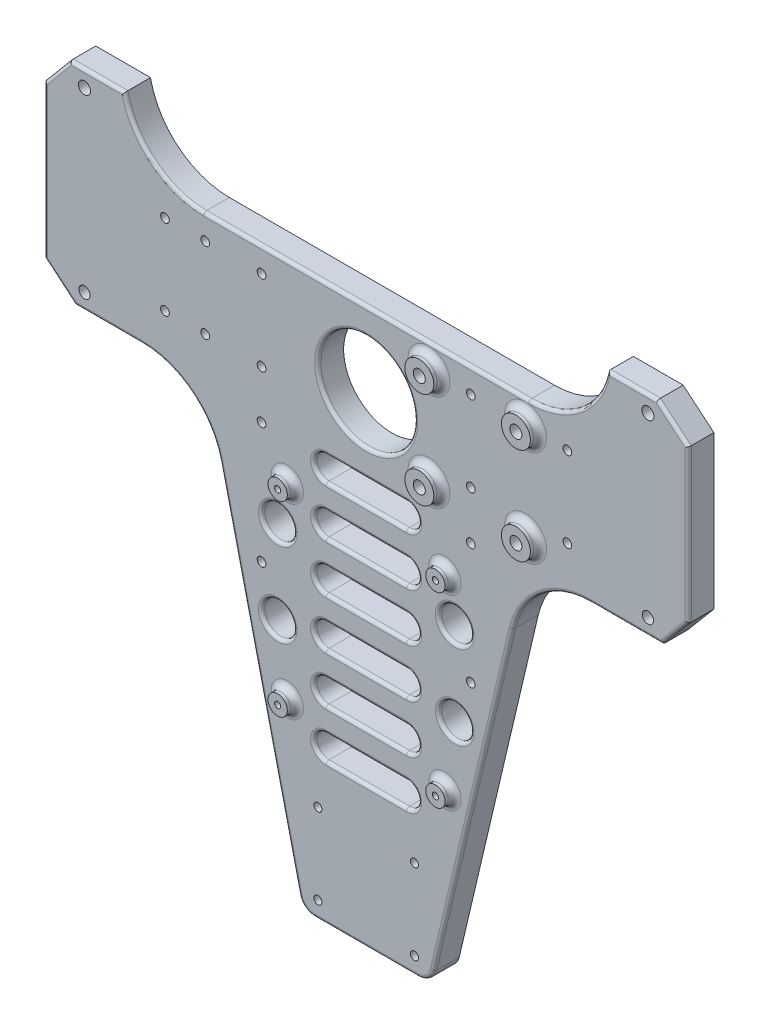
ISO-10303-21;
HEADER;
FILE_DESCRIPTION(('STEP AP214'),'2;1');
FILE_NAME('part.step','',(''),(''),'','','');
FILE_SCHEMA(('AUTOMOTIVE_DESIGN { 1 0 10303 214 1 1 1 1 }'));
ENDSEC;
DATA;
#1=APPLICATION_CONTEXT('core data for automotive mechanical design processes');
#2=APPLICATION_PROTOCOL_DEFINITION('international standard','automotive_design',2000,#1);
#3=PRODUCT_CONTEXT('',#1,'mechanical');
#4=PRODUCT('Part','Part','',(#3));
#5=PRODUCT_RELATED_PRODUCT_CATEGORY('part','',(#4));
#6=PRODUCT_DEFINITION_FORMATION('','',#4);
#7=PRODUCT_DEFINITION_CONTEXT('part definition',#1,'design');
#8=PRODUCT_DEFINITION('design','',#6,#7);
#9=PRODUCT_DEFINITION_SHAPE('','',#8);
#10=(LENGTH_UNIT() NAMED_UNIT(*) SI_UNIT(.MILLI.,.METRE.));
#11=(NAMED_UNIT(*) PLANE_ANGLE_UNIT() SI_UNIT($,.RADIAN.));
#12=(NAMED_UNIT(*) SI_UNIT($,.STERADIAN.) SOLID_ANGLE_UNIT());
#13=UNCERTAINTY_MEASURE_WITH_UNIT(LENGTH_MEASURE(1.E-05),#10,'distance_accuracy_value','');
#14=(GEOMETRIC_REPRESENTATION_CONTEXT(3) GLOBAL_UNCERTAINTY_ASSIGNED_CONTEXT((#13)) GLOBAL_UNIT_ASSIGNED_CONTEXT((#10,
#11,#12)) REPRESENTATION_CONTEXT('',''));
#15=CARTESIAN_POINT('',(0.,0.,0.));
#16=DIRECTION('',(0.,0.,1.));
#17=DIRECTION('',(1.,0.,0.));
#18=AXIS2_PLACEMENT_3D('',#15,#16,#17);
#19=CARTESIAN_POINT('',(12.5,-108.75,0.));
#20=DIRECTION('',(0.,1.,0.));
#21=DIRECTION('',(0.,0.,1.));
#22=AXIS2_PLACEMENT_3D('',#19,#20,#21);
#23=PLANE('',#22);
#24=DIRECTION('',(0.,0.,1.));
#25=VECTOR('',#24,1.);
#26=CARTESIAN_POINT('',(12.5,-108.75,0.));
#27=LINE('',#26,#25);
#28=CARTESIAN_POINT('',(12.5,-108.75,0.));
#29=VERTEX_POINT('',#28);
#30=CARTESIAN_POINT('',(12.5,-108.75,7.));
#31=VERTEX_POINT('',#30);
#32=EDGE_CURVE('E871',#29,#31,#27,.T.);
#33=ORIENTED_EDGE('',*,*,#32,.T.);
#34=DIRECTION('',(-1.,0.,0.));
#35=VECTOR('',#34,1.);
#36=CARTESIAN_POINT('',(-12.5,-108.75,7.));
#37=LINE('',#36,#35);
#38=CARTESIAN_POINT('',(-12.5,-108.75,7.));
#39=VERTEX_POINT('',#38);
#40=EDGE_CURVE('E1207',#31,#39,#37,.T.);
#41=ORIENTED_EDGE('',*,*,#40,.T.);
#42=DIRECTION('',(0.,0.,1.));
#43=VECTOR('',#42,1.);
#44=CARTESIAN_POINT('',(-12.5,-108.75,0.));
#45=LINE('',#44,#43);
#46=CARTESIAN_POINT('',(-12.5,-108.75,0.));
#47=VERTEX_POINT('',#46);
#48=EDGE_CURVE('E883',#47,#39,#45,.T.);
#49=ORIENTED_EDGE('',*,*,#48,.F.);
#50=DIRECTION('',(-1.,0.,0.));
#51=VECTOR('',#50,1.);
#52=CARTESIAN_POINT('',(12.5,-108.75,0.));
#53=LINE('',#52,#51);
#54=EDGE_CURVE('E861',#29,#47,#53,.T.);
#55=ORIENTED_EDGE('',*,*,#54,.F.);
#56=EDGE_LOOP('',(#33,#41,#49,#55));
#57=FACE_BOUND('',#56,.T.);
#58=ADVANCED_FACE('F40',(#57),#23,.F.);
#59=CARTESIAN_POINT('',(-12.5,-112.5,0.));
#60=DIRECTION('',(0.,0.,1.));
#61=DIRECTION('',(1.,0.,0.));
#62=AXIS2_PLACEMENT_3D('',#59,#60,#61);
#63=CYLINDRICAL_SURFACE('',#62,3.75);
#64=ORIENTED_EDGE('',*,*,#48,.T.);
#65=CARTESIAN_POINT('',(-12.5,-112.5,7.));
#66=DIRECTION('',(0.,0.,1.));
#67=DIRECTION('',(1.,0.,0.));
#68=AXIS2_PLACEMENT_3D('',#65,#66,#67);
#69=CIRCLE('',#68,3.75);
#70=CARTESIAN_POINT('',(-12.5,-116.25,7.));
#71=VERTEX_POINT('',#70);
#72=EDGE_CURVE('E1096',#39,#71,#69,.T.);
#73=ORIENTED_EDGE('',*,*,#72,.T.);
#74=DIRECTION('',(0.,0.,1.));
#75=VECTOR('',#74,1.);
#76=CARTESIAN_POINT('',(-12.5,-116.25,0.));
#77=LINE('',#76,#75);
#78=CARTESIAN_POINT('',(-12.5,-116.25,0.));
#79=VERTEX_POINT('',#78);
#80=EDGE_CURVE('E879',#79,#71,#77,.T.);
#81=ORIENTED_EDGE('',*,*,#80,.F.);
#82=CARTESIAN_POINT('',(-12.5,-112.5,0.));
#83=DIRECTION('',(0.,0.,1.));
#84=DIRECTION('',(1.,0.,0.));
#85=AXIS2_PLACEMENT_3D('',#82,#83,#84);
#86=CIRCLE('',#85,3.75);
#87=EDGE_CURVE('E864',#47,#79,#86,.T.);
#88=ORIENTED_EDGE('',*,*,#87,.F.);
#89=EDGE_LOOP('',(#64,#73,#81,#88));
#90=FACE_BOUND('',#89,.T.);
#91=ADVANCED_FACE('F1504',(#90),#63,.F.);
#92=CARTESIAN_POINT('',(12.5,-116.25,0.));
#93=DIRECTION('',(0.,-1.,0.));
#94=DIRECTION('',(0.,0.,-1.));
#95=AXIS2_PLACEMENT_3D('',#92,#93,#94);
#96=PLANE('',#95);
#97=ORIENTED_EDGE('',*,*,#80,.T.);
#98=DIRECTION('',(1.,0.,0.));
#99=VECTOR('',#98,1.);
#100=CARTESIAN_POINT('',(12.5,-116.25,7.));
#101=LINE('',#100,#99);
#102=CARTESIAN_POINT('',(12.5,-116.25,7.));
#103=VERTEX_POINT('',#102);
#104=EDGE_CURVE('E1093',#71,#103,#101,.T.);
#105=ORIENTED_EDGE('',*,*,#104,.T.);
#106=DIRECTION('',(0.,0.,1.));
#107=VECTOR('',#106,1.);
#108=CARTESIAN_POINT('',(12.5,-116.25,0.));
#109=LINE('',#108,#107);
#110=CARTESIAN_POINT('',(12.5,-116.25,0.));
#111=VERTEX_POINT('',#110);
#112=EDGE_CURVE('E875',#111,#103,#109,.T.);
#113=ORIENTED_EDGE('',*,*,#112,.F.);
#114=DIRECTION('',(1.,0.,0.));
#115=VECTOR('',#114,1.);
#116=CARTESIAN_POINT('',(12.5,-116.25,0.));
#117=LINE('',#116,#115);
#118=EDGE_CURVE('E867',#79,#111,#117,.T.);
#119=ORIENTED_EDGE('',*,*,#118,.F.);
#120=EDGE_LOOP('',(#97,#105,#113,#119));
#121=FACE_BOUND('',#120,.T.);
#122=ADVANCED_FACE('F1510',(#121),#96,.F.);
#123=CARTESIAN_POINT('',(12.5,-112.5,0.));
#124=DIRECTION('',(0.,0.,1.));
#125=DIRECTION('',(1.,0.,0.));
#126=AXIS2_PLACEMENT_3D('',#123,#124,#125);
#127=CYLINDRICAL_SURFACE('',#126,3.75);
#128=ORIENTED_EDGE('',*,*,#112,.T.);
#129=CARTESIAN_POINT('',(12.5,-112.5,7.));
#130=DIRECTION('',(0.,0.,1.));
#131=DIRECTION('',(1.,0.,0.));
#132=AXIS2_PLACEMENT_3D('',#129,#130,#131);
#133=CIRCLE('',#132,3.75);
#134=EDGE_CURVE('E1089',#103,#31,#133,.T.);
#135=ORIENTED_EDGE('',*,*,#134,.T.);
#136=ORIENTED_EDGE('',*,*,#32,.F.);
#137=CARTESIAN_POINT('',(12.5,-112.5,0.));
#138=DIRECTION('',(0.,0.,1.));
#139=DIRECTION('',(1.,0.,0.));
#140=AXIS2_PLACEMENT_3D('',#137,#138,#139);
#141=CIRCLE('',#140,3.75);
#142=EDGE_CURVE('E858',#111,#29,#141,.T.);
#143=ORIENTED_EDGE('',*,*,#142,.F.);
#144=EDGE_LOOP('',(#128,#135,#136,#143));
#145=FACE_BOUND('',#144,.T.);
#146=ADVANCED_FACE('F1885',(#145),#127,.F.);
#147=CARTESIAN_POINT('',(12.5,-93.75,0.));
#148=DIRECTION('',(0.,1.,0.));
#149=DIRECTION('',(0.,0.,1.));
#150=AXIS2_PLACEMENT_3D('',#147,#148,#149);
#151=PLANE('',#150);
#152=DIRECTION('',(0.,0.,1.));
#153=VECTOR('',#152,1.);
#154=CARTESIAN_POINT('',(12.5,-93.75,0.));
#155=LINE('',#154,#153);
#156=CARTESIAN_POINT('',(12.5,-93.75,0.));
#157=VERTEX_POINT('',#156);
#158=CARTESIAN_POINT('',(12.5,-93.75,7.));
#159=VERTEX_POINT('',#158);
#160=EDGE_CURVE('E842',#157,#159,#155,.T.);
#161=ORIENTED_EDGE('',*,*,#160,.T.);
#162=DIRECTION('',(-1.,0.,0.));
#163=VECTOR('',#162,1.);
#164=CARTESIAN_POINT('',(-12.5,-93.75,7.));
#165=LINE('',#164,#163);
#166=CARTESIAN_POINT('',(-12.5,-93.75,7.));
#167=VERTEX_POINT('',#166);
#168=EDGE_CURVE('E1204',#159,#167,#165,.T.);
#169=ORIENTED_EDGE('',*,*,#168,.T.);
#170=DIRECTION('',(0.,0.,1.));
#171=VECTOR('',#170,1.);
#172=CARTESIAN_POINT('',(-12.5,-93.75,0.));
#173=LINE('',#172,#171);
#174=CARTESIAN_POINT('',(-12.5,-93.75,0.));
#175=VERTEX_POINT('',#174);
#176=EDGE_CURVE('E854',#175,#167,#173,.T.);
#177=ORIENTED_EDGE('',*,*,#176,.F.);
#178=DIRECTION('',(-1.,0.,0.));
#179=VECTOR('',#178,1.);
#180=CARTESIAN_POINT('',(12.5,-93.75,0.));
#181=LINE('',#180,#179);
#182=EDGE_CURVE('E832',#157,#175,#181,.T.);
#183=ORIENTED_EDGE('',*,*,#182,.F.);
#184=EDGE_LOOP('',(#161,#169,#177,#183));
#185=FACE_BOUND('',#184,.T.);
#186=ADVANCED_FACE('F1881',(#185),#151,.F.);
#187=CARTESIAN_POINT('',(-12.5,-97.5,0.));
#188=DIRECTION('',(0.,0.,1.));
#189=DIRECTION('',(1.,0.,0.));
#190=AXIS2_PLACEMENT_3D('',#187,#188,#189);
#191=CYLINDRICAL_SURFACE('',#190,3.75);
#192=ORIENTED_EDGE('',*,*,#176,.T.);
#193=CARTESIAN_POINT('',(-12.5,-97.5,7.));
#194=DIRECTION('',(0.,0.,1.));
#195=DIRECTION('',(1.,0.,0.));
#196=AXIS2_PLACEMENT_3D('',#193,#194,#195);
#197=CIRCLE('',#196,3.75);
#198=CARTESIAN_POINT('',(-12.5,-101.25,7.));
#199=VERTEX_POINT('',#198);
#200=EDGE_CURVE('E1086',#167,#199,#197,.T.);
#201=ORIENTED_EDGE('',*,*,#200,.T.);
#202=DIRECTION('',(0.,0.,1.));
#203=VECTOR('',#202,1.);
#204=CARTESIAN_POINT('',(-12.5,-101.25,0.));
#205=LINE('',#204,#203);
#206=CARTESIAN_POINT('',(-12.5,-101.25,0.));
#207=VERTEX_POINT('',#206);
#208=EDGE_CURVE('E850',#207,#199,#205,.T.);
#209=ORIENTED_EDGE('',*,*,#208,.F.);
#210=CARTESIAN_POINT('',(-12.5,-97.5,0.));
#211=DIRECTION('',(0.,0.,1.));
#212=DIRECTION('',(1.,0.,0.));
#213=AXIS2_PLACEMENT_3D('',#210,#211,#212);
#214=CIRCLE('',#213,3.75);
#215=EDGE_CURVE('E835',#175,#207,#214,.T.);
#216=ORIENTED_EDGE('',*,*,#215,.F.);
#217=EDGE_LOOP('',(#192,#201,#209,#216));
#218=FACE_BOUND('',#217,.T.);
#219=ADVANCED_FACE('F1877',(#218),#191,.F.);
#220=CARTESIAN_POINT('',(12.5,-101.25,0.));
#221=DIRECTION('',(0.,-1.,0.));
#222=DIRECTION('',(0.,0.,-1.));
#223=AXIS2_PLACEMENT_3D('',#220,#221,#222);
#224=PLANE('',#223);
#225=ORIENTED_EDGE('',*,*,#208,.T.);
#226=DIRECTION('',(1.,0.,0.));
#227=VECTOR('',#226,1.);
#228=CARTESIAN_POINT('',(12.5,-101.25,7.));
#229=LINE('',#228,#227);
#230=CARTESIAN_POINT('',(12.5,-101.25,7.));
#231=VERTEX_POINT('',#230);
#232=EDGE_CURVE('E1083',#199,#231,#229,.T.);
#233=ORIENTED_EDGE('',*,*,#232,.T.);
#234=DIRECTION('',(0.,0.,1.));
#235=VECTOR('',#234,1.);
#236=CARTESIAN_POINT('',(12.5,-101.25,0.));
#237=LINE('',#236,#235);
#238=CARTESIAN_POINT('',(12.5,-101.25,0.));
#239=VERTEX_POINT('',#238);
#240=EDGE_CURVE('E846',#239,#231,#237,.T.);
#241=ORIENTED_EDGE('',*,*,#240,.F.);
#242=DIRECTION('',(1.,0.,0.));
#243=VECTOR('',#242,1.);
#244=CARTESIAN_POINT('',(12.5,-101.25,0.));
#245=LINE('',#244,#243);
#246=EDGE_CURVE('E838',#207,#239,#245,.T.);
#247=ORIENTED_EDGE('',*,*,#246,.F.);
#248=EDGE_LOOP('',(#225,#233,#241,#247));
#249=FACE_BOUND('',#248,.T.);
#250=ADVANCED_FACE('F1873',(#249),#224,.F.);
#251=CARTESIAN_POINT('',(12.5,-97.5,0.));
#252=DIRECTION('',(0.,0.,1.));
#253=DIRECTION('',(1.,0.,0.));
#254=AXIS2_PLACEMENT_3D('',#251,#252,#253);
#255=CYLINDRICAL_SURFACE('',#254,3.75);
#256=ORIENTED_EDGE('',*,*,#240,.T.);
#257=CARTESIAN_POINT('',(12.5,-97.5,7.));
#258=DIRECTION('',(0.,0.,1.));
#259=DIRECTION('',(1.,0.,0.));
#260=AXIS2_PLACEMENT_3D('',#257,#258,#259);
#261=CIRCLE('',#260,3.75);
#262=EDGE_CURVE('E1079',#231,#159,#261,.T.);
#263=ORIENTED_EDGE('',*,*,#262,.T.);
#264=ORIENTED_EDGE('',*,*,#160,.F.);
#265=CARTESIAN_POINT('',(12.5,-97.5,0.));
#266=DIRECTION('',(0.,0.,1.));
#267=DIRECTION('',(1.,0.,0.));
#268=AXIS2_PLACEMENT_3D('',#265,#266,#267);
#269=CIRCLE('',#268,3.75);
#270=EDGE_CURVE('E829',#239,#157,#269,.T.);
#271=ORIENTED_EDGE('',*,*,#270,.F.);
#272=EDGE_LOOP('',(#256,#263,#264,#271));
#273=FACE_BOUND('',#272,.T.);
#274=ADVANCED_FACE('F1869',(#273),#255,.F.);
#275=CARTESIAN_POINT('',(12.5,-78.75,0.));
#276=DIRECTION('',(0.,1.,0.));
#277=DIRECTION('',(0.,0.,1.));
#278=AXIS2_PLACEMENT_3D('',#275,#276,#277);
#279=PLANE('',#278);
#280=DIRECTION('',(0.,0.,1.));
#281=VECTOR('',#280,1.);
#282=CARTESIAN_POINT('',(12.5,-78.75,0.));
#283=LINE('',#282,#281);
#284=CARTESIAN_POINT('',(12.5,-78.75,0.));
#285=VERTEX_POINT('',#284);
#286=CARTESIAN_POINT('',(12.5,-78.75,7.));
#287=VERTEX_POINT('',#286);
#288=EDGE_CURVE('E813',#285,#287,#283,.T.);
#289=ORIENTED_EDGE('',*,*,#288,.T.);
#290=DIRECTION('',(-1.,0.,0.));
#291=VECTOR('',#290,1.);
#292=CARTESIAN_POINT('',(-12.5,-78.75,7.));
#293=LINE('',#292,#291);
#294=CARTESIAN_POINT('',(-12.5,-78.75,7.));
#295=VERTEX_POINT('',#294);
#296=EDGE_CURVE('E1201',#287,#295,#293,.T.);
#297=ORIENTED_EDGE('',*,*,#296,.T.);
#298=DIRECTION('',(0.,0.,1.));
#299=VECTOR('',#298,1.);
#300=CARTESIAN_POINT('',(-12.5,-78.75,0.));
#301=LINE('',#300,#299);
#302=CARTESIAN_POINT('',(-12.5,-78.75,0.));
#303=VERTEX_POINT('',#302);
#304=EDGE_CURVE('E825',#303,#295,#301,.T.);
#305=ORIENTED_EDGE('',*,*,#304,.F.);
#306=DIRECTION('',(-1.,0.,0.));
#307=VECTOR('',#306,1.);
#308=CARTESIAN_POINT('',(12.5,-78.75,0.));
#309=LINE('',#308,#307);
#310=EDGE_CURVE('E803',#285,#303,#309,.T.);
#311=ORIENTED_EDGE('',*,*,#310,.F.);
#312=EDGE_LOOP('',(#289,#297,#305,#311));
#313=FACE_BOUND('',#312,.T.);
#314=ADVANCED_FACE('F1865',(#313),#279,.F.);
#315=CARTESIAN_POINT('',(-12.5,-82.5,0.));
#316=DIRECTION('',(0.,0.,1.));
#317=DIRECTION('',(1.,0.,0.));
#318=AXIS2_PLACEMENT_3D('',#315,#316,#317);
#319=CYLINDRICAL_SURFACE('',#318,3.75);
#320=ORIENTED_EDGE('',*,*,#304,.T.);
#321=CARTESIAN_POINT('',(-12.5,-82.5,7.));
#322=DIRECTION('',(0.,0.,1.));
#323=DIRECTION('',(1.,0.,0.));
#324=AXIS2_PLACEMENT_3D('',#321,#322,#323);
#325=CIRCLE('',#324,3.75);
#326=CARTESIAN_POINT('',(-12.5,-86.25,7.));
#327=VERTEX_POINT('',#326);
#328=EDGE_CURVE('E1076',#295,#327,#325,.T.);
#329=ORIENTED_EDGE('',*,*,#328,.T.);
#330=DIRECTION('',(0.,0.,1.));
#331=VECTOR('',#330,1.);
#332=CARTESIAN_POINT('',(-12.5,-86.25,0.));
#333=LINE('',#332,#331);
#334=CARTESIAN_POINT('',(-12.5,-86.25,0.));
#335=VERTEX_POINT('',#334);
#336=EDGE_CURVE('E821',#335,#327,#333,.T.);
#337=ORIENTED_EDGE('',*,*,#336,.F.);
#338=CARTESIAN_POINT('',(-12.5,-82.5,0.));
#339=DIRECTION('',(0.,0.,1.));
#340=DIRECTION('',(1.,0.,0.));
#341=AXIS2_PLACEMENT_3D('',#338,#339,#340);
#342=CIRCLE('',#341,3.75);
#343=EDGE_CURVE('E806',#303,#335,#342,.T.);
#344=ORIENTED_EDGE('',*,*,#343,.F.);
#345=EDGE_LOOP('',(#320,#329,#337,#344));
#346=FACE_BOUND('',#345,.T.);
#347=ADVANCED_FACE('F1861',(#346),#319,.F.);
#348=CARTESIAN_POINT('',(12.5,-86.25,0.));
#349=DIRECTION('',(0.,-1.,0.));
#350=DIRECTION('',(0.,0.,-1.));
#351=AXIS2_PLACEMENT_3D('',#348,#349,#350);
#352=PLANE('',#351);
#353=ORIENTED_EDGE('',*,*,#336,.T.);
#354=DIRECTION('',(1.,0.,0.));
#355=VECTOR('',#354,1.);
#356=CARTESIAN_POINT('',(12.5,-86.25,7.));
#357=LINE('',#356,#355);
#358=CARTESIAN_POINT('',(12.5,-86.25,7.));
#359=VERTEX_POINT('',#358);
#360=EDGE_CURVE('E1073',#327,#359,#357,.T.);
#361=ORIENTED_EDGE('',*,*,#360,.T.);
#362=DIRECTION('',(0.,0.,1.));
#363=VECTOR('',#362,1.);
#364=CARTESIAN_POINT('',(12.5,-86.25,0.));
#365=LINE('',#364,#363);
#366=CARTESIAN_POINT('',(12.5,-86.25,0.));
#367=VERTEX_POINT('',#366);
#368=EDGE_CURVE('E817',#367,#359,#365,.T.);
#369=ORIENTED_EDGE('',*,*,#368,.F.);
#370=DIRECTION('',(1.,0.,0.));
#371=VECTOR('',#370,1.);
#372=CARTESIAN_POINT('',(12.5,-86.25,0.));
#373=LINE('',#372,#371);
#374=EDGE_CURVE('E809',#335,#367,#373,.T.);
#375=ORIENTED_EDGE('',*,*,#374,.F.);
#376=EDGE_LOOP('',(#353,#361,#369,#375));
#377=FACE_BOUND('',#376,.T.);
#378=ADVANCED_FACE('F1857',(#377),#352,.F.);
#379=CARTESIAN_POINT('',(12.5,-82.5,0.));
#380=DIRECTION('',(0.,0.,1.));
#381=DIRECTION('',(1.,0.,0.));
#382=AXIS2_PLACEMENT_3D('',#379,#380,#381);
#383=CYLINDRICAL_SURFACE('',#382,3.75);
#384=ORIENTED_EDGE('',*,*,#368,.T.);
#385=CARTESIAN_POINT('',(12.5,-82.5,7.));
#386=DIRECTION('',(0.,0.,1.));
#387=DIRECTION('',(1.,0.,0.));
#388=AXIS2_PLACEMENT_3D('',#385,#386,#387);
#389=CIRCLE('',#388,3.75);
#390=EDGE_CURVE('E907',#359,#287,#389,.T.);
#391=ORIENTED_EDGE('',*,*,#390,.T.);
#392=ORIENTED_EDGE('',*,*,#288,.F.);
#393=CARTESIAN_POINT('',(12.5,-82.5,0.));
#394=DIRECTION('',(0.,0.,1.));
#395=DIRECTION('',(1.,0.,0.));
#396=AXIS2_PLACEMENT_3D('',#393,#394,#395);
#397=CIRCLE('',#396,3.75);
#398=EDGE_CURVE('E800',#367,#285,#397,.T.);
#399=ORIENTED_EDGE('',*,*,#398,.F.);
#400=EDGE_LOOP('',(#384,#391,#392,#399));
#401=FACE_BOUND('',#400,.T.);
#402=ADVANCED_FACE('F1853',(#401),#383,.F.);
#403=CARTESIAN_POINT('',(12.5,-63.75,0.));
#404=DIRECTION('',(0.,1.,0.));
#405=DIRECTION('',(0.,0.,1.));
#406=AXIS2_PLACEMENT_3D('',#403,#404,#405);
#407=PLANE('',#406);
#408=DIRECTION('',(0.,0.,1.));
#409=VECTOR('',#408,1.);
#410=CARTESIAN_POINT('',(12.5,-63.75,0.));
#411=LINE('',#410,#409);
#412=CARTESIAN_POINT('',(12.5,-63.75,0.));
#413=VERTEX_POINT('',#412);
#414=CARTESIAN_POINT('',(12.5,-63.75,7.));
#415=VERTEX_POINT('',#414);
#416=EDGE_CURVE('E784',#413,#415,#411,.T.);
#417=ORIENTED_EDGE('',*,*,#416,.T.);
#418=DIRECTION('',(-1.,0.,0.));
#419=VECTOR('',#418,1.);
#420=CARTESIAN_POINT('',(-12.5,-63.75,7.));
#421=LINE('',#420,#419);
#422=CARTESIAN_POINT('',(-12.5,-63.75,7.));
#423=VERTEX_POINT('',#422);
#424=EDGE_CURVE('E1099',#415,#423,#421,.T.);
#425=ORIENTED_EDGE('',*,*,#424,.T.);
#426=DIRECTION('',(0.,0.,1.));
#427=VECTOR('',#426,1.);
#428=CARTESIAN_POINT('',(-12.5,-63.75,0.));
#429=LINE('',#428,#427);
#430=CARTESIAN_POINT('',(-12.5,-63.75,0.));
#431=VERTEX_POINT('',#430);
#432=EDGE_CURVE('E796',#431,#423,#429,.T.);
#433=ORIENTED_EDGE('',*,*,#432,.F.);
#434=DIRECTION('',(-1.,0.,0.));
#435=VECTOR('',#434,1.);
#436=CARTESIAN_POINT('',(12.5,-63.75,0.));
#437=LINE('',#436,#435);
#438=EDGE_CURVE('E774',#413,#431,#437,.T.);
#439=ORIENTED_EDGE('',*,*,#438,.F.);
#440=EDGE_LOOP('',(#417,#425,#433,#439));
#441=FACE_BOUND('',#440,.T.);
#442=ADVANCED_FACE('F1849',(#441),#407,.F.);
#443=CARTESIAN_POINT('',(-12.5,-67.5,0.));
#444=DIRECTION('',(0.,0.,1.));
#445=DIRECTION('',(1.,0.,0.));
#446=AXIS2_PLACEMENT_3D('',#443,#444,#445);
#447=CYLINDRICAL_SURFACE('',#446,3.75);
#448=ORIENTED_EDGE('',*,*,#432,.T.);
#449=CARTESIAN_POINT('',(-12.5,-67.5,7.));
#450=DIRECTION('',(0.,0.,1.));
#451=DIRECTION('',(1.,0.,0.));
#452=AXIS2_PLACEMENT_3D('',#449,#450,#451);
#453=CIRCLE('',#452,3.75);
#454=CARTESIAN_POINT('',(-12.5,-71.25,7.));
#455=VERTEX_POINT('',#454);
#456=EDGE_CURVE('E1103',#423,#455,#453,.T.);
#457=ORIENTED_EDGE('',*,*,#456,.T.);
#458=DIRECTION('',(0.,0.,1.));
#459=VECTOR('',#458,1.);
#460=CARTESIAN_POINT('',(-12.5,-71.25,0.));
#461=LINE('',#460,#459);
#462=CARTESIAN_POINT('',(-12.5,-71.25,0.));
#463=VERTEX_POINT('',#462);
#464=EDGE_CURVE('E792',#463,#455,#461,.T.);
#465=ORIENTED_EDGE('',*,*,#464,.F.);
#466=CARTESIAN_POINT('',(-12.5,-67.5,0.));
#467=DIRECTION('',(0.,0.,1.));
#468=DIRECTION('',(1.,0.,0.));
#469=AXIS2_PLACEMENT_3D('',#466,#467,#468);
#470=CIRCLE('',#469,3.75);
#471=EDGE_CURVE('E777',#431,#463,#470,.T.);
#472=ORIENTED_EDGE('',*,*,#471,.F.);
#473=EDGE_LOOP('',(#448,#457,#465,#472));
#474=FACE_BOUND('',#473,.T.);
#475=ADVANCED_FACE('F1845',(#474),#447,.F.);
#476=CARTESIAN_POINT('',(12.5,-71.25,0.));
#477=DIRECTION('',(0.,-1.,0.));
#478=DIRECTION('',(0.,0.,-1.));
#479=AXIS2_PLACEMENT_3D('',#476,#477,#478);
#480=PLANE('',#479);
#481=ORIENTED_EDGE('',*,*,#464,.T.);
#482=DIRECTION('',(1.,0.,0.));
#483=VECTOR('',#482,1.);
#484=CARTESIAN_POINT('',(12.5,-71.25,7.));
#485=LINE('',#484,#483);
#486=CARTESIAN_POINT('',(12.5,-71.25,7.));
#487=VERTEX_POINT('',#486);
#488=EDGE_CURVE('E1106',#455,#487,#485,.T.);
#489=ORIENTED_EDGE('',*,*,#488,.T.);
#490=DIRECTION('',(0.,0.,1.));
#491=VECTOR('',#490,1.);
#492=CARTESIAN_POINT('',(12.5,-71.25,0.));
#493=LINE('',#492,#491);
#494=CARTESIAN_POINT('',(12.5,-71.25,0.));
#495=VERTEX_POINT('',#494);
#496=EDGE_CURVE('E788',#495,#487,#493,.T.);
#497=ORIENTED_EDGE('',*,*,#496,.F.);
#498=DIRECTION('',(1.,0.,0.));
#499=VECTOR('',#498,1.);
#500=CARTESIAN_POINT('',(12.5,-71.25,0.));
#501=LINE('',#500,#499);
#502=EDGE_CURVE('E780',#463,#495,#501,.T.);
#503=ORIENTED_EDGE('',*,*,#502,.F.);
#504=EDGE_LOOP('',(#481,#489,#497,#503));
#505=FACE_BOUND('',#504,.T.);
#506=ADVANCED_FACE('F1841',(#505),#480,.F.);
#507=CARTESIAN_POINT('',(12.5,-67.5,0.));
#508=DIRECTION('',(0.,0.,1.));
#509=DIRECTION('',(1.,0.,0.));
#510=AXIS2_PLACEMENT_3D('',#507,#508,#509);
#511=CYLINDRICAL_SURFACE('',#510,3.75);
#512=ORIENTED_EDGE('',*,*,#496,.T.);
#513=CARTESIAN_POINT('',(12.5,-67.5,7.));
#514=DIRECTION('',(0.,0.,1.));
#515=DIRECTION('',(1.,0.,0.));
#516=AXIS2_PLACEMENT_3D('',#513,#514,#515);
#517=CIRCLE('',#516,3.75);
#518=EDGE_CURVE('E1109',#487,#415,#517,.T.);
#519=ORIENTED_EDGE('',*,*,#518,.T.);
#520=ORIENTED_EDGE('',*,*,#416,.F.);
#521=CARTESIAN_POINT('',(12.5,-67.5,0.));
#522=DIRECTION('',(0.,0.,1.));
#523=DIRECTION('',(1.,0.,0.));
#524=AXIS2_PLACEMENT_3D('',#521,#522,#523);
#525=CIRCLE('',#524,3.75);
#526=EDGE_CURVE('E771',#495,#413,#525,.T.);
#527=ORIENTED_EDGE('',*,*,#526,.F.);
#528=EDGE_LOOP('',(#512,#519,#520,#527));
#529=FACE_BOUND('',#528,.T.);
#530=ADVANCED_FACE('F1838',(#529),#511,.F.);
#531=CARTESIAN_POINT('',(-54.6229508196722,-12.8524590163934,8.));
#532=DIRECTION('',(0.973417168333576,0.229039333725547,0.));
#533=DIRECTION('',(-0.229039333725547,0.973417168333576,0.));
#534=AXIS2_PLACEMENT_3D('',#531,#532,#533);
#535=PLANE('',#534);
#536=DIRECTION('',(0.,0.,-1.));
#537=VECTOR('',#536,1.);
#538=CARTESIAN_POINT('',(-20.9070125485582,-156.145196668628,8.));
#539=LINE('',#538,#537);
#540=CARTESIAN_POINT('',(-20.9070125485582,-156.145196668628,0.));
#541=VERTEX_POINT('',#540);
#542=CARTESIAN_POINT('',(-20.9070125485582,-156.145196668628,7.));
#543=VERTEX_POINT('',#542);
#544=EDGE_CURVE('E903',#541,#543,#539,.F.);
#545=ORIENTED_EDGE('',*,*,#544,.T.);
#546=DIRECTION('',(0.229039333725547,-0.973417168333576,0.));
#547=VECTOR('',#546,1.);
#548=CARTESIAN_POINT('',(-45.4649372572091,-51.7740166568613,7.));
#549=LINE('',#548,#547);
#550=CARTESIAN_POINT('',(-45.4649372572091,-51.7740166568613,7.));
#551=VERTEX_POINT('',#550);
#552=EDGE_CURVE('E1144',#543,#551,#549,.F.);
#553=ORIENTED_EDGE('',*,*,#552,.T.);
#554=DIRECTION('',(0.,0.,-1.));
#555=VECTOR('',#554,1.);
#556=CARTESIAN_POINT('',(-45.4649372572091,-51.7740166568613,8.));
#557=LINE('',#556,#555);
#558=CARTESIAN_POINT('',(-45.4649372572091,-51.7740166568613,0.));
#559=VERTEX_POINT('',#558);
#560=EDGE_CURVE('E710',#551,#559,#557,.T.);
#561=ORIENTED_EDGE('',*,*,#560,.T.);
#562=DIRECTION('',(0.229039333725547,-0.973417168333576,0.));
#563=VECTOR('',#562,1.);
#564=CARTESIAN_POINT('',(-54.6229508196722,-12.8524590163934,0.));
#565=LINE('',#564,#563);
#566=EDGE_CURVE('E646',#559,#541,#565,.T.);
#567=ORIENTED_EDGE('',*,*,#566,.T.);
#568=EDGE_LOOP('',(#545,#553,#561,#567));
#569=FACE_BOUND('',#568,.T.);
#570=ADVANCED_FACE('F1786',(#569),#535,.F.);
#571=CARTESIAN_POINT('',(0.,-160.,8.));
#572=DIRECTION('',(0.,1.,0.));
#573=DIRECTION('',(0.,0.,1.));
#574=AXIS2_PLACEMENT_3D('',#571,#572,#573);
#575=PLANE('',#574);
#576=DIRECTION('',(0.,0.,-1.));
#577=VECTOR('',#576,1.);
#578=CARTESIAN_POINT('',(16.0399267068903,-160.,8.));
#579=LINE('',#578,#577);
#580=CARTESIAN_POINT('',(16.0399267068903,-160.,0.));
#581=VERTEX_POINT('',#580);
#582=CARTESIAN_POINT('',(16.0399267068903,-160.,7.));
#583=VERTEX_POINT('',#582);
#584=EDGE_CURVE('E899',#581,#583,#579,.F.);
#585=ORIENTED_EDGE('',*,*,#584,.T.);
#586=DIRECTION('',(1.,0.,0.));
#587=VECTOR('',#586,1.);
#588=CARTESIAN_POINT('',(-16.0399267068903,-160.,7.));
#589=LINE('',#588,#587);
#590=CARTESIAN_POINT('',(-16.0399267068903,-160.,7.));
#591=VERTEX_POINT('',#590);
#592=EDGE_CURVE('E1198',#583,#591,#589,.F.);
#593=ORIENTED_EDGE('',*,*,#592,.T.);
#594=DIRECTION('',(0.,0.,-1.));
#595=VECTOR('',#594,1.);
#596=CARTESIAN_POINT('',(-16.0399267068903,-160.,8.));
#597=LINE('',#596,#595);
#598=CARTESIAN_POINT('',(-16.0399267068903,-160.,0.));
#599=VERTEX_POINT('',#598);
#600=EDGE_CURVE('E896',#591,#599,#597,.T.);
#601=ORIENTED_EDGE('',*,*,#600,.T.);
#602=DIRECTION('',(1.,0.,0.));
#603=VECTOR('',#602,1.);
#604=CARTESIAN_POINT('',(0.,-160.,0.));
#605=LINE('',#604,#603);
#606=EDGE_CURVE('E661',#599,#581,#605,.T.);
#607=ORIENTED_EDGE('',*,*,#606,.T.);
#608=EDGE_LOOP('',(#585,#593,#601,#607));
#609=FACE_BOUND('',#608,.T.);
#610=ADVANCED_FACE('F1780',(#609),#575,.F.);
#611=CARTESIAN_POINT('',(54.6229508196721,-12.8524590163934,8.));
#612=DIRECTION('',(-0.973417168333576,0.229039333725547,0.));
#613=DIRECTION('',(-0.229039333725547,-0.973417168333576,0.));
#614=AXIS2_PLACEMENT_3D('',#611,#612,#613);
#615=PLANE('',#614);
#616=DIRECTION('',(0.,0.,-1.));
#617=VECTOR('',#616,1.);
#618=CARTESIAN_POINT('',(45.4649372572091,-51.7740166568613,8.));
#619=LINE('',#618,#617);
#620=CARTESIAN_POINT('',(45.4649372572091,-51.7740166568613,0.));
#621=VERTEX_POINT('',#620);
#622=CARTESIAN_POINT('',(45.4649372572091,-51.7740166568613,7.));
#623=VERTEX_POINT('',#622);
#624=EDGE_CURVE('E706',#621,#623,#619,.F.);
#625=ORIENTED_EDGE('',*,*,#624,.T.);
#626=DIRECTION('',(0.229039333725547,0.973417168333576,0.));
#627=VECTOR('',#626,1.);
#628=CARTESIAN_POINT('',(20.9070125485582,-156.145196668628,7.));
#629=LINE('',#628,#627);
#630=CARTESIAN_POINT('',(20.9070125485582,-156.145196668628,7.));
#631=VERTEX_POINT('',#630);
#632=EDGE_CURVE('E1192',#623,#631,#629,.F.);
#633=ORIENTED_EDGE('',*,*,#632,.T.);
#634=DIRECTION('',(0.,0.,-1.));
#635=VECTOR('',#634,1.);
#636=CARTESIAN_POINT('',(20.9070125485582,-156.145196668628,8.));
#637=LINE('',#636,#635);
#638=CARTESIAN_POINT('',(20.9070125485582,-156.145196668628,0.));
#639=VERTEX_POINT('',#638);
#640=EDGE_CURVE('E887',#631,#639,#637,.T.);
#641=ORIENTED_EDGE('',*,*,#640,.T.);
#642=DIRECTION('',(0.229039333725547,0.973417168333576,0.));
#643=VECTOR('',#642,1.);
#644=CARTESIAN_POINT('',(54.6229508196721,-12.8524590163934,0.));
#645=LINE('',#644,#643);
#646=EDGE_CURVE('E665',#639,#621,#645,.T.);
#647=ORIENTED_EDGE('',*,*,#646,.T.);
#648=EDGE_LOOP('',(#625,#633,#641,#647));
#649=FACE_BOUND('',#648,.T.);
#650=ADVANCED_FACE('F1774',(#649),#615,.F.);
#651=CARTESIAN_POINT('',(0.,-32.5,8.));
#652=DIRECTION('',(0.,-1.,0.));
#653=DIRECTION('',(1.,0.,0.));
#654=AXIS2_PLACEMENT_3D('',#651,#652,#653);
#655=PLANE('',#654);
#656=DIRECTION('',(0.,0.,1.));
#657=VECTOR('',#656,1.);
#658=CARTESIAN_POINT('',(92.,-32.5,8.));
#659=LINE('',#658,#657);
#660=CARTESIAN_POINT('',(92.,-32.5,0.));
#661=VERTEX_POINT('',#660);
#662=CARTESIAN_POINT('',(92.,-32.5,7.));
#663=VERTEX_POINT('',#662);
#664=EDGE_CURVE('E764',#661,#663,#659,.T.);
#665=ORIENTED_EDGE('',*,*,#664,.T.);
#666=DIRECTION('',(-1.,0.,0.));
#667=VECTOR('',#666,1.);
#668=CARTESIAN_POINT('',(0.,-32.5,7.));
#669=LINE('',#668,#667);
#670=CARTESIAN_POINT('',(69.8003664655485,-32.5,7.));
#671=VERTEX_POINT('',#670);
#672=EDGE_CURVE('E1186',#663,#671,#669,.T.);
#673=ORIENTED_EDGE('',*,*,#672,.T.);
#674=DIRECTION('',(0.,0.,-1.));
#675=VECTOR('',#674,1.);
#676=CARTESIAN_POINT('',(69.8003664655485,-32.5,8.));
#677=LINE('',#676,#675);
#678=CARTESIAN_POINT('',(69.8003664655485,-32.5,0.));
#679=VERTEX_POINT('',#678);
#680=EDGE_CURVE('E703',#671,#679,#677,.T.);
#681=ORIENTED_EDGE('',*,*,#680,.T.);
#682=DIRECTION('',(-1.,0.,0.));
#683=VECTOR('',#682,1.);
#684=CARTESIAN_POINT('',(0.,-32.5,0.));
#685=LINE('',#684,#683);
#686=EDGE_CURVE('E668',#661,#679,#685,.T.);
#687=ORIENTED_EDGE('',*,*,#686,.F.);
#688=EDGE_LOOP('',(#665,#673,#681,#687));
#689=FACE_BOUND('',#688,.T.);
#690=ADVANCED_FACE('F1763',(#689),#655,.T.);
#691=CARTESIAN_POINT('',(100.,0.,8.));
#692=DIRECTION('',(-1.,0.,0.));
#693=DIRECTION('',(0.,0.,1.));
#694=AXIS2_PLACEMENT_3D('',#691,#692,#693);
#695=PLANE('',#694);
#696=DIRECTION('',(0.,0.,1.));
#697=VECTOR('',#696,1.);
#698=CARTESIAN_POINT('',(100.,24.5,8.));
#699=LINE('',#698,#697);
#700=CARTESIAN_POINT('',(100.,24.5,0.));
#701=VERTEX_POINT('',#700);
#702=CARTESIAN_POINT('',(100.,24.5,7.));
#703=VERTEX_POINT('',#702);
#704=EDGE_CURVE('E757',#701,#703,#699,.T.);
#705=ORIENTED_EDGE('',*,*,#704,.T.);
#706=DIRECTION('',(0.,1.,0.));
#707=VECTOR('',#706,1.);
#708=CARTESIAN_POINT('',(100.,-22.9659712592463,7.));
#709=LINE('',#708,#707);
#710=CARTESIAN_POINT('',(100.,-22.9659712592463,7.));
#711=VERTEX_POINT('',#710);
#712=EDGE_CURVE('E1180',#703,#711,#709,.F.);
#713=ORIENTED_EDGE('',*,*,#712,.T.);
#714=DIRECTION('',(0.,0.,-1.));
#715=VECTOR('',#714,1.);
#716=CARTESIAN_POINT('',(100.,-22.9659712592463,0.));
#717=LINE('',#716,#715);
#718=CARTESIAN_POINT('',(100.,-22.9659712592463,0.));
#719=VERTEX_POINT('',#718);
#720=EDGE_CURVE('E761',#711,#719,#717,.T.);
#721=ORIENTED_EDGE('',*,*,#720,.T.);
#722=DIRECTION('',(0.,1.,0.));
#723=VECTOR('',#722,1.);
#724=CARTESIAN_POINT('',(100.,0.,0.));
#725=LINE('',#724,#723);
#726=EDGE_CURVE('E672',#719,#701,#725,.T.);
#727=ORIENTED_EDGE('',*,*,#726,.T.);
#728=EDGE_LOOP('',(#705,#713,#721,#727));
#729=FACE_BOUND('',#728,.T.);
#730=ADVANCED_FACE('F1937',(#729),#695,.F.);
#731=CARTESIAN_POINT('',(0.,32.5,8.));
#732=DIRECTION('',(0.,-1.,0.));
#733=DIRECTION('',(1.,0.,0.));
#734=AXIS2_PLACEMENT_3D('',#731,#732,#733);
#735=PLANE('',#734);
#736=DIRECTION('',(0.,0.,-1.));
#737=VECTOR('',#736,1.);
#738=CARTESIAN_POINT('',(75.,32.5,8.));
#739=LINE('',#738,#737);
#740=CARTESIAN_POINT('',(75.,32.5,7.));
#741=VERTEX_POINT('',#740);
#742=CARTESIAN_POINT('',(75.,32.5,0.));
#743=VERTEX_POINT('',#742);
#744=EDGE_CURVE('E693',#741,#743,#739,.T.);
#745=ORIENTED_EDGE('',*,*,#744,.F.);
#746=DIRECTION('',(-1.,0.,0.));
#747=VECTOR('',#746,1.);
#748=CARTESIAN_POINT('',(90.4659712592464,32.5,7.));
#749=LINE('',#748,#747);
#750=CARTESIAN_POINT('',(90.4659712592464,32.5,7.));
#751=VERTEX_POINT('',#750);
#752=EDGE_CURVE('E1174',#741,#751,#749,.F.);
#753=ORIENTED_EDGE('',*,*,#752,.T.);
#754=DIRECTION('',(0.,0.,-1.));
#755=VECTOR('',#754,1.);
#756=CARTESIAN_POINT('',(90.4659712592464,32.5,8.));
#757=LINE('',#756,#755);
#758=CARTESIAN_POINT('',(90.4659712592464,32.5,0.));
#759=VERTEX_POINT('',#758);
#760=EDGE_CURVE('E768',#751,#759,#757,.T.);
#761=ORIENTED_EDGE('',*,*,#760,.T.);
#762=DIRECTION('',(-1.,0.,0.));
#763=VECTOR('',#762,1.);
#764=CARTESIAN_POINT('',(0.,32.5,0.));
#765=LINE('',#764,#763);
#766=EDGE_CURVE('E677',#759,#743,#765,.T.);
#767=ORIENTED_EDGE('',*,*,#766,.T.);
#768=EDGE_LOOP('',(#745,#753,#761,#767));
#769=FACE_BOUND('',#768,.T.);
#770=ADVANCED_FACE('F1933',(#769),#735,.F.);
#771=CARTESIAN_POINT('',(0.,12.5,8.));
#772=DIRECTION('',(0.,1.,0.));
#773=DIRECTION('',(0.,0.,1.));
#774=AXIS2_PLACEMENT_3D('',#771,#772,#773);
#775=PLANE('',#774);
#776=DIRECTION('',(0.,0.,1.));
#777=VECTOR('',#776,1.);
#778=CARTESIAN_POINT('',(-50.5051025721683,12.5,8.));
#779=LINE('',#778,#777);
#780=CARTESIAN_POINT('',(-50.5051025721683,12.5,0.));
#781=VERTEX_POINT('',#780);
#782=CARTESIAN_POINT('',(-50.5051025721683,12.5,7.));
#783=VERTEX_POINT('',#782);
#784=EDGE_CURVE('E696',#781,#783,#779,.T.);
#785=ORIENTED_EDGE('',*,*,#784,.T.);
#786=DIRECTION('',(1.,0.,0.));
#787=VECTOR('',#786,1.);
#788=CARTESIAN_POINT('',(0.,12.5,7.));
#789=LINE('',#788,#787);
#790=CARTESIAN_POINT('',(50.5051025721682,12.5,7.));
#791=VERTEX_POINT('',#790);
#792=EDGE_CURVE('E1168',#783,#791,#789,.T.);
#793=ORIENTED_EDGE('',*,*,#792,.T.);
#794=DIRECTION('',(0.,0.,1.));
#795=VECTOR('',#794,1.);
#796=CARTESIAN_POINT('',(50.5051025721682,12.5,0.));
#797=LINE('',#796,#795);
#798=CARTESIAN_POINT('',(50.5051025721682,12.5,0.));
#799=VERTEX_POINT('',#798);
#800=EDGE_CURVE('E700',#791,#799,#797,.F.);
#801=ORIENTED_EDGE('',*,*,#800,.T.);
#802=DIRECTION('',(1.,0.,0.));
#803=VECTOR('',#802,1.);
#804=CARTESIAN_POINT('',(0.,12.5,0.));
#805=LINE('',#804,#803);
#806=EDGE_CURVE('E681',#781,#799,#805,.T.);
#807=ORIENTED_EDGE('',*,*,#806,.F.);
#808=EDGE_LOOP('',(#785,#793,#801,#807));
#809=FACE_BOUND('',#808,.T.);
#810=ADVANCED_FACE('F1932',(#809),#775,.T.);
#811=DIRECTION('',(0.,0.,1.));
#812=VECTOR('',#811,1.);
#813=CARTESIAN_POINT('',(-92.,32.5,8.));
#814=LINE('',#813,#812);
#815=CARTESIAN_POINT('',(-92.,32.5,0.));
#816=VERTEX_POINT('',#815);
#817=CARTESIAN_POINT('',(-92.,32.5,7.));
#818=VERTEX_POINT('',#817);
#819=EDGE_CURVE('E753',#816,#818,#814,.T.);
#820=ORIENTED_EDGE('',*,*,#819,.T.);
#821=DIRECTION('',(-1.,0.,0.));
#822=VECTOR('',#821,1.);
#823=CARTESIAN_POINT('',(-75.,32.5,7.));
#824=LINE('',#823,#822);
#825=CARTESIAN_POINT('',(-75.,32.5,7.));
#826=VERTEX_POINT('',#825);
#827=EDGE_CURVE('E1162',#818,#826,#824,.F.);
#828=ORIENTED_EDGE('',*,*,#827,.T.);
#829=DIRECTION('',(0.,0.,-1.));
#830=VECTOR('',#829,1.);
#831=CARTESIAN_POINT('',(-75.,32.5,8.));
#832=LINE('',#831,#830);
#833=CARTESIAN_POINT('',(-75.,32.5,0.));
#834=VERTEX_POINT('',#833);
#835=EDGE_CURVE('E690',#826,#834,#832,.T.);
#836=ORIENTED_EDGE('',*,*,#835,.T.);
#837=EDGE_CURVE('E682',#834,#816,#765,.T.);
#838=ORIENTED_EDGE('',*,*,#837,.T.);
#839=EDGE_LOOP('',(#820,#828,#836,#838));
#840=FACE_BOUND('',#839,.T.);
#841=ADVANCED_FACE('F1804',(#840),#735,.F.);
#842=CARTESIAN_POINT('',(-100.,0.,8.));
#843=DIRECTION('',(-1.,0.,0.));
#844=DIRECTION('',(0.,0.,1.));
#845=AXIS2_PLACEMENT_3D('',#842,#843,#844);
#846=PLANE('',#845);
#847=DIRECTION('',(0.,0.,1.));
#848=VECTOR('',#847,1.);
#849=CARTESIAN_POINT('',(-100.,-24.4999999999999,8.));
#850=LINE('',#849,#848);
#851=CARTESIAN_POINT('',(-100.,-24.4999999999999,0.));
#852=VERTEX_POINT('',#851);
#853=CARTESIAN_POINT('',(-100.,-24.4999999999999,7.));
#854=VERTEX_POINT('',#853);
#855=EDGE_CURVE('E749',#852,#854,#850,.T.);
#856=ORIENTED_EDGE('',*,*,#855,.T.);
#857=DIRECTION('',(0.,1.,0.));
#858=VECTOR('',#857,1.);
#859=CARTESIAN_POINT('',(-100.,0.,7.));
#860=LINE('',#859,#858);
#861=CARTESIAN_POINT('',(-100.,22.9659712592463,7.));
#862=VERTEX_POINT('',#861);
#863=EDGE_CURVE('E1156',#854,#862,#860,.T.);
#864=ORIENTED_EDGE('',*,*,#863,.T.);
#865=DIRECTION('',(0.,0.,-1.));
#866=VECTOR('',#865,1.);
#867=CARTESIAN_POINT('',(-100.,22.9659712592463,0.));
#868=LINE('',#867,#866);
#869=CARTESIAN_POINT('',(-100.,22.9659712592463,0.));
#870=VERTEX_POINT('',#869);
#871=EDGE_CURVE('E746',#862,#870,#868,.T.);
#872=ORIENTED_EDGE('',*,*,#871,.T.);
#873=DIRECTION('',(0.,1.,0.));
#874=VECTOR('',#873,1.);
#875=CARTESIAN_POINT('',(-100.,0.,0.));
#876=LINE('',#875,#874);
#877=EDGE_CURVE('E686',#852,#870,#876,.T.);
#878=ORIENTED_EDGE('',*,*,#877,.F.);
#879=EDGE_LOOP('',(#856,#864,#872,#878));
#880=FACE_BOUND('',#879,.T.);
#881=ADVANCED_FACE('F1813',(#880),#846,.T.);
#882=DIRECTION('',(0.,0.,-1.));
#883=VECTOR('',#882,1.);
#884=CARTESIAN_POINT('',(-69.8003664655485,-32.5,8.));
#885=LINE('',#884,#883);
#886=CARTESIAN_POINT('',(-69.8003664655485,-32.5,0.));
#887=VERTEX_POINT('',#886);
#888=CARTESIAN_POINT('',(-69.8003664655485,-32.5,7.));
#889=VERTEX_POINT('',#888);
#890=EDGE_CURVE('E713',#887,#889,#885,.F.);
#891=ORIENTED_EDGE('',*,*,#890,.T.);
#892=DIRECTION('',(-1.,0.,0.));
#893=VECTOR('',#892,1.);
#894=CARTESIAN_POINT('',(0.,-32.5,7.));
#895=LINE('',#894,#893);
#896=CARTESIAN_POINT('',(-90.4659712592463,-32.5,7.));
#897=VERTEX_POINT('',#896);
#898=EDGE_CURVE('E1150',#889,#897,#895,.T.);
#899=ORIENTED_EDGE('',*,*,#898,.T.);
#900=DIRECTION('',(0.,0.,-1.));
#901=VECTOR('',#900,1.);
#902=CARTESIAN_POINT('',(-90.4659712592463,-32.5,8.));
#903=LINE('',#902,#901);
#904=CARTESIAN_POINT('',(-90.4659712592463,-32.5,0.));
#905=VERTEX_POINT('',#904);
#906=EDGE_CURVE('E731',#897,#905,#903,.T.);
#907=ORIENTED_EDGE('',*,*,#906,.T.);
#908=EDGE_CURVE('E673',#887,#905,#685,.T.);
#909=ORIENTED_EDGE('',*,*,#908,.F.);
#910=EDGE_LOOP('',(#891,#899,#907,#909));
#911=FACE_BOUND('',#910,.T.);
#912=ADVANCED_FACE('F1795',(#911),#655,.T.);
#913=CARTESIAN_POINT('',(0.,0.,8.));
#914=DIRECTION('',(0.,0.,1.));
#915=DIRECTION('',(1.,0.,0.));
#916=AXIS2_PLACEMENT_3D('',#913,#914,#915);
#917=PLANE('',#916);
#918=CARTESIAN_POINT('',(15.,-154.75,8.));
#919=DIRECTION('',(0.,0.,1.));
#920=DIRECTION('',(1.,0.,0.));
#921=AXIS2_PLACEMENT_3D('',#918,#919,#920);
#922=CIRCLE('',#921,1.25);
#923=CARTESIAN_POINT('',(16.25,-154.75,8.));
#924=VERTEX_POINT('',#923);
#925=EDGE_CURVE('E3342',#924,#924,#922,.T.);
#926=ORIENTED_EDGE('',*,*,#925,.F.);
#927=EDGE_LOOP('',(#926));
#928=FACE_BOUND('',#927,.T.);
#929=CARTESIAN_POINT('',(-15.,-129.75,8.));
#930=DIRECTION('',(0.,0.,1.));
#931=DIRECTION('',(1.,0.,0.));
#932=AXIS2_PLACEMENT_3D('',#929,#930,#931);
#933=CIRCLE('',#932,1.25);
#934=CARTESIAN_POINT('',(-13.75,-129.75,8.));
#935=VERTEX_POINT('',#934);
#936=EDGE_CURVE('E3343',#935,#935,#933,.T.);
#937=ORIENTED_EDGE('',*,*,#936,.F.);
#938=EDGE_LOOP('',(#937));
#939=FACE_BOUND('',#938,.T.);
#940=CARTESIAN_POINT('',(-15.,-154.75,8.));
#941=DIRECTION('',(0.,0.,1.));
#942=DIRECTION('',(1.,0.,0.));
#943=AXIS2_PLACEMENT_3D('',#940,#941,#942);
#944=CIRCLE('',#943,1.25);
#945=CARTESIAN_POINT('',(-13.75,-154.75,8.));
#946=VERTEX_POINT('',#945);
#947=EDGE_CURVE('E3347',#946,#946,#944,.T.);
#948=ORIENTED_EDGE('',*,*,#947,.F.);
#949=EDGE_LOOP('',(#948));
#950=FACE_BOUND('',#949,.T.);
#951=CARTESIAN_POINT('',(15.,-129.75,8.));
#952=DIRECTION('',(0.,0.,1.));
#953=DIRECTION('',(1.,0.,0.));
#954=AXIS2_PLACEMENT_3D('',#951,#952,#953);
#955=CIRCLE('',#954,1.25);
#956=CARTESIAN_POINT('',(16.25,-129.75,8.));
#957=VERTEX_POINT('',#956);
#958=EDGE_CURVE('E1477',#957,#957,#955,.T.);
#959=ORIENTED_EDGE('',*,*,#958,.F.);
#960=EDGE_LOOP('',(#959));
#961=FACE_BOUND('',#960,.T.);
#962=CARTESIAN_POINT('',(-24.5,-47.5,8.));
#963=DIRECTION('',(0.,0.,1.));
#964=DIRECTION('',(1.,0.,0.));
#965=AXIS2_PLACEMENT_3D('',#962,#963,#964);
#966=CIRCLE('',#965,5.);
#967=CARTESIAN_POINT('',(-19.5,-47.5,8.));
#968=VERTEX_POINT('',#967);
#969=EDGE_CURVE('E1445',#968,#968,#966,.F.);
#970=ORIENTED_EDGE('',*,*,#969,.T.);
#971=EDGE_LOOP('',(#970));
#972=FACE_BOUND('',#971,.T.);
#973=CARTESIAN_POINT('',(-24.5,-105.5,8.));
#974=DIRECTION('',(0.,0.,1.));
#975=DIRECTION('',(1.,0.,0.));
#976=AXIS2_PLACEMENT_3D('',#973,#974,#975);
#977=CIRCLE('',#976,5.);
#978=CARTESIAN_POINT('',(-19.5,-105.5,8.));
#979=VERTEX_POINT('',#978);
#980=EDGE_CURVE('E1441',#979,#979,#977,.F.);
#981=ORIENTED_EDGE('',*,*,#980,.T.);
#982=EDGE_LOOP('',(#981));
#983=FACE_BOUND('',#982,.T.);
#984=CARTESIAN_POINT('',(24.5,-105.5,8.));
#985=DIRECTION('',(0.,0.,1.));
#986=DIRECTION('',(1.,0.,0.));
#987=AXIS2_PLACEMENT_3D('',#984,#985,#986);
#988=CIRCLE('',#987,5.);
#989=CARTESIAN_POINT('',(29.5,-105.5,8.));
#990=VERTEX_POINT('',#989);
#991=EDGE_CURVE('E1437',#990,#990,#988,.F.);
#992=ORIENTED_EDGE('',*,*,#991,.T.);
#993=EDGE_LOOP('',(#992));
#994=FACE_BOUND('',#993,.T.);
#995=CARTESIAN_POINT('',(24.5,-47.5,8.));
#996=DIRECTION('',(0.,0.,1.));
#997=DIRECTION('',(1.,0.,0.));
#998=AXIS2_PLACEMENT_3D('',#995,#996,#997);
#999=CIRCLE('',#998,5.);
#1000=CARTESIAN_POINT('',(29.5,-47.5,8.));
#1001=VERTEX_POINT('',#1000);
#1002=EDGE_CURVE('E1433',#1001,#1001,#999,.F.);
#1003=ORIENTED_EDGE('',*,*,#1002,.T.);
#1004=EDGE_LOOP('',(#1003));
#1005=FACE_BOUND('',#1004,.T.);
#1006=CARTESIAN_POINT('',(49.5,-25.,8.));
#1007=DIRECTION('',(0.,0.,1.));
#1008=DIRECTION('',(1.,0.,0.));
#1009=AXIS2_PLACEMENT_3D('',#1006,#1007,#1008);
#1010=CIRCLE('',#1009,6.50000000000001);
#1011=CARTESIAN_POINT('',(56.,-25.,8.));
#1012=VERTEX_POINT('',#1011);
#1013=EDGE_CURVE('E1429',#1012,#1012,#1010,.F.);
#1014=ORIENTED_EDGE('',*,*,#1013,.T.);
#1015=EDGE_LOOP('',(#1014));
#1016=FACE_BOUND('',#1015,.T.);
#1017=CARTESIAN_POINT('',(19.5,-25.,8.));
#1018=DIRECTION('',(0.,0.,1.));
#1019=DIRECTION('',(1.,0.,0.));
#1020=AXIS2_PLACEMENT_3D('',#1017,#1018,#1019);
#1021=CIRCLE('',#1020,6.5);
#1022=CARTESIAN_POINT('',(26.,-25.,8.));
#1023=VERTEX_POINT('',#1022);
#1024=EDGE_CURVE('E1425',#1023,#1023,#1021,.F.);
#1025=ORIENTED_EDGE('',*,*,#1024,.T.);
#1026=EDGE_LOOP('',(#1025));
#1027=FACE_BOUND('',#1026,.T.);
#1028=CARTESIAN_POINT('',(-12.5,-67.5,8.));
#1029=DIRECTION('',(0.,0.,1.));
#1030=DIRECTION('',(1.,0.,0.));
#1031=AXIS2_PLACEMENT_3D('',#1028,#1029,#1030);
#1032=CIRCLE('',#1031,4.75);
#1033=CARTESIAN_POINT('',(-12.5,-72.25,8.));
#1034=VERTEX_POINT('',#1033);
#1035=CARTESIAN_POINT('',(-12.5,-62.75,8.));
#1036=VERTEX_POINT('',#1035);
#1037=EDGE_CURVE('E1066',#1034,#1036,#1032,.F.);
#1038=ORIENTED_EDGE('',*,*,#1037,.T.);
#1039=DIRECTION('',(-1.,0.,0.));
#1040=VECTOR('',#1039,1.);
#1041=CARTESIAN_POINT('',(12.5,-62.75,8.));
#1042=LINE('',#1041,#1040);
#1043=CARTESIAN_POINT('',(12.5,-62.75,8.));
#1044=VERTEX_POINT('',#1043);
#1045=EDGE_CURVE('E1069',#1036,#1044,#1042,.F.);
#1046=ORIENTED_EDGE('',*,*,#1045,.T.);
#1047=CARTESIAN_POINT('',(12.5,-67.5,8.));
#1048=DIRECTION('',(0.,0.,1.));
#1049=DIRECTION('',(1.,0.,0.));
#1050=AXIS2_PLACEMENT_3D('',#1047,#1048,#1049);
#1051=CIRCLE('',#1050,4.75);
#1052=CARTESIAN_POINT('',(12.5,-72.25,8.));
#1053=VERTEX_POINT('',#1052);
#1054=EDGE_CURVE('E1060',#1044,#1053,#1051,.F.);
#1055=ORIENTED_EDGE('',*,*,#1054,.T.);
#1056=DIRECTION('',(1.,0.,0.));
#1057=VECTOR('',#1056,1.);
#1058=CARTESIAN_POINT('',(-12.5,-72.25,8.));
#1059=LINE('',#1058,#1057);
#1060=EDGE_CURVE('E1063',#1053,#1034,#1059,.F.);
#1061=ORIENTED_EDGE('',*,*,#1060,.T.);
#1062=EDGE_LOOP('',(#1038,#1046,#1055,#1061));
#1063=FACE_BOUND('',#1062,.T.);
#1064=CARTESIAN_POINT('',(-12.5,-52.5,8.));
#1065=DIRECTION('',(0.,0.,1.));
#1066=DIRECTION('',(1.,0.,0.));
#1067=AXIS2_PLACEMENT_3D('',#1064,#1065,#1066);
#1068=CIRCLE('',#1067,4.75);
#1069=CARTESIAN_POINT('',(-12.5,-57.25,8.));
#1070=VERTEX_POINT('',#1069);
#1071=CARTESIAN_POINT('',(-12.5,-47.75,8.));
#1072=VERTEX_POINT('',#1071);
#1073=EDGE_CURVE('E1053',#1070,#1072,#1068,.F.);
#1074=ORIENTED_EDGE('',*,*,#1073,.T.);
#1075=DIRECTION('',(-1.,0.,0.));
#1076=VECTOR('',#1075,1.);
#1077=CARTESIAN_POINT('',(12.5,-47.75,8.));
#1078=LINE('',#1077,#1076);
#1079=CARTESIAN_POINT('',(12.5,-47.75,8.));
#1080=VERTEX_POINT('',#1079);
#1081=EDGE_CURVE('E1056',#1072,#1080,#1078,.F.);
#1082=ORIENTED_EDGE('',*,*,#1081,.T.);
#1083=CARTESIAN_POINT('',(12.5,-52.5,8.));
#1084=DIRECTION('',(0.,0.,1.));
#1085=DIRECTION('',(1.,0.,0.));
#1086=AXIS2_PLACEMENT_3D('',#1083,#1084,#1085);
#1087=CIRCLE('',#1086,4.75);
#1088=CARTESIAN_POINT('',(12.5,-57.25,8.));
#1089=VERTEX_POINT('',#1088);
#1090=EDGE_CURVE('E1047',#1080,#1089,#1087,.F.);
#1091=ORIENTED_EDGE('',*,*,#1090,.T.);
#1092=DIRECTION('',(1.,0.,0.));
#1093=VECTOR('',#1092,1.);
#1094=CARTESIAN_POINT('',(-12.5,-57.25,8.));
#1095=LINE('',#1094,#1093);
#1096=EDGE_CURVE('E1050',#1089,#1070,#1095,.F.);
#1097=ORIENTED_EDGE('',*,*,#1096,.T.);
#1098=EDGE_LOOP('',(#1074,#1082,#1091,#1097));
#1099=FACE_BOUND('',#1098,.T.);
#1100=CARTESIAN_POINT('',(-12.5,-37.5,8.));
#1101=DIRECTION('',(0.,0.,1.));
#1102=DIRECTION('',(1.,0.,0.));
#1103=AXIS2_PLACEMENT_3D('',#1100,#1101,#1102);
#1104=CIRCLE('',#1103,4.75);
#1105=CARTESIAN_POINT('',(-12.5,-42.25,8.));
#1106=VERTEX_POINT('',#1105);
#1107=CARTESIAN_POINT('',(-12.5,-32.75,8.));
#1108=VERTEX_POINT('',#1107);
#1109=EDGE_CURVE('E1040',#1106,#1108,#1104,.F.);
#1110=ORIENTED_EDGE('',*,*,#1109,.T.);
#1111=DIRECTION('',(-1.,0.,0.));
#1112=VECTOR('',#1111,1.);
#1113=CARTESIAN_POINT('',(12.5,-32.75,8.));
#1114=LINE('',#1113,#1112);
#1115=CARTESIAN_POINT('',(12.5,-32.75,8.));
#1116=VERTEX_POINT('',#1115);
#1117=EDGE_CURVE('E1043',#1108,#1116,#1114,.F.);
#1118=ORIENTED_EDGE('',*,*,#1117,.T.);
#1119=CARTESIAN_POINT('',(12.5,-37.5,8.));
#1120=DIRECTION('',(0.,0.,1.));
#1121=DIRECTION('',(1.,0.,0.));
#1122=AXIS2_PLACEMENT_3D('',#1119,#1120,#1121);
#1123=CIRCLE('',#1122,4.75);
#1124=CARTESIAN_POINT('',(12.5,-42.25,8.));
#1125=VERTEX_POINT('',#1124);
#1126=EDGE_CURVE('E1034',#1116,#1125,#1123,.F.);
#1127=ORIENTED_EDGE('',*,*,#1126,.T.);
#1128=DIRECTION('',(1.,0.,0.));
#1129=VECTOR('',#1128,1.);
#1130=CARTESIAN_POINT('',(-12.5,-42.25,8.));
#1131=LINE('',#1130,#1129);
#1132=EDGE_CURVE('E1037',#1125,#1106,#1131,.F.);
#1133=ORIENTED_EDGE('',*,*,#1132,.T.);
#1134=EDGE_LOOP('',(#1110,#1118,#1127,#1133));
#1135=FACE_BOUND('',#1134,.T.);
#1136=CARTESIAN_POINT('',(0.,-10.625,8.));
#1137=DIRECTION('',(0.,0.,1.));
#1138=DIRECTION('',(1.,0.,0.));
#1139=AXIS2_PLACEMENT_3D('',#1136,#1137,#1138);
#1140=CIRCLE('',#1139,16.);
#1141=CARTESIAN_POINT('',(16.,-10.625,8.));
#1142=VERTEX_POINT('',#1141);
#1143=EDGE_CURVE('E1030',#1142,#1142,#1140,.F.);
#1144=ORIENTED_EDGE('',*,*,#1143,.T.);
#1145=EDGE_LOOP('',(#1144));
#1146=FACE_BOUND('',#1145,.T.);
#1147=DIRECTION('',(1.,0.,0.));
#1148=VECTOR('',#1147,1.);
#1149=CARTESIAN_POINT('',(0.,11.5,8.));
#1150=LINE('',#1149,#1148);
#1151=CARTESIAN_POINT('',(49.5,11.5,8.));
#1152=VERTEX_POINT('',#1151);
#1153=CARTESIAN_POINT('',(19.5,11.5,8.));
#1154=VERTEX_POINT('',#1153);
#1155=EDGE_CURVE('E1002',#1152,#1154,#1150,.F.);
#1156=ORIENTED_EDGE('',*,*,#1155,.T.);
#1157=CARTESIAN_POINT('',(19.5,5.,8.));
#1158=DIRECTION('',(0.,0.,1.));
#1159=DIRECTION('',(1.,0.,0.));
#1160=AXIS2_PLACEMENT_3D('',#1157,#1158,#1159);
#1161=CIRCLE('',#1160,6.5);
#1162=EDGE_CURVE('E56',#1154,#1154,#1161,.F.);
#1163=ORIENTED_EDGE('',*,*,#1162,.T.);
#1164=CARTESIAN_POINT('',(-50.5051025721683,11.5,8.));
#1165=VERTEX_POINT('',#1164);
#1166=EDGE_CURVE('E996',#1154,#1165,#1150,.F.);
#1167=ORIENTED_EDGE('',*,*,#1166,.T.);
#1168=CARTESIAN_POINT('',(-50.5051025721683,37.5,8.));
#1169=DIRECTION('',(0.,0.,1.));
#1170=DIRECTION('',(1.,0.,0.));
#1171=AXIS2_PLACEMENT_3D('',#1168,#1169,#1170);
#1172=CIRCLE('',#1171,26.);
#1173=CARTESIAN_POINT('',(-75.8033238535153,31.5,8.));
#1174=VERTEX_POINT('',#1173);
#1175=EDGE_CURVE('E1001',#1165,#1174,#1172,.F.);
#1176=ORIENTED_EDGE('',*,*,#1175,.T.);
#1177=DIRECTION('',(-1.,0.,0.));
#1178=VECTOR('',#1177,1.);
#1179=CARTESIAN_POINT('',(-92.,31.5,8.));
#1180=LINE('',#1179,#1178);
#1181=CARTESIAN_POINT('',(-91.533692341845,31.5,8.));
#1182=VERTEX_POINT('',#1181);
#1183=EDGE_CURVE('E1005',#1174,#1182,#1180,.T.);
#1184=ORIENTED_EDGE('',*,*,#1183,.T.);
#1185=DIRECTION('',(-0.642787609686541,-0.766044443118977,0.));
#1186=VECTOR('',#1185,1.);
#1187=CARTESIAN_POINT('',(-69.2248977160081,58.0865861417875,8.));
#1188=LINE('',#1187,#1186);
#1189=CARTESIAN_POINT('',(-99.,22.6020010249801,8.));
#1190=VERTEX_POINT('',#1189);
#1191=EDGE_CURVE('E1008',#1182,#1190,#1188,.T.);
#1192=ORIENTED_EDGE('',*,*,#1191,.T.);
#1193=DIRECTION('',(0.,1.,0.));
#1194=VECTOR('',#1193,1.);
#1195=CARTESIAN_POINT('',(-99.,0.,8.));
#1196=LINE('',#1195,#1194);
#1197=CARTESIAN_POINT('',(-99.,-24.033692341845,8.));
#1198=VERTEX_POINT('',#1197);
#1199=EDGE_CURVE('E1011',#1190,#1198,#1196,.F.);
#1200=ORIENTED_EDGE('',*,*,#1199,.T.);
#1201=DIRECTION('',(-0.766044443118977,0.642787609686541,0.));
#1202=VECTOR('',#1201,1.);
#1203=CARTESIAN_POINT('',(-52.7386984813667,-62.8515333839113,8.));
#1204=LINE('',#1203,#1202);
#1205=CARTESIAN_POINT('',(-90.1020010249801,-31.5,8.));
#1206=VERTEX_POINT('',#1205);
#1207=EDGE_CURVE('E1014',#1198,#1206,#1204,.F.);
#1208=ORIENTED_EDGE('',*,*,#1207,.T.);
#1209=DIRECTION('',(-1.,0.,0.));
#1210=VECTOR('',#1209,1.);
#1211=CARTESIAN_POINT('',(0.,-31.5,8.));
#1212=LINE('',#1211,#1210);
#1213=CARTESIAN_POINT('',(-69.8003664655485,-31.5,8.));
#1214=VERTEX_POINT('',#1213);
#1215=EDGE_CURVE('E1017',#1206,#1214,#1212,.F.);
#1216=ORIENTED_EDGE('',*,*,#1215,.T.);
#1217=CARTESIAN_POINT('',(-69.8003664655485,-57.5,8.));
#1218=DIRECTION('',(0.,0.,1.));
#1219=DIRECTION('',(1.,0.,0.));
#1220=AXIS2_PLACEMENT_3D('',#1217,#1218,#1219);
#1221=CIRCLE('',#1220,26.);
#1222=CARTESIAN_POINT('',(-44.4915200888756,-51.5449773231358,8.));
#1223=VERTEX_POINT('',#1222);
#1224=EDGE_CURVE('E1020',#1214,#1223,#1221,.F.);
#1225=ORIENTED_EDGE('',*,*,#1224,.T.);
#1226=DIRECTION('',(0.229039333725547,-0.973417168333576,0.));
#1227=VECTOR('',#1226,1.);
#1228=CARTESIAN_POINT('',(-19.9335953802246,-155.916157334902,8.));
#1229=LINE('',#1228,#1227);
#1230=CARTESIAN_POINT('',(-19.9335953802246,-155.916157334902,8.));
#1231=VERTEX_POINT('',#1230);
#1232=EDGE_CURVE('E1023',#1223,#1231,#1229,.T.);
#1233=ORIENTED_EDGE('',*,*,#1232,.T.);
#1234=CARTESIAN_POINT('',(-16.0399267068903,-155.,8.));
#1235=DIRECTION('',(0.,0.,1.));
#1236=DIRECTION('',(1.,0.,0.));
#1237=AXIS2_PLACEMENT_3D('',#1234,#1235,#1236);
#1238=CIRCLE('',#1237,4.);
#1239=CARTESIAN_POINT('',(-16.0399267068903,-159.,8.));
#1240=VERTEX_POINT('',#1239);
#1241=EDGE_CURVE('E1026',#1231,#1240,#1238,.T.);
#1242=ORIENTED_EDGE('',*,*,#1241,.T.);
#1243=DIRECTION('',(1.,0.,0.));
#1244=VECTOR('',#1243,1.);
#1245=CARTESIAN_POINT('',(16.0399267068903,-159.,8.));
#1246=LINE('',#1245,#1244);
#1247=CARTESIAN_POINT('',(16.0399267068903,-159.,8.));
#1248=VERTEX_POINT('',#1247);
#1249=EDGE_CURVE('E966',#1240,#1248,#1246,.T.);
#1250=ORIENTED_EDGE('',*,*,#1249,.T.);
#1251=CARTESIAN_POINT('',(16.0399267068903,-155.,8.));
#1252=DIRECTION('',(0.,0.,1.));
#1253=DIRECTION('',(1.,0.,0.));
#1254=AXIS2_PLACEMENT_3D('',#1251,#1252,#1253);
#1255=CIRCLE('',#1254,4.);
#1256=CARTESIAN_POINT('',(19.9335953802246,-155.916157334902,8.));
#1257=VERTEX_POINT('',#1256);
#1258=EDGE_CURVE('E969',#1248,#1257,#1255,.T.);
#1259=ORIENTED_EDGE('',*,*,#1258,.T.);
#1260=DIRECTION('',(0.229039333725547,0.973417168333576,0.));
#1261=VECTOR('',#1260,1.);
#1262=CARTESIAN_POINT('',(44.4915200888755,-51.5449773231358,8.));
#1263=LINE('',#1262,#1261);
#1264=CARTESIAN_POINT('',(44.4915200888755,-51.5449773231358,8.));
#1265=VERTEX_POINT('',#1264);
#1266=EDGE_CURVE('E972',#1257,#1265,#1263,.T.);
#1267=ORIENTED_EDGE('',*,*,#1266,.T.);
#1268=CARTESIAN_POINT('',(69.8003664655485,-57.5,8.));
#1269=DIRECTION('',(0.,0.,1.));
#1270=DIRECTION('',(1.,0.,0.));
#1271=AXIS2_PLACEMENT_3D('',#1268,#1269,#1270);
#1272=CIRCLE('',#1271,26.);
#1273=CARTESIAN_POINT('',(69.8003664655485,-31.5,8.));
#1274=VERTEX_POINT('',#1273);
#1275=EDGE_CURVE('E975',#1265,#1274,#1272,.F.);
#1276=ORIENTED_EDGE('',*,*,#1275,.T.);
#1277=DIRECTION('',(-1.,0.,0.));
#1278=VECTOR('',#1277,1.);
#1279=CARTESIAN_POINT('',(0.,-31.5,8.));
#1280=LINE('',#1279,#1278);
#1281=CARTESIAN_POINT('',(91.533692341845,-31.5,8.));
#1282=VERTEX_POINT('',#1281);
#1283=EDGE_CURVE('E978',#1274,#1282,#1280,.F.);
#1284=ORIENTED_EDGE('',*,*,#1283,.T.);
#1285=DIRECTION('',(0.642787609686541,0.766044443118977,0.));
#1286=VECTOR('',#1285,1.);
#1287=CARTESIAN_POINT('',(69.224897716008,-58.0865861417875,8.));
#1288=LINE('',#1287,#1286);
#1289=CARTESIAN_POINT('',(99.,-22.6020010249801,8.));
#1290=VERTEX_POINT('',#1289);
#1291=EDGE_CURVE('E981',#1282,#1290,#1288,.T.);
#1292=ORIENTED_EDGE('',*,*,#1291,.T.);
#1293=DIRECTION('',(0.,1.,0.));
#1294=VECTOR('',#1293,1.);
#1295=CARTESIAN_POINT('',(99.,24.5,8.));
#1296=LINE('',#1295,#1294);
#1297=CARTESIAN_POINT('',(99.,24.033692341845,8.));
#1298=VERTEX_POINT('',#1297);
#1299=EDGE_CURVE('E984',#1290,#1298,#1296,.T.);
#1300=ORIENTED_EDGE('',*,*,#1299,.T.);
#1301=DIRECTION('',(0.766044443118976,-0.642787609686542,0.));
#1302=VECTOR('',#1301,1.);
#1303=CARTESIAN_POINT('',(52.7386984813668,62.8515333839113,8.));
#1304=LINE('',#1303,#1302);
#1305=CARTESIAN_POINT('',(90.1020010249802,31.5,8.));
#1306=VERTEX_POINT('',#1305);
#1307=EDGE_CURVE('E987',#1298,#1306,#1304,.F.);
#1308=ORIENTED_EDGE('',*,*,#1307,.T.);
#1309=DIRECTION('',(-1.,0.,0.));
#1310=VECTOR('',#1309,1.);
#1311=CARTESIAN_POINT('',(75.,31.5,8.));
#1312=LINE('',#1311,#1310);
#1313=CARTESIAN_POINT('',(75.8033238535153,31.5,8.));
#1314=VERTEX_POINT('',#1313);
#1315=EDGE_CURVE('E990',#1306,#1314,#1312,.T.);
#1316=ORIENTED_EDGE('',*,*,#1315,.T.);
#1317=CARTESIAN_POINT('',(50.5051025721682,37.5,8.));
#1318=DIRECTION('',(0.,0.,1.));
#1319=DIRECTION('',(1.,0.,0.));
#1320=AXIS2_PLACEMENT_3D('',#1317,#1318,#1319);
#1321=CIRCLE('',#1320,26.);
#1322=CARTESIAN_POINT('',(50.5051025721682,11.5,8.));
#1323=VERTEX_POINT('',#1322);
#1324=EDGE_CURVE('E993',#1314,#1323,#1321,.F.);
#1325=ORIENTED_EDGE('',*,*,#1324,.T.);
#1326=EDGE_CURVE('E997',#1323,#1152,#1150,.F.);
#1327=ORIENTED_EDGE('',*,*,#1326,.T.);
#1328=CARTESIAN_POINT('',(49.5,5.,8.));
#1329=DIRECTION('',(0.,0.,1.));
#1330=DIRECTION('',(1.,0.,0.));
#1331=AXIS2_PLACEMENT_3D('',#1328,#1329,#1330);
#1332=CIRCLE('',#1331,6.50000000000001);
#1333=EDGE_CURVE('E61',#1152,#1152,#1332,.F.);
#1334=ORIENTED_EDGE('',*,*,#1333,.T.);
#1335=EDGE_LOOP('',(#1156,#1163,#1167,#1176,#1184,#1192,#1200,#1208,#1216,#1225,#1233,#1242,
#1250,#1259,#1267,#1276,#1284,#1292,#1300,#1308,#1316,#1325,#1327,#1334));
#1336=FACE_BOUND('',#1335,.T.);
#1337=DIRECTION('',(-1.,0.,0.));
#1338=VECTOR('',#1337,1.);
#1339=CARTESIAN_POINT('',(12.5,-77.75,8.));
#1340=LINE('',#1339,#1338);
#1341=CARTESIAN_POINT('',(-12.5,-77.75,8.));
#1342=VERTEX_POINT('',#1341);
#1343=CARTESIAN_POINT('',(12.5,-77.75,8.));
#1344=VERTEX_POINT('',#1343);
#1345=EDGE_CURVE('E953',#1342,#1344,#1340,.F.);
#1346=ORIENTED_EDGE('',*,*,#1345,.T.);
#1347=CARTESIAN_POINT('',(12.5,-82.5,8.));
#1348=DIRECTION('',(0.,0.,1.));
#1349=DIRECTION('',(1.,0.,0.));
#1350=AXIS2_PLACEMENT_3D('',#1347,#1348,#1349);
#1351=CIRCLE('',#1350,4.75);
#1352=CARTESIAN_POINT('',(12.5,-87.25,8.));
#1353=VERTEX_POINT('',#1352);
#1354=EDGE_CURVE('E962',#1344,#1353,#1351,.F.);
#1355=ORIENTED_EDGE('',*,*,#1354,.T.);
#1356=DIRECTION('',(1.,0.,0.));
#1357=VECTOR('',#1356,1.);
#1358=CARTESIAN_POINT('',(-12.5,-87.25,8.));
#1359=LINE('',#1358,#1357);
#1360=CARTESIAN_POINT('',(-12.5,-87.25,8.));
#1361=VERTEX_POINT('',#1360);
#1362=EDGE_CURVE('E959',#1353,#1361,#1359,.F.);
#1363=ORIENTED_EDGE('',*,*,#1362,.T.);
#1364=CARTESIAN_POINT('',(-12.5,-82.5,8.));
#1365=DIRECTION('',(0.,0.,1.));
#1366=DIRECTION('',(1.,0.,0.));
#1367=AXIS2_PLACEMENT_3D('',#1364,#1365,#1366);
#1368=CIRCLE('',#1367,4.75);
#1369=EDGE_CURVE('E956',#1361,#1342,#1368,.F.);
#1370=ORIENTED_EDGE('',*,*,#1369,.T.);
#1371=EDGE_LOOP('',(#1346,#1355,#1363,#1370));
#1372=FACE_BOUND('',#1371,.T.);
#1373=DIRECTION('',(-1.,0.,0.));
#1374=VECTOR('',#1373,1.);
#1375=CARTESIAN_POINT('',(12.5,-92.75,8.));
#1376=LINE('',#1375,#1374);
#1377=CARTESIAN_POINT('',(-12.5,-92.75,8.));
#1378=VERTEX_POINT('',#1377);
#1379=CARTESIAN_POINT('',(12.5,-92.75,8.));
#1380=VERTEX_POINT('',#1379);
#1381=EDGE_CURVE('E940',#1378,#1380,#1376,.F.);
#1382=ORIENTED_EDGE('',*,*,#1381,.T.);
#1383=CARTESIAN_POINT('',(12.5,-97.5,8.));
#1384=DIRECTION('',(0.,0.,1.));
#1385=DIRECTION('',(1.,0.,0.));
#1386=AXIS2_PLACEMENT_3D('',#1383,#1384,#1385);
#1387=CIRCLE('',#1386,4.75);
#1388=CARTESIAN_POINT('',(12.5,-102.25,8.));
#1389=VERTEX_POINT('',#1388);
#1390=EDGE_CURVE('E949',#1380,#1389,#1387,.F.);
#1391=ORIENTED_EDGE('',*,*,#1390,.T.);
#1392=DIRECTION('',(1.,0.,0.));
#1393=VECTOR('',#1392,1.);
#1394=CARTESIAN_POINT('',(-12.5,-102.25,8.));
#1395=LINE('',#1394,#1393);
#1396=CARTESIAN_POINT('',(-12.5,-102.25,8.));
#1397=VERTEX_POINT('',#1396);
#1398=EDGE_CURVE('E946',#1389,#1397,#1395,.F.);
#1399=ORIENTED_EDGE('',*,*,#1398,.T.);
#1400=CARTESIAN_POINT('',(-12.5,-97.5,8.));
#1401=DIRECTION('',(0.,0.,1.));
#1402=DIRECTION('',(1.,0.,0.));
#1403=AXIS2_PLACEMENT_3D('',#1400,#1401,#1402);
#1404=CIRCLE('',#1403,4.75);
#1405=EDGE_CURVE('E943',#1397,#1378,#1404,.F.);
#1406=ORIENTED_EDGE('',*,*,#1405,.T.);
#1407=EDGE_LOOP('',(#1382,#1391,#1399,#1406));
#1408=FACE_BOUND('',#1407,.T.);
#1409=DIRECTION('',(-1.,0.,0.));
#1410=VECTOR('',#1409,1.);
#1411=CARTESIAN_POINT('',(12.5,-107.75,8.));
#1412=LINE('',#1411,#1410);
#1413=CARTESIAN_POINT('',(-12.5,-107.75,8.));
#1414=VERTEX_POINT('',#1413);
#1415=CARTESIAN_POINT('',(12.5,-107.75,8.));
#1416=VERTEX_POINT('',#1415);
#1417=EDGE_CURVE('E927',#1414,#1416,#1412,.F.);
#1418=ORIENTED_EDGE('',*,*,#1417,.T.);
#1419=CARTESIAN_POINT('',(12.5,-112.5,8.));
#1420=DIRECTION('',(0.,0.,1.));
#1421=DIRECTION('',(1.,0.,0.));
#1422=AXIS2_PLACEMENT_3D('',#1419,#1420,#1421);
#1423=CIRCLE('',#1422,4.75);
#1424=CARTESIAN_POINT('',(12.5,-117.25,8.));
#1425=VERTEX_POINT('',#1424);
#1426=EDGE_CURVE('E936',#1416,#1425,#1423,.F.);
#1427=ORIENTED_EDGE('',*,*,#1426,.T.);
#1428=DIRECTION('',(1.,0.,0.));
#1429=VECTOR('',#1428,1.);
#1430=CARTESIAN_POINT('',(-12.5,-117.25,8.));
#1431=LINE('',#1430,#1429);
#1432=CARTESIAN_POINT('',(-12.5,-117.25,8.));
#1433=VERTEX_POINT('',#1432);
#1434=EDGE_CURVE('E933',#1425,#1433,#1431,.F.);
#1435=ORIENTED_EDGE('',*,*,#1434,.T.);
#1436=CARTESIAN_POINT('',(-12.5,-112.5,8.));
#1437=DIRECTION('',(0.,0.,1.));
#1438=DIRECTION('',(1.,0.,0.));
#1439=AXIS2_PLACEMENT_3D('',#1436,#1437,#1438);
#1440=CIRCLE('',#1439,4.75);
#1441=EDGE_CURVE('E930',#1433,#1414,#1440,.F.);
#1442=ORIENTED_EDGE('',*,*,#1441,.T.);
#1443=EDGE_LOOP('',(#1418,#1427,#1435,#1442));
#1444=FACE_BOUND('',#1443,.T.);
#1445=CARTESIAN_POINT('',(-27.5,-85.5,8.));
#1446=DIRECTION('',(0.,0.,1.));
#1447=DIRECTION('',(1.,0.,0.));
#1448=AXIS2_PLACEMENT_3D('',#1445,#1446,#1447);
#1449=CIRCLE('',#1448,6.);
#1450=CARTESIAN_POINT('',(-21.5,-85.5,8.));
#1451=VERTEX_POINT('',#1450);
#1452=EDGE_CURVE('E923',#1451,#1451,#1449,.F.);
#1453=ORIENTED_EDGE('',*,*,#1452,.T.);
#1454=EDGE_LOOP('',(#1453));
#1455=FACE_BOUND('',#1454,.T.);
#1456=CARTESIAN_POINT('',(-27.5,-59.5,8.));
#1457=DIRECTION('',(0.,0.,1.));
#1458=DIRECTION('',(1.,0.,0.));
#1459=AXIS2_PLACEMENT_3D('',#1456,#1457,#1458);
#1460=CIRCLE('',#1459,6.);
#1461=CARTESIAN_POINT('',(-21.5,-59.5,8.));
#1462=VERTEX_POINT('',#1461);
#1463=EDGE_CURVE('E919',#1462,#1462,#1460,.F.);
#1464=ORIENTED_EDGE('',*,*,#1463,.T.);
#1465=EDGE_LOOP('',(#1464));
#1466=FACE_BOUND('',#1465,.T.);
#1467=CARTESIAN_POINT('',(27.5,-59.5,8.));
#1468=DIRECTION('',(0.,0.,1.));
#1469=DIRECTION('',(1.,0.,0.));
#1470=AXIS2_PLACEMENT_3D('',#1467,#1468,#1469);
#1471=CIRCLE('',#1470,6.);
#1472=CARTESIAN_POINT('',(33.5,-59.5,8.));
#1473=VERTEX_POINT('',#1472);
#1474=EDGE_CURVE('E915',#1473,#1473,#1471,.F.);
#1475=ORIENTED_EDGE('',*,*,#1474,.T.);
#1476=EDGE_LOOP('',(#1475));
#1477=FACE_BOUND('',#1476,.T.);
#1478=CARTESIAN_POINT('',(27.5,-85.5,8.));
#1479=DIRECTION('',(0.,0.,1.));
#1480=DIRECTION('',(1.,0.,0.));
#1481=AXIS2_PLACEMENT_3D('',#1478,#1479,#1480);
#1482=CIRCLE('',#1481,6.);
#1483=CARTESIAN_POINT('',(33.5,-85.5,8.));
#1484=VERTEX_POINT('',#1483);
#1485=EDGE_CURVE('E911',#1484,#1484,#1482,.F.);
#1486=ORIENTED_EDGE('',*,*,#1485,.T.);
#1487=EDGE_LOOP('',(#1486));
#1488=FACE_BOUND('',#1487,.T.);
#1489=CARTESIAN_POINT('',(-62.5,5.,8.));
#1490=DIRECTION('',(0.,0.,1.));
#1491=DIRECTION('',(1.,0.,0.));
#1492=AXIS2_PLACEMENT_3D('',#1489,#1490,#1491);
#1493=CIRCLE('',#1492,1.35);
#1494=CARTESIAN_POINT('',(-61.15,5.,8.));
#1495=VERTEX_POINT('',#1494);
#1496=EDGE_CURVE('E3208',#1495,#1495,#1493,.T.);
#1497=ORIENTED_EDGE('',*,*,#1496,.F.);
#1498=EDGE_LOOP('',(#1497));
#1499=FACE_BOUND('',#1498,.T.);
#1500=CARTESIAN_POINT('',(-62.5,-20.,8.));
#1501=DIRECTION('',(0.,0.,1.));
#1502=DIRECTION('',(1.,0.,0.));
#1503=AXIS2_PLACEMENT_3D('',#1500,#1501,#1502);
#1504=CIRCLE('',#1503,1.35);
#1505=CARTESIAN_POINT('',(-61.15,-20.,8.));
#1506=VERTEX_POINT('',#1505);
#1507=EDGE_CURVE('E3219',#1506,#1506,#1504,.T.);
#1508=ORIENTED_EDGE('',*,*,#1507,.F.);
#1509=EDGE_LOOP('',(#1508));
#1510=FACE_BOUND('',#1509,.T.);
#1511=CARTESIAN_POINT('',(-50.,-20.,8.));
#1512=DIRECTION('',(0.,0.,1.));
#1513=DIRECTION('',(1.,0.,0.));
#1514=AXIS2_PLACEMENT_3D('',#1511,#1512,#1513);
#1515=CIRCLE('',#1514,1.35);
#1516=CARTESIAN_POINT('',(-48.65,-20.,8.));
#1517=VERTEX_POINT('',#1516);
#1518=EDGE_CURVE('E3225',#1517,#1517,#1515,.T.);
#1519=ORIENTED_EDGE('',*,*,#1518,.F.);
#1520=EDGE_LOOP('',(#1519));
#1521=FACE_BOUND('',#1520,.T.);
#1522=CARTESIAN_POINT('',(-50.,5.,8.));
#1523=DIRECTION('',(0.,0.,1.));
#1524=DIRECTION('',(1.,0.,0.));
#1525=AXIS2_PLACEMENT_3D('',#1522,#1523,#1524);
#1526=CIRCLE('',#1525,1.35);
#1527=CARTESIAN_POINT('',(-48.65,5.,8.));
#1528=VERTEX_POINT('',#1527);
#1529=EDGE_CURVE('E3231',#1528,#1528,#1526,.T.);
#1530=ORIENTED_EDGE('',*,*,#1529,.F.);
#1531=EDGE_LOOP('',(#1530));
#1532=FACE_BOUND('',#1531,.T.);
#1533=CARTESIAN_POINT('',(-32.5,4.99999999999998,8.));
#1534=DIRECTION('',(0.,0.,1.));
#1535=DIRECTION('',(1.,0.,0.));
#1536=AXIS2_PLACEMENT_3D('',#1533,#1534,#1535);
#1537=CIRCLE('',#1536,1.35);
#1538=CARTESIAN_POINT('',(-31.15,4.99999999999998,8.));
#1539=VERTEX_POINT('',#1538);
#1540=EDGE_CURVE('E3237',#1539,#1539,#1537,.T.);
#1541=ORIENTED_EDGE('',*,*,#1540,.F.);
#1542=EDGE_LOOP('',(#1541));
#1543=FACE_BOUND('',#1542,.T.);
#1544=CARTESIAN_POINT('',(-32.5,-20.,8.));
#1545=DIRECTION('',(0.,0.,1.));
#1546=DIRECTION('',(1.,0.,0.));
#1547=AXIS2_PLACEMENT_3D('',#1544,#1545,#1546);
#1548=CIRCLE('',#1547,1.35);
#1549=CARTESIAN_POINT('',(-31.15,-20.,8.));
#1550=VERTEX_POINT('',#1549);
#1551=EDGE_CURVE('E3243',#1550,#1550,#1548,.T.);
#1552=ORIENTED_EDGE('',*,*,#1551,.F.);
#1553=EDGE_LOOP('',(#1552));
#1554=FACE_BOUND('',#1553,.T.);
#1555=CARTESIAN_POINT('',(-32.5,-35.,8.));
#1556=DIRECTION('',(0.,0.,1.));
#1557=DIRECTION('',(1.,0.,0.));
#1558=AXIS2_PLACEMENT_3D('',#1555,#1556,#1557);
#1559=CIRCLE('',#1558,1.35);
#1560=CARTESIAN_POINT('',(-31.15,-35.,8.));
#1561=VERTEX_POINT('',#1560);
#1562=EDGE_CURVE('E3249',#1561,#1561,#1559,.T.);
#1563=ORIENTED_EDGE('',*,*,#1562,.F.);
#1564=EDGE_LOOP('',(#1563));
#1565=FACE_BOUND('',#1564,.T.);
#1566=CARTESIAN_POINT('',(-32.5,-72.5,8.));
#1567=DIRECTION('',(0.,0.,1.));
#1568=DIRECTION('',(1.,0.,0.));
#1569=AXIS2_PLACEMENT_3D('',#1566,#1567,#1568);
#1570=CIRCLE('',#1569,1.35);
#1571=CARTESIAN_POINT('',(-31.15,-72.5,8.));
#1572=VERTEX_POINT('',#1571);
#1573=EDGE_CURVE('E3255',#1572,#1572,#1570,.T.);
#1574=ORIENTED_EDGE('',*,*,#1573,.F.);
#1575=EDGE_LOOP('',(#1574));
#1576=FACE_BOUND('',#1575,.T.);
#1577=CARTESIAN_POINT('',(32.5,-72.5,8.));
#1578=DIRECTION('',(0.,0.,1.));
#1579=DIRECTION('',(1.,0.,0.));
#1580=AXIS2_PLACEMENT_3D('',#1577,#1578,#1579);
#1581=CIRCLE('',#1580,1.35);
#1582=CARTESIAN_POINT('',(33.85,-72.5,8.));
#1583=VERTEX_POINT('',#1582);
#1584=EDGE_CURVE('E3261',#1583,#1583,#1581,.T.);
#1585=ORIENTED_EDGE('',*,*,#1584,.F.);
#1586=EDGE_LOOP('',(#1585));
#1587=FACE_BOUND('',#1586,.T.);
#1588=CARTESIAN_POINT('',(32.5,-35.,8.));
#1589=DIRECTION('',(0.,0.,1.));
#1590=DIRECTION('',(1.,0.,0.));
#1591=AXIS2_PLACEMENT_3D('',#1588,#1589,#1590);
#1592=CIRCLE('',#1591,1.35);
#1593=CARTESIAN_POINT('',(33.85,-35.,8.));
#1594=VERTEX_POINT('',#1593);
#1595=EDGE_CURVE('E3267',#1594,#1594,#1592,.T.);
#1596=ORIENTED_EDGE('',*,*,#1595,.F.);
#1597=EDGE_LOOP('',(#1596));
#1598=FACE_BOUND('',#1597,.T.);
#1599=CARTESIAN_POINT('',(32.5,-20.,8.));
#1600=DIRECTION('',(0.,0.,1.));
#1601=DIRECTION('',(1.,0.,0.));
#1602=AXIS2_PLACEMENT_3D('',#1599,#1600,#1601);
#1603=CIRCLE('',#1602,1.35);
#1604=CARTESIAN_POINT('',(33.85,-20.,8.));
#1605=VERTEX_POINT('',#1604);
#1606=EDGE_CURVE('E3273',#1605,#1605,#1603,.T.);
#1607=ORIENTED_EDGE('',*,*,#1606,.F.);
#1608=EDGE_LOOP('',(#1607));
#1609=FACE_BOUND('',#1608,.T.);
#1610=CARTESIAN_POINT('',(62.5,-20.,8.));
#1611=DIRECTION('',(0.,0.,1.));
#1612=DIRECTION('',(1.,0.,0.));
#1613=AXIS2_PLACEMENT_3D('',#1610,#1611,#1612);
#1614=CIRCLE('',#1613,1.35);
#1615=CARTESIAN_POINT('',(63.85,-20.,8.));
#1616=VERTEX_POINT('',#1615);
#1617=EDGE_CURVE('E3279',#1616,#1616,#1614,.T.);
#1618=ORIENTED_EDGE('',*,*,#1617,.F.);
#1619=EDGE_LOOP('',(#1618));
#1620=FACE_BOUND('',#1619,.T.);
#1621=CARTESIAN_POINT('',(62.5,5.,8.));
#1622=DIRECTION('',(0.,0.,1.));
#1623=DIRECTION('',(1.,0.,0.));
#1624=AXIS2_PLACEMENT_3D('',#1621,#1622,#1623);
#1625=CIRCLE('',#1624,1.35);
#1626=CARTESIAN_POINT('',(63.85,5.,8.));
#1627=VERTEX_POINT('',#1626);
#1628=EDGE_CURVE('E3285',#1627,#1627,#1625,.T.);
#1629=ORIENTED_EDGE('',*,*,#1628,.F.);
#1630=EDGE_LOOP('',(#1629));
#1631=FACE_BOUND('',#1630,.T.);
#1632=CARTESIAN_POINT('',(32.5,4.99999999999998,8.));
#1633=DIRECTION('',(0.,0.,1.));
#1634=DIRECTION('',(1.,0.,0.));
#1635=AXIS2_PLACEMENT_3D('',#1632,#1633,#1634);
#1636=CIRCLE('',#1635,1.35);
#1637=CARTESIAN_POINT('',(33.85,4.99999999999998,8.));
#1638=VERTEX_POINT('',#1637);
#1639=EDGE_CURVE('E3173',#1638,#1638,#1636,.T.);
#1640=ORIENTED_EDGE('',*,*,#1639,.F.);
#1641=EDGE_LOOP('',(#1640));
#1642=FACE_BOUND('',#1641,.T.);
#1643=CARTESIAN_POINT('',(87.5,27.5,8.));
#1644=DIRECTION('',(0.,0.,-1.));
#1645=DIRECTION('',(-1.,0.,0.));
#1646=AXIS2_PLACEMENT_3D('',#1643,#1644,#1645);
#1647=CIRCLE('',#1646,1.875);
#1648=CARTESIAN_POINT('',(85.625,27.5,8.));
#1649=VERTEX_POINT('',#1648);
#1650=EDGE_CURVE('E631',#1649,#1649,#1647,.T.);
#1651=ORIENTED_EDGE('',*,*,#1650,.T.);
#1652=EDGE_LOOP('',(#1651));
#1653=FACE_BOUND('',#1652,.T.);
#1654=CARTESIAN_POINT('',(87.5,-27.5,8.));
#1655=DIRECTION('',(0.,0.,-1.));
#1656=DIRECTION('',(-1.,0.,0.));
#1657=AXIS2_PLACEMENT_3D('',#1654,#1655,#1656);
#1658=CIRCLE('',#1657,1.75);
#1659=CARTESIAN_POINT('',(85.75,-27.5,8.));
#1660=VERTEX_POINT('',#1659);
#1661=EDGE_CURVE('E625',#1660,#1660,#1658,.T.);
#1662=ORIENTED_EDGE('',*,*,#1661,.T.);
#1663=EDGE_LOOP('',(#1662));
#1664=FACE_BOUND('',#1663,.T.);
#1665=CARTESIAN_POINT('',(-87.5,27.5,8.));
#1666=DIRECTION('',(0.,0.,1.));
#1667=DIRECTION('',(1.,0.,0.));
#1668=AXIS2_PLACEMENT_3D('',#1665,#1666,#1667);
#1669=CIRCLE('',#1668,1.875);
#1670=CARTESIAN_POINT('',(-85.625,27.5,8.));
#1671=VERTEX_POINT('',#1670);
#1672=EDGE_CURVE('E647',#1671,#1671,#1669,.T.);
#1673=ORIENTED_EDGE('',*,*,#1672,.F.);
#1674=EDGE_LOOP('',(#1673));
#1675=FACE_BOUND('',#1674,.T.);
#1676=CARTESIAN_POINT('',(-87.5,-27.5,8.));
#1677=DIRECTION('',(0.,0.,1.));
#1678=DIRECTION('',(1.,0.,0.));
#1679=AXIS2_PLACEMENT_3D('',#1676,#1677,#1678);
#1680=CIRCLE('',#1679,1.75);
#1681=CARTESIAN_POINT('',(-85.75,-27.5,8.));
#1682=VERTEX_POINT('',#1681);
#1683=EDGE_CURVE('E630',#1682,#1682,#1680,.T.);
#1684=ORIENTED_EDGE('',*,*,#1683,.F.);
#1685=EDGE_LOOP('',(#1684));
#1686=FACE_BOUND('',#1685,.T.);
#1687=ADVANCED_FACE('F1693',(#928,#939,#950,#961,#972,#983,#994,#1005,#1016,#1027,#1063,#1099,
#1135,#1146,#1336,#1372,#1408,#1444,#1455,#1466,#1477,#1488,#1499,#1510,#1521,#1532,#1543,#1554,
#1565,#1576,#1587,#1598,#1609,#1620,#1631,#1642,#1653,#1664,#1675,#1686),#917,.T.);
#1688=CARTESIAN_POINT('',(0.,0.,0.));
#1689=DIRECTION('',(0.,0.,1.));
#1690=DIRECTION('',(1.,0.,0.));
#1691=AXIS2_PLACEMENT_3D('',#1688,#1689,#1690);
#1692=PLANE('',#1691);
#1693=CARTESIAN_POINT('',(15.,-154.75,0.));
#1694=DIRECTION('',(0.,0.,1.));
#1695=DIRECTION('',(1.,0.,0.));
#1696=AXIS2_PLACEMENT_3D('',#1693,#1694,#1695);
#1697=CIRCLE('',#1696,1.25);
#1698=CARTESIAN_POINT('',(16.25,-154.75,0.));
#1699=VERTEX_POINT('',#1698);
#1700=EDGE_CURVE('E44',#1699,#1699,#1697,.T.);
#1701=ORIENTED_EDGE('',*,*,#1700,.T.);
#1702=EDGE_LOOP('',(#1701));
#1703=FACE_BOUND('',#1702,.T.);
#1704=CARTESIAN_POINT('',(-15.,-129.75,0.));
#1705=DIRECTION('',(0.,0.,1.));
#1706=DIRECTION('',(1.,0.,0.));
#1707=AXIS2_PLACEMENT_3D('',#1704,#1705,#1706);
#1708=CIRCLE('',#1707,1.25);
#1709=CARTESIAN_POINT('',(-13.75,-129.75,0.));
#1710=VERTEX_POINT('',#1709);
#1711=EDGE_CURVE('E1480',#1710,#1710,#1708,.T.);
#1712=ORIENTED_EDGE('',*,*,#1711,.T.);
#1713=EDGE_LOOP('',(#1712));
#1714=FACE_BOUND('',#1713,.T.);
#1715=CARTESIAN_POINT('',(-15.,-154.75,0.));
#1716=DIRECTION('',(0.,0.,1.));
#1717=DIRECTION('',(1.,0.,0.));
#1718=AXIS2_PLACEMENT_3D('',#1715,#1716,#1717);
#1719=CIRCLE('',#1718,1.25);
#1720=CARTESIAN_POINT('',(-13.75,-154.75,0.));
#1721=VERTEX_POINT('',#1720);
#1722=EDGE_CURVE('E1476',#1721,#1721,#1719,.T.);
#1723=ORIENTED_EDGE('',*,*,#1722,.T.);
#1724=EDGE_LOOP('',(#1723));
#1725=FACE_BOUND('',#1724,.T.);
#1726=CARTESIAN_POINT('',(15.,-129.75,0.));
#1727=DIRECTION('',(0.,0.,1.));
#1728=DIRECTION('',(1.,0.,0.));
#1729=AXIS2_PLACEMENT_3D('',#1726,#1727,#1728);
#1730=CIRCLE('',#1729,1.25);
#1731=CARTESIAN_POINT('',(16.25,-129.75,0.));
#1732=VERTEX_POINT('',#1731);
#1733=EDGE_CURVE('E1472',#1732,#1732,#1730,.T.);
#1734=ORIENTED_EDGE('',*,*,#1733,.T.);
#1735=EDGE_LOOP('',(#1734));
#1736=FACE_BOUND('',#1735,.T.);
#1737=CARTESIAN_POINT('',(-27.5,-85.5,0.));
#1738=DIRECTION('',(0.,0.,1.));
#1739=DIRECTION('',(1.,0.,0.));
#1740=AXIS2_PLACEMENT_3D('',#1737,#1738,#1739);
#1741=CIRCLE('',#1740,5.);
#1742=CARTESIAN_POINT('',(-22.5,-85.5,0.));
#1743=VERTEX_POINT('',#1742);
#1744=EDGE_CURVE('E1242',#1743,#1743,#1741,.T.);
#1745=ORIENTED_EDGE('',*,*,#1744,.T.);
#1746=EDGE_LOOP('',(#1745));
#1747=FACE_BOUND('',#1746,.T.);
#1748=CARTESIAN_POINT('',(27.5,-85.5,0.));
#1749=DIRECTION('',(0.,0.,1.));
#1750=DIRECTION('',(1.,0.,0.));
#1751=AXIS2_PLACEMENT_3D('',#1748,#1749,#1750);
#1752=CIRCLE('',#1751,5.);
#1753=CARTESIAN_POINT('',(32.5,-85.5,0.));
#1754=VERTEX_POINT('',#1753);
#1755=EDGE_CURVE('E3105',#1754,#1754,#1752,.T.);
#1756=ORIENTED_EDGE('',*,*,#1755,.T.);
#1757=EDGE_LOOP('',(#1756));
#1758=FACE_BOUND('',#1757,.T.);
#1759=CARTESIAN_POINT('',(27.5,-59.5,0.));
#1760=DIRECTION('',(0.,0.,1.));
#1761=DIRECTION('',(1.,0.,0.));
#1762=AXIS2_PLACEMENT_3D('',#1759,#1760,#1761);
#1763=CIRCLE('',#1762,5.);
#1764=CARTESIAN_POINT('',(32.5,-59.5,0.));
#1765=VERTEX_POINT('',#1764);
#1766=EDGE_CURVE('E3109',#1765,#1765,#1763,.T.);
#1767=ORIENTED_EDGE('',*,*,#1766,.T.);
#1768=EDGE_LOOP('',(#1767));
#1769=FACE_BOUND('',#1768,.T.);
#1770=CARTESIAN_POINT('',(-27.5,-59.5,0.));
#1771=DIRECTION('',(0.,0.,1.));
#1772=DIRECTION('',(1.,0.,0.));
#1773=AXIS2_PLACEMENT_3D('',#1770,#1771,#1772);
#1774=CIRCLE('',#1773,5.);
#1775=CARTESIAN_POINT('',(-22.5,-59.5,0.));
#1776=VERTEX_POINT('',#1775);
#1777=EDGE_CURVE('E3113',#1776,#1776,#1774,.T.);
#1778=ORIENTED_EDGE('',*,*,#1777,.T.);
#1779=EDGE_LOOP('',(#1778));
#1780=FACE_BOUND('',#1779,.T.);
#1781=CARTESIAN_POINT('',(0.,-10.625,0.));
#1782=DIRECTION('',(0.,0.,1.));
#1783=DIRECTION('',(1.,0.,0.));
#1784=AXIS2_PLACEMENT_3D('',#1781,#1782,#1783);
#1785=CIRCLE('',#1784,15.);
#1786=CARTESIAN_POINT('',(15.,-10.625,0.));
#1787=VERTEX_POINT('',#1786);
#1788=EDGE_CURVE('E3117',#1787,#1787,#1785,.T.);
#1789=ORIENTED_EDGE('',*,*,#1788,.T.);
#1790=EDGE_LOOP('',(#1789));
#1791=FACE_BOUND('',#1790,.T.);
#1792=CARTESIAN_POINT('',(-62.5,5.,0.));
#1793=DIRECTION('',(0.,0.,1.));
#1794=DIRECTION('',(1.,0.,0.));
#1795=AXIS2_PLACEMENT_3D('',#1792,#1793,#1794);
#1796=CIRCLE('',#1795,1.35);
#1797=CARTESIAN_POINT('',(-61.15,5.,0.));
#1798=VERTEX_POINT('',#1797);
#1799=EDGE_CURVE('E3121',#1798,#1798,#1796,.T.);
#1800=ORIENTED_EDGE('',*,*,#1799,.T.);
#1801=EDGE_LOOP('',(#1800));
#1802=FACE_BOUND('',#1801,.T.);
#1803=CARTESIAN_POINT('',(-62.5,-20.,0.));
#1804=DIRECTION('',(0.,0.,1.));
#1805=DIRECTION('',(1.,0.,0.));
#1806=AXIS2_PLACEMENT_3D('',#1803,#1804,#1805);
#1807=CIRCLE('',#1806,1.35);
#1808=CARTESIAN_POINT('',(-61.15,-20.,0.));
#1809=VERTEX_POINT('',#1808);
#1810=EDGE_CURVE('E3125',#1809,#1809,#1807,.T.);
#1811=ORIENTED_EDGE('',*,*,#1810,.T.);
#1812=EDGE_LOOP('',(#1811));
#1813=FACE_BOUND('',#1812,.T.);
#1814=CARTESIAN_POINT('',(-50.,-20.,0.));
#1815=DIRECTION('',(0.,0.,1.));
#1816=DIRECTION('',(1.,0.,0.));
#1817=AXIS2_PLACEMENT_3D('',#1814,#1815,#1816);
#1818=CIRCLE('',#1817,1.35);
#1819=CARTESIAN_POINT('',(-48.65,-20.,0.));
#1820=VERTEX_POINT('',#1819);
#1821=EDGE_CURVE('E3129',#1820,#1820,#1818,.T.);
#1822=ORIENTED_EDGE('',*,*,#1821,.T.);
#1823=EDGE_LOOP('',(#1822));
#1824=FACE_BOUND('',#1823,.T.);
#1825=CARTESIAN_POINT('',(-50.,5.,0.));
#1826=DIRECTION('',(0.,0.,1.));
#1827=DIRECTION('',(1.,0.,0.));
#1828=AXIS2_PLACEMENT_3D('',#1825,#1826,#1827);
#1829=CIRCLE('',#1828,1.35);
#1830=CARTESIAN_POINT('',(-48.65,5.,0.));
#1831=VERTEX_POINT('',#1830);
#1832=EDGE_CURVE('E3133',#1831,#1831,#1829,.T.);
#1833=ORIENTED_EDGE('',*,*,#1832,.T.);
#1834=EDGE_LOOP('',(#1833));
#1835=FACE_BOUND('',#1834,.T.);
#1836=CARTESIAN_POINT('',(-32.5,4.99999999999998,0.));
#1837=DIRECTION('',(0.,0.,1.));
#1838=DIRECTION('',(1.,0.,0.));
#1839=AXIS2_PLACEMENT_3D('',#1836,#1837,#1838);
#1840=CIRCLE('',#1839,1.35);
#1841=CARTESIAN_POINT('',(-31.15,4.99999999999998,0.));
#1842=VERTEX_POINT('',#1841);
#1843=EDGE_CURVE('E3137',#1842,#1842,#1840,.T.);
#1844=ORIENTED_EDGE('',*,*,#1843,.T.);
#1845=EDGE_LOOP('',(#1844));
#1846=FACE_BOUND('',#1845,.T.);
#1847=CARTESIAN_POINT('',(-32.5,-20.,0.));
#1848=DIRECTION('',(0.,0.,1.));
#1849=DIRECTION('',(1.,0.,0.));
#1850=AXIS2_PLACEMENT_3D('',#1847,#1848,#1849);
#1851=CIRCLE('',#1850,1.35);
#1852=CARTESIAN_POINT('',(-31.15,-20.,0.));
#1853=VERTEX_POINT('',#1852);
#1854=EDGE_CURVE('E3141',#1853,#1853,#1851,.T.);
#1855=ORIENTED_EDGE('',*,*,#1854,.T.);
#1856=EDGE_LOOP('',(#1855));
#1857=FACE_BOUND('',#1856,.T.);
#1858=CARTESIAN_POINT('',(-32.5,-35.,0.));
#1859=DIRECTION('',(0.,0.,1.));
#1860=DIRECTION('',(1.,0.,0.));
#1861=AXIS2_PLACEMENT_3D('',#1858,#1859,#1860);
#1862=CIRCLE('',#1861,1.35);
#1863=CARTESIAN_POINT('',(-31.15,-35.,0.));
#1864=VERTEX_POINT('',#1863);
#1865=EDGE_CURVE('E3145',#1864,#1864,#1862,.T.);
#1866=ORIENTED_EDGE('',*,*,#1865,.T.);
#1867=EDGE_LOOP('',(#1866));
#1868=FACE_BOUND('',#1867,.T.);
#1869=CARTESIAN_POINT('',(-32.5,-72.5,0.));
#1870=DIRECTION('',(0.,0.,1.));
#1871=DIRECTION('',(1.,0.,0.));
#1872=AXIS2_PLACEMENT_3D('',#1869,#1870,#1871);
#1873=CIRCLE('',#1872,1.35);
#1874=CARTESIAN_POINT('',(-31.15,-72.5,0.));
#1875=VERTEX_POINT('',#1874);
#1876=EDGE_CURVE('E3149',#1875,#1875,#1873,.T.);
#1877=ORIENTED_EDGE('',*,*,#1876,.T.);
#1878=EDGE_LOOP('',(#1877));
#1879=FACE_BOUND('',#1878,.T.);
#1880=CARTESIAN_POINT('',(32.5,-72.5,0.));
#1881=DIRECTION('',(0.,0.,1.));
#1882=DIRECTION('',(1.,0.,0.));
#1883=AXIS2_PLACEMENT_3D('',#1880,#1881,#1882);
#1884=CIRCLE('',#1883,1.35);
#1885=CARTESIAN_POINT('',(33.85,-72.5,0.));
#1886=VERTEX_POINT('',#1885);
#1887=EDGE_CURVE('E3153',#1886,#1886,#1884,.T.);
#1888=ORIENTED_EDGE('',*,*,#1887,.T.);
#1889=EDGE_LOOP('',(#1888));
#1890=FACE_BOUND('',#1889,.T.);
#1891=CARTESIAN_POINT('',(32.5,-35.,0.));
#1892=DIRECTION('',(0.,0.,1.));
#1893=DIRECTION('',(1.,0.,0.));
#1894=AXIS2_PLACEMENT_3D('',#1891,#1892,#1893);
#1895=CIRCLE('',#1894,1.35);
#1896=CARTESIAN_POINT('',(33.85,-35.,0.));
#1897=VERTEX_POINT('',#1896);
#1898=EDGE_CURVE('E3157',#1897,#1897,#1895,.T.);
#1899=ORIENTED_EDGE('',*,*,#1898,.T.);
#1900=EDGE_LOOP('',(#1899));
#1901=FACE_BOUND('',#1900,.T.);
#1902=CARTESIAN_POINT('',(32.5,-20.,0.));
#1903=DIRECTION('',(0.,0.,1.));
#1904=DIRECTION('',(1.,0.,0.));
#1905=AXIS2_PLACEMENT_3D('',#1902,#1903,#1904);
#1906=CIRCLE('',#1905,1.35);
#1907=CARTESIAN_POINT('',(33.85,-20.,0.));
#1908=VERTEX_POINT('',#1907);
#1909=EDGE_CURVE('E3161',#1908,#1908,#1906,.T.);
#1910=ORIENTED_EDGE('',*,*,#1909,.T.);
#1911=EDGE_LOOP('',(#1910));
#1912=FACE_BOUND('',#1911,.T.);
#1913=CARTESIAN_POINT('',(62.5,-20.,0.));
#1914=DIRECTION('',(0.,0.,1.));
#1915=DIRECTION('',(1.,0.,0.));
#1916=AXIS2_PLACEMENT_3D('',#1913,#1914,#1915);
#1917=CIRCLE('',#1916,1.35);
#1918=CARTESIAN_POINT('',(63.85,-20.,0.));
#1919=VERTEX_POINT('',#1918);
#1920=EDGE_CURVE('E3165',#1919,#1919,#1917,.T.);
#1921=ORIENTED_EDGE('',*,*,#1920,.T.);
#1922=EDGE_LOOP('',(#1921));
#1923=FACE_BOUND('',#1922,.T.);
#1924=CARTESIAN_POINT('',(62.5,5.,0.));
#1925=DIRECTION('',(0.,0.,1.));
#1926=DIRECTION('',(1.,0.,0.));
#1927=AXIS2_PLACEMENT_3D('',#1924,#1925,#1926);
#1928=CIRCLE('',#1927,1.35);
#1929=CARTESIAN_POINT('',(63.85,5.,0.));
#1930=VERTEX_POINT('',#1929);
#1931=EDGE_CURVE('E3169',#1930,#1930,#1928,.T.);
#1932=ORIENTED_EDGE('',*,*,#1931,.T.);
#1933=EDGE_LOOP('',(#1932));
#1934=FACE_BOUND('',#1933,.T.);
#1935=CARTESIAN_POINT('',(32.5,4.99999999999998,0.));
#1936=DIRECTION('',(0.,0.,1.));
#1937=DIRECTION('',(1.,0.,0.));
#1938=AXIS2_PLACEMENT_3D('',#1935,#1936,#1937);
#1939=CIRCLE('',#1938,1.35);
#1940=CARTESIAN_POINT('',(33.85,4.99999999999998,0.));
#1941=VERTEX_POINT('',#1940);
#1942=EDGE_CURVE('E473',#1941,#1941,#1939,.T.);
#1943=ORIENTED_EDGE('',*,*,#1942,.T.);
#1944=EDGE_LOOP('',(#1943));
#1945=FACE_BOUND('',#1944,.T.);
#1946=DIRECTION('',(1.,0.,0.));
#1947=VECTOR('',#1946,1.);
#1948=CARTESIAN_POINT('',(12.5,-56.25,0.));
#1949=LINE('',#1948,#1947);
#1950=CARTESIAN_POINT('',(-12.5,-56.25,0.));
#1951=VERTEX_POINT('',#1950);
#1952=CARTESIAN_POINT('',(12.5,-56.25,0.));
#1953=VERTEX_POINT('',#1952);
#1954=EDGE_CURVE('E489',#1951,#1953,#1949,.T.);
#1955=ORIENTED_EDGE('',*,*,#1954,.T.);
#1956=CARTESIAN_POINT('',(12.5,-52.5,0.));
#1957=DIRECTION('',(0.,0.,1.));
#1958=DIRECTION('',(1.,0.,0.));
#1959=AXIS2_PLACEMENT_3D('',#1956,#1957,#1958);
#1960=CIRCLE('',#1959,3.75);
#1961=CARTESIAN_POINT('',(12.5,-48.75,0.));
#1962=VERTEX_POINT('',#1961);
#1963=EDGE_CURVE('E479',#1953,#1962,#1960,.T.);
#1964=ORIENTED_EDGE('',*,*,#1963,.T.);
#1965=DIRECTION('',(-1.,0.,0.));
#1966=VECTOR('',#1965,1.);
#1967=CARTESIAN_POINT('',(12.5,-48.75,0.));
#1968=LINE('',#1967,#1966);
#1969=CARTESIAN_POINT('',(-12.5,-48.75,0.));
#1970=VERTEX_POINT('',#1969);
#1971=EDGE_CURVE('E461',#1962,#1970,#1968,.T.);
#1972=ORIENTED_EDGE('',*,*,#1971,.T.);
#1973=CARTESIAN_POINT('',(-12.5,-52.5,0.));
#1974=DIRECTION('',(0.,0.,1.));
#1975=DIRECTION('',(1.,0.,0.));
#1976=AXIS2_PLACEMENT_3D('',#1973,#1974,#1975);
#1977=CIRCLE('',#1976,3.75);
#1978=EDGE_CURVE('E3185',#1970,#1951,#1977,.T.);
#1979=ORIENTED_EDGE('',*,*,#1978,.T.);
#1980=EDGE_LOOP('',(#1955,#1964,#1972,#1979));
#1981=FACE_BOUND('',#1980,.T.);
#1982=DIRECTION('',(1.,0.,0.));
#1983=VECTOR('',#1982,1.);
#1984=CARTESIAN_POINT('',(12.5,-41.25,0.));
#1985=LINE('',#1984,#1983);
#1986=CARTESIAN_POINT('',(-12.5,-41.25,0.));
#1987=VERTEX_POINT('',#1986);
#1988=CARTESIAN_POINT('',(12.5,-41.25,0.));
#1989=VERTEX_POINT('',#1988);
#1990=EDGE_CURVE('E509',#1987,#1989,#1985,.T.);
#1991=ORIENTED_EDGE('',*,*,#1990,.T.);
#1992=CARTESIAN_POINT('',(12.5,-37.5,0.));
#1993=DIRECTION('',(0.,0.,1.));
#1994=DIRECTION('',(1.,0.,0.));
#1995=AXIS2_PLACEMENT_3D('',#1992,#1993,#1994);
#1996=CIRCLE('',#1995,3.75);
#1997=CARTESIAN_POINT('',(12.5,-33.75,0.));
#1998=VERTEX_POINT('',#1997);
#1999=EDGE_CURVE('E491',#1989,#1998,#1996,.T.);
#2000=ORIENTED_EDGE('',*,*,#1999,.T.);
#2001=DIRECTION('',(-1.,0.,0.));
#2002=VECTOR('',#2001,1.);
#2003=CARTESIAN_POINT('',(12.5,-33.75,0.));
#2004=LINE('',#2003,#2002);
#2005=CARTESIAN_POINT('',(-12.5,-33.75,0.));
#2006=VERTEX_POINT('',#2005);
#2007=EDGE_CURVE('E496',#1998,#2006,#2004,.T.);
#2008=ORIENTED_EDGE('',*,*,#2007,.T.);
#2009=CARTESIAN_POINT('',(-12.5,-37.5,0.));
#2010=DIRECTION('',(0.,0.,1.));
#2011=DIRECTION('',(1.,0.,0.));
#2012=AXIS2_PLACEMENT_3D('',#2009,#2010,#2011);
#2013=CIRCLE('',#2012,3.75);
#2014=EDGE_CURVE('E505',#2006,#1987,#2013,.T.);
#2015=ORIENTED_EDGE('',*,*,#2014,.T.);
#2016=EDGE_LOOP('',(#1991,#2000,#2008,#2015));
#2017=FACE_BOUND('',#2016,.T.);
#2018=CARTESIAN_POINT('',(-24.5,-105.5,0.));
#2019=DIRECTION('',(0.,0.,1.));
#2020=DIRECTION('',(1.,0.,0.));
#2021=AXIS2_PLACEMENT_3D('',#2018,#2019,#2020);
#2022=CIRCLE('',#2021,0.950000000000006);
#2023=CARTESIAN_POINT('',(-23.55,-105.5,0.));
#2024=VERTEX_POINT('',#2023);
#2025=EDGE_CURVE('E547',#2024,#2024,#2022,.T.);
#2026=ORIENTED_EDGE('',*,*,#2025,.T.);
#2027=EDGE_LOOP('',(#2026));
#2028=FACE_BOUND('',#2027,.T.);
#2029=CARTESIAN_POINT('',(24.5,-105.5,0.));
#2030=DIRECTION('',(0.,0.,1.));
#2031=DIRECTION('',(1.,0.,0.));
#2032=AXIS2_PLACEMENT_3D('',#2029,#2030,#2031);
#2033=CIRCLE('',#2032,0.950000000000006);
#2034=CARTESIAN_POINT('',(25.45,-105.5,0.));
#2035=VERTEX_POINT('',#2034);
#2036=EDGE_CURVE('E539',#2035,#2035,#2033,.T.);
#2037=ORIENTED_EDGE('',*,*,#2036,.T.);
#2038=EDGE_LOOP('',(#2037));
#2039=FACE_BOUND('',#2038,.T.);
#2040=CARTESIAN_POINT('',(24.5,-47.5,0.));
#2041=DIRECTION('',(0.,0.,1.));
#2042=DIRECTION('',(1.,0.,0.));
#2043=AXIS2_PLACEMENT_3D('',#2040,#2041,#2042);
#2044=CIRCLE('',#2043,0.950000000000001);
#2045=CARTESIAN_POINT('',(25.45,-47.5,0.));
#2046=VERTEX_POINT('',#2045);
#2047=EDGE_CURVE('E530',#2046,#2046,#2044,.T.);
#2048=ORIENTED_EDGE('',*,*,#2047,.T.);
#2049=EDGE_LOOP('',(#2048));
#2050=FACE_BOUND('',#2049,.T.);
#2051=CARTESIAN_POINT('',(-24.5,-47.5,0.));
#2052=DIRECTION('',(0.,0.,1.));
#2053=DIRECTION('',(1.,0.,0.));
#2054=AXIS2_PLACEMENT_3D('',#2051,#2052,#2053);
#2055=CIRCLE('',#2054,0.950000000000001);
#2056=CARTESIAN_POINT('',(-23.55,-47.5,0.));
#2057=VERTEX_POINT('',#2056);
#2058=EDGE_CURVE('E554',#2057,#2057,#2055,.T.);
#2059=ORIENTED_EDGE('',*,*,#2058,.T.);
#2060=EDGE_LOOP('',(#2059));
#2061=FACE_BOUND('',#2060,.T.);
#2062=CARTESIAN_POINT('',(19.5,-25.,0.));
#2063=DIRECTION('',(0.,0.,1.));
#2064=DIRECTION('',(1.,0.,0.));
#2065=AXIS2_PLACEMENT_3D('',#2062,#2063,#2064);
#2066=CIRCLE('',#2065,1.875);
#2067=CARTESIAN_POINT('',(21.375,-25.,0.));
#2068=VERTEX_POINT('',#2067);
#2069=EDGE_CURVE('E579',#2068,#2068,#2066,.T.);
#2070=ORIENTED_EDGE('',*,*,#2069,.T.);
#2071=EDGE_LOOP('',(#2070));
#2072=FACE_BOUND('',#2071,.T.);
#2073=CARTESIAN_POINT('',(49.5,-25.,0.));
#2074=DIRECTION('',(0.,0.,1.));
#2075=DIRECTION('',(1.,0.,0.));
#2076=AXIS2_PLACEMENT_3D('',#2073,#2074,#2075);
#2077=CIRCLE('',#2076,1.875);
#2078=CARTESIAN_POINT('',(51.375,-25.,0.));
#2079=VERTEX_POINT('',#2078);
#2080=EDGE_CURVE('E571',#2079,#2079,#2077,.T.);
#2081=ORIENTED_EDGE('',*,*,#2080,.T.);
#2082=EDGE_LOOP('',(#2081));
#2083=FACE_BOUND('',#2082,.T.);
#2084=CARTESIAN_POINT('',(49.5,5.,0.));
#2085=DIRECTION('',(0.,0.,1.));
#2086=DIRECTION('',(1.,0.,0.));
#2087=AXIS2_PLACEMENT_3D('',#2084,#2085,#2086);
#2088=CIRCLE('',#2087,1.875);
#2089=CARTESIAN_POINT('',(51.375,5.,0.));
#2090=VERTEX_POINT('',#2089);
#2091=EDGE_CURVE('E562',#2090,#2090,#2088,.T.);
#2092=ORIENTED_EDGE('',*,*,#2091,.T.);
#2093=EDGE_LOOP('',(#2092));
#2094=FACE_BOUND('',#2093,.T.);
#2095=CARTESIAN_POINT('',(19.5,5.,0.));
#2096=DIRECTION('',(0.,0.,1.));
#2097=DIRECTION('',(1.,0.,0.));
#2098=AXIS2_PLACEMENT_3D('',#2095,#2096,#2097);
#2099=CIRCLE('',#2098,1.875);
#2100=CARTESIAN_POINT('',(21.375,5.,0.));
#2101=VERTEX_POINT('',#2100);
#2102=EDGE_CURVE('E586',#2101,#2101,#2099,.T.);
#2103=ORIENTED_EDGE('',*,*,#2102,.T.);
#2104=EDGE_LOOP('',(#2103));
#2105=FACE_BOUND('',#2104,.T.);
#2106=CARTESIAN_POINT('',(87.5,27.5,0.));
#2107=DIRECTION('',(0.,0.,-1.));
#2108=DIRECTION('',(-1.,0.,0.));
#2109=AXIS2_PLACEMENT_3D('',#2106,#2107,#2108);
#2110=CIRCLE('',#2109,1.875);
#2111=CARTESIAN_POINT('',(85.625,27.5,0.));
#2112=VERTEX_POINT('',#2111);
#2113=EDGE_CURVE('E626',#2112,#2112,#2110,.T.);
#2114=ORIENTED_EDGE('',*,*,#2113,.F.);
#2115=EDGE_LOOP('',(#2114));
#2116=FACE_BOUND('',#2115,.T.);
#2117=CARTESIAN_POINT('',(87.5,-27.5,0.));
#2118=DIRECTION('',(0.,0.,-1.));
#2119=DIRECTION('',(-1.,0.,0.));
#2120=AXIS2_PLACEMENT_3D('',#2117,#2118,#2119);
#2121=CIRCLE('',#2120,1.75);
#2122=CARTESIAN_POINT('',(85.75,-27.5,0.));
#2123=VERTEX_POINT('',#2122);
#2124=EDGE_CURVE('E635',#2123,#2123,#2121,.T.);
#2125=ORIENTED_EDGE('',*,*,#2124,.F.);
#2126=EDGE_LOOP('',(#2125));
#2127=FACE_BOUND('',#2126,.T.);
#2128=CARTESIAN_POINT('',(-87.5,27.5,0.));
#2129=DIRECTION('',(0.,0.,1.));
#2130=DIRECTION('',(1.,0.,0.));
#2131=AXIS2_PLACEMENT_3D('',#2128,#2129,#2130);
#2132=CIRCLE('',#2131,1.875);
#2133=CARTESIAN_POINT('',(-85.625,27.5,0.));
#2134=VERTEX_POINT('',#2133);
#2135=EDGE_CURVE('E642',#2134,#2134,#2132,.T.);
#2136=ORIENTED_EDGE('',*,*,#2135,.T.);
#2137=EDGE_LOOP('',(#2136));
#2138=FACE_BOUND('',#2137,.T.);
#2139=CARTESIAN_POINT('',(-87.5,-27.5,0.));
#2140=DIRECTION('',(0.,0.,1.));
#2141=DIRECTION('',(1.,0.,0.));
#2142=AXIS2_PLACEMENT_3D('',#2139,#2140,#2141);
#2143=CIRCLE('',#2142,1.75);
#2144=CARTESIAN_POINT('',(-85.75,-27.5,0.));
#2145=VERTEX_POINT('',#2144);
#2146=EDGE_CURVE('E651',#2145,#2145,#2143,.T.);
#2147=ORIENTED_EDGE('',*,*,#2146,.T.);
#2148=EDGE_LOOP('',(#2147));
#2149=FACE_BOUND('',#2148,.T.);
#2150=ORIENTED_EDGE('',*,*,#646,.F.);
#2151=CARTESIAN_POINT('',(16.0399267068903,-155.,0.));
#2152=DIRECTION('',(0.,0.,1.));
#2153=DIRECTION('',(1.,0.,0.));
#2154=AXIS2_PLACEMENT_3D('',#2151,#2152,#2153);
#2155=CIRCLE('',#2154,5.);
#2156=EDGE_CURVE('E893',#639,#581,#2155,.F.);
#2157=ORIENTED_EDGE('',*,*,#2156,.T.);
#2158=ORIENTED_EDGE('',*,*,#606,.F.);
#2159=CARTESIAN_POINT('',(-16.0399267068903,-155.,0.));
#2160=DIRECTION('',(0.,0.,1.));
#2161=DIRECTION('',(1.,0.,0.));
#2162=AXIS2_PLACEMENT_3D('',#2159,#2160,#2161);
#2163=CIRCLE('',#2162,5.);
#2164=EDGE_CURVE('E890',#599,#541,#2163,.F.);
#2165=ORIENTED_EDGE('',*,*,#2164,.T.);
#2166=ORIENTED_EDGE('',*,*,#566,.F.);
#2167=CARTESIAN_POINT('',(-69.8003664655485,-57.5,0.));
#2168=DIRECTION('',(0.,0.,1.));
#2169=DIRECTION('',(1.,0.,0.));
#2170=AXIS2_PLACEMENT_3D('',#2167,#2168,#2169);
#2171=CIRCLE('',#2170,25.);
#2172=EDGE_CURVE('E728',#559,#887,#2171,.T.);
#2173=ORIENTED_EDGE('',*,*,#2172,.T.);
#2174=ORIENTED_EDGE('',*,*,#908,.T.);
#2175=DIRECTION('',(0.766044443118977,-0.642787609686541,0.));
#2176=VECTOR('',#2175,1.);
#2177=CARTESIAN_POINT('',(-90.4659712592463,-32.5,0.));
#2178=LINE('',#2177,#2176);
#2179=EDGE_CURVE('E743',#905,#852,#2178,.F.);
#2180=ORIENTED_EDGE('',*,*,#2179,.T.);
#2181=ORIENTED_EDGE('',*,*,#877,.T.);
#2182=DIRECTION('',(0.642787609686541,0.766044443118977,0.));
#2183=VECTOR('',#2182,1.);
#2184=CARTESIAN_POINT('',(-100.,22.9659712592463,0.));
#2185=LINE('',#2184,#2183);
#2186=EDGE_CURVE('E740',#870,#816,#2185,.T.);
#2187=ORIENTED_EDGE('',*,*,#2186,.T.);
#2188=ORIENTED_EDGE('',*,*,#837,.F.);
#2189=CARTESIAN_POINT('',(-50.5051025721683,37.5,0.));
#2190=DIRECTION('',(0.,0.,1.));
#2191=DIRECTION('',(1.,0.,0.));
#2192=AXIS2_PLACEMENT_3D('',#2189,#2190,#2191);
#2193=CIRCLE('',#2192,25.);
#2194=EDGE_CURVE('E721',#834,#781,#2193,.T.);
#2195=ORIENTED_EDGE('',*,*,#2194,.T.);
#2196=ORIENTED_EDGE('',*,*,#806,.T.);
#2197=CARTESIAN_POINT('',(50.5051025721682,37.5,0.));
#2198=DIRECTION('',(0.,0.,1.));
#2199=DIRECTION('',(1.,0.,0.));
#2200=AXIS2_PLACEMENT_3D('',#2197,#2198,#2199);
#2201=CIRCLE('',#2200,25.);
#2202=EDGE_CURVE('E717',#799,#743,#2201,.T.);
#2203=ORIENTED_EDGE('',*,*,#2202,.T.);
#2204=ORIENTED_EDGE('',*,*,#766,.F.);
#2205=DIRECTION('',(-0.766044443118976,0.642787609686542,0.));
#2206=VECTOR('',#2205,1.);
#2207=CARTESIAN_POINT('',(90.4659712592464,32.5,0.));
#2208=LINE('',#2207,#2206);
#2209=EDGE_CURVE('E734',#759,#701,#2208,.F.);
#2210=ORIENTED_EDGE('',*,*,#2209,.T.);
#2211=ORIENTED_EDGE('',*,*,#726,.F.);
#2212=DIRECTION('',(-0.642787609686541,-0.766044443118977,0.));
#2213=VECTOR('',#2212,1.);
#2214=CARTESIAN_POINT('',(100.,-22.9659712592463,0.));
#2215=LINE('',#2214,#2213);
#2216=EDGE_CURVE('E737',#719,#661,#2215,.T.);
#2217=ORIENTED_EDGE('',*,*,#2216,.T.);
#2218=ORIENTED_EDGE('',*,*,#686,.T.);
#2219=CARTESIAN_POINT('',(69.8003664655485,-57.5,0.));
#2220=DIRECTION('',(0.,0.,1.));
#2221=DIRECTION('',(1.,0.,0.));
#2222=AXIS2_PLACEMENT_3D('',#2219,#2220,#2221);
#2223=CIRCLE('',#2222,25.);
#2224=EDGE_CURVE('E724',#679,#621,#2223,.T.);
#2225=ORIENTED_EDGE('',*,*,#2224,.T.);
#2226=EDGE_LOOP('',(#2150,#2157,#2158,#2165,#2166,#2173,#2174,#2180,#2181,#2187,#2188,#2195,
#2196,#2203,#2204,#2210,#2211,#2217,#2218,#2225));
#2227=FACE_BOUND('',#2226,.T.);
#2228=ORIENTED_EDGE('',*,*,#526,.T.);
#2229=ORIENTED_EDGE('',*,*,#438,.T.);
#2230=ORIENTED_EDGE('',*,*,#471,.T.);
#2231=ORIENTED_EDGE('',*,*,#502,.T.);
#2232=EDGE_LOOP('',(#2228,#2229,#2230,#2231));
#2233=FACE_BOUND('',#2232,.T.);
#2234=ORIENTED_EDGE('',*,*,#398,.T.);
#2235=ORIENTED_EDGE('',*,*,#310,.T.);
#2236=ORIENTED_EDGE('',*,*,#343,.T.);
#2237=ORIENTED_EDGE('',*,*,#374,.T.);
#2238=EDGE_LOOP('',(#2234,#2235,#2236,#2237));
#2239=FACE_BOUND('',#2238,.T.);
#2240=ORIENTED_EDGE('',*,*,#270,.T.);
#2241=ORIENTED_EDGE('',*,*,#182,.T.);
#2242=ORIENTED_EDGE('',*,*,#215,.T.);
#2243=ORIENTED_EDGE('',*,*,#246,.T.);
#2244=EDGE_LOOP('',(#2240,#2241,#2242,#2243));
#2245=FACE_BOUND('',#2244,.T.);
#2246=ORIENTED_EDGE('',*,*,#142,.T.);
#2247=ORIENTED_EDGE('',*,*,#54,.T.);
#2248=ORIENTED_EDGE('',*,*,#87,.T.);
#2249=ORIENTED_EDGE('',*,*,#118,.T.);
#2250=EDGE_LOOP('',(#2246,#2247,#2248,#2249));
#2251=FACE_BOUND('',#2250,.T.);
#2252=ADVANCED_FACE('F486',(#1703,#1714,#1725,#1736,#1747,#1758,#1769,#1780,#1791,#1802,#1813,
#1824,#1835,#1846,#1857,#1868,#1879,#1890,#1901,#1912,#1923,#1934,#1945,#1981,#2017,#2028,#2039,
#2050,#2061,#2072,#2083,#2094,#2105,#2116,#2127,#2138,#2149,#2227,#2233,#2239,#2245,#2251),
#1692,.F.);
#2253=CARTESIAN_POINT('',(-87.5,-27.5,0.));
#2254=DIRECTION('',(0.,0.,1.));
#2255=DIRECTION('',(1.,0.,0.));
#2256=AXIS2_PLACEMENT_3D('',#2253,#2254,#2255);
#2257=CYLINDRICAL_SURFACE('',#2256,1.75);
#2258=ORIENTED_EDGE('',*,*,#2146,.F.);
#2259=EDGE_LOOP('',(#2258));
#2260=FACE_BOUND('',#2259,.T.);
#2261=ORIENTED_EDGE('',*,*,#1683,.T.);
#2262=EDGE_LOOP('',(#2261));
#2263=FACE_BOUND('',#2262,.T.);
#2264=ADVANCED_FACE('F1913',(#2260,#2263),#2257,.F.);
#2265=CARTESIAN_POINT('',(-87.5,27.5,0.));
#2266=DIRECTION('',(0.,0.,1.));
#2267=DIRECTION('',(1.,0.,0.));
#2268=AXIS2_PLACEMENT_3D('',#2265,#2266,#2267);
#2269=CYLINDRICAL_SURFACE('',#2268,1.875);
#2270=ORIENTED_EDGE('',*,*,#2135,.F.);
#2271=EDGE_LOOP('',(#2270));
#2272=FACE_BOUND('',#2271,.T.);
#2273=ORIENTED_EDGE('',*,*,#1672,.T.);
#2274=EDGE_LOOP('',(#2273));
#2275=FACE_BOUND('',#2274,.T.);
#2276=ADVANCED_FACE('F1920',(#2272,#2275),#2269,.F.);
#2277=CARTESIAN_POINT('',(87.5,-27.5,0.));
#2278=DIRECTION('',(0.,0.,1.));
#2279=DIRECTION('',(1.,0.,0.));
#2280=AXIS2_PLACEMENT_3D('',#2277,#2278,#2279);
#2281=CYLINDRICAL_SURFACE('',#2280,1.75);
#2282=ORIENTED_EDGE('',*,*,#2124,.T.);
#2283=EDGE_LOOP('',(#2282));
#2284=FACE_BOUND('',#2283,.T.);
#2285=ORIENTED_EDGE('',*,*,#1661,.F.);
#2286=EDGE_LOOP('',(#2285));
#2287=FACE_BOUND('',#2286,.T.);
#2288=ADVANCED_FACE('F1977',(#2284,#2287),#2281,.F.);
#2289=CARTESIAN_POINT('',(87.5,27.5,0.));
#2290=DIRECTION('',(0.,0.,1.));
#2291=DIRECTION('',(1.,0.,0.));
#2292=AXIS2_PLACEMENT_3D('',#2289,#2290,#2291);
#2293=CYLINDRICAL_SURFACE('',#2292,1.875);
#2294=ORIENTED_EDGE('',*,*,#2113,.T.);
#2295=EDGE_LOOP('',(#2294));
#2296=FACE_BOUND('',#2295,.T.);
#2297=ORIENTED_EDGE('',*,*,#1650,.F.);
#2298=EDGE_LOOP('',(#2297));
#2299=FACE_BOUND('',#2298,.T.);
#2300=ADVANCED_FACE('F1951',(#2296,#2299),#2293,.F.);
#2301=CARTESIAN_POINT('',(50.5051025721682,37.5,8.));
#2302=DIRECTION('',(0.,0.,-1.));
#2303=DIRECTION('',(-1.,0.,0.));
#2304=AXIS2_PLACEMENT_3D('',#2301,#2302,#2303);
#2305=CYLINDRICAL_SURFACE('',#2304,25.);
#2306=ORIENTED_EDGE('',*,*,#800,.F.);
#2307=CARTESIAN_POINT('',(50.5051025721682,37.5,7.));
#2308=DIRECTION('',(0.,0.,1.));
#2309=DIRECTION('',(1.,0.,0.));
#2310=AXIS2_PLACEMENT_3D('',#2307,#2308,#2309);
#2311=CIRCLE('',#2310,25.);
#2312=EDGE_CURVE('E1171',#791,#741,#2311,.T.);
#2313=ORIENTED_EDGE('',*,*,#2312,.T.);
#2314=ORIENTED_EDGE('',*,*,#744,.T.);
#2315=ORIENTED_EDGE('',*,*,#2202,.F.);
#2316=EDGE_LOOP('',(#2306,#2313,#2314,#2315));
#2317=FACE_BOUND('',#2316,.T.);
#2318=ADVANCED_FACE('F1947',(#2317),#2305,.F.);
#2319=CARTESIAN_POINT('',(-50.5051025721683,37.5,8.));
#2320=DIRECTION('',(0.,0.,-1.));
#2321=DIRECTION('',(-1.,0.,0.));
#2322=AXIS2_PLACEMENT_3D('',#2319,#2320,#2321);
#2323=CYLINDRICAL_SURFACE('',#2322,25.);
#2324=ORIENTED_EDGE('',*,*,#835,.F.);
#2325=CARTESIAN_POINT('',(-50.5051025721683,37.5,7.));
#2326=DIRECTION('',(0.,0.,1.));
#2327=DIRECTION('',(1.,0.,0.));
#2328=AXIS2_PLACEMENT_3D('',#2325,#2326,#2327);
#2329=CIRCLE('',#2328,25.);
#2330=EDGE_CURVE('E1165',#826,#783,#2329,.T.);
#2331=ORIENTED_EDGE('',*,*,#2330,.T.);
#2332=ORIENTED_EDGE('',*,*,#784,.F.);
#2333=ORIENTED_EDGE('',*,*,#2194,.F.);
#2334=EDGE_LOOP('',(#2324,#2331,#2332,#2333));
#2335=FACE_BOUND('',#2334,.T.);
#2336=ADVANCED_FACE('F1950',(#2335),#2323,.F.);
#2337=CARTESIAN_POINT('',(69.8003664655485,-57.5,8.));
#2338=DIRECTION('',(0.,0.,-1.));
#2339=DIRECTION('',(-1.,0.,0.));
#2340=AXIS2_PLACEMENT_3D('',#2337,#2338,#2339);
#2341=CYLINDRICAL_SURFACE('',#2340,25.);
#2342=ORIENTED_EDGE('',*,*,#680,.F.);
#2343=CARTESIAN_POINT('',(69.8003664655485,-57.5,7.));
#2344=DIRECTION('',(0.,0.,1.));
#2345=DIRECTION('',(1.,0.,0.));
#2346=AXIS2_PLACEMENT_3D('',#2343,#2344,#2345);
#2347=CIRCLE('',#2346,25.);
#2348=EDGE_CURVE('E1189',#671,#623,#2347,.T.);
#2349=ORIENTED_EDGE('',*,*,#2348,.T.);
#2350=ORIENTED_EDGE('',*,*,#624,.F.);
#2351=ORIENTED_EDGE('',*,*,#2224,.F.);
#2352=EDGE_LOOP('',(#2342,#2349,#2350,#2351));
#2353=FACE_BOUND('',#2352,.T.);
#2354=ADVANCED_FACE('F1772',(#2353),#2341,.F.);
#2355=CARTESIAN_POINT('',(-69.8003664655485,-57.5,8.));
#2356=DIRECTION('',(0.,0.,-1.));
#2357=DIRECTION('',(-1.,0.,0.));
#2358=AXIS2_PLACEMENT_3D('',#2355,#2356,#2357);
#2359=CYLINDRICAL_SURFACE('',#2358,25.);
#2360=ORIENTED_EDGE('',*,*,#560,.F.);
#2361=CARTESIAN_POINT('',(-69.8003664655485,-57.5,7.));
#2362=DIRECTION('',(0.,0.,1.));
#2363=DIRECTION('',(1.,0.,0.));
#2364=AXIS2_PLACEMENT_3D('',#2361,#2362,#2363);
#2365=CIRCLE('',#2364,25.);
#2366=EDGE_CURVE('E1147',#551,#889,#2365,.T.);
#2367=ORIENTED_EDGE('',*,*,#2366,.T.);
#2368=ORIENTED_EDGE('',*,*,#890,.F.);
#2369=ORIENTED_EDGE('',*,*,#2172,.F.);
#2370=EDGE_LOOP('',(#2360,#2367,#2368,#2369));
#2371=FACE_BOUND('',#2370,.T.);
#2372=ADVANCED_FACE('F1791',(#2371),#2359,.F.);
#2373=CARTESIAN_POINT('',(24.5,-47.5,11.));
#2374=DIRECTION('',(0.,0.,-1.));
#2375=DIRECTION('',(-1.,0.,0.));
#2376=AXIS2_PLACEMENT_3D('',#2373,#2374,#2375);
#2377=CYLINDRICAL_SURFACE('',#2376,3.);
#2378=CARTESIAN_POINT('',(24.5,-47.5,10.));
#2379=DIRECTION('',(0.,0.,1.));
#2380=DIRECTION('',(1.,0.,0.));
#2381=AXIS2_PLACEMENT_3D('',#2378,#2379,#2380);
#2382=CIRCLE('',#2381,3.);
#2383=CARTESIAN_POINT('',(27.5,-47.5,10.));
#2384=VERTEX_POINT('',#2383);
#2385=EDGE_CURVE('E1457',#2384,#2384,#2382,.T.);
#2386=ORIENTED_EDGE('',*,*,#2385,.T.);
#2387=EDGE_LOOP('',(#2386));
#2388=FACE_BOUND('',#2387,.T.);
#2389=CARTESIAN_POINT('',(24.5,-47.5,11.));
#2390=DIRECTION('',(0.,0.,1.));
#2391=DIRECTION('',(1.,0.,0.));
#2392=AXIS2_PLACEMENT_3D('',#2389,#2390,#2391);
#2393=CIRCLE('',#2392,3.);
#2394=CARTESIAN_POINT('',(27.5,-47.5,11.));
#2395=VERTEX_POINT('',#2394);
#2396=EDGE_CURVE('E621',#2395,#2395,#2393,.T.);
#2397=ORIENTED_EDGE('',*,*,#2396,.F.);
#2398=EDGE_LOOP('',(#2397));
#2399=FACE_BOUND('',#2398,.T.);
#2400=ADVANCED_FACE('F1959',(#2388,#2399),#2377,.T.);
#2401=CARTESIAN_POINT('',(0.,0.,11.));
#2402=DIRECTION('',(0.,0.,1.));
#2403=DIRECTION('',(1.,0.,0.));
#2404=AXIS2_PLACEMENT_3D('',#2401,#2402,#2403);
#2405=PLANE('',#2404);
#2406=CARTESIAN_POINT('',(24.5,-47.5,11.));
#2407=DIRECTION('',(0.,0.,1.));
#2408=DIRECTION('',(1.,0.,0.));
#2409=AXIS2_PLACEMENT_3D('',#2406,#2407,#2408);
#2410=CIRCLE('',#2409,0.950000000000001);
#2411=CARTESIAN_POINT('',(25.45,-47.5,11.));
#2412=VERTEX_POINT('',#2411);
#2413=EDGE_CURVE('E535',#2412,#2412,#2410,.T.);
#2414=ORIENTED_EDGE('',*,*,#2413,.F.);
#2415=EDGE_LOOP('',(#2414));
#2416=FACE_BOUND('',#2415,.T.);
#2417=ORIENTED_EDGE('',*,*,#2396,.T.);
#2418=EDGE_LOOP('',(#2417));
#2419=FACE_BOUND('',#2418,.T.);
#2420=ADVANCED_FACE('F1963',(#2416,#2419),#2405,.T.);
#2421=CARTESIAN_POINT('',(-24.5,-47.5,11.));
#2422=DIRECTION('',(0.,0.,-1.));
#2423=DIRECTION('',(-1.,0.,0.));
#2424=AXIS2_PLACEMENT_3D('',#2421,#2422,#2423);
#2425=CYLINDRICAL_SURFACE('',#2424,3.);
#2426=CARTESIAN_POINT('',(-24.5,-47.5,10.));
#2427=DIRECTION('',(0.,0.,1.));
#2428=DIRECTION('',(1.,0.,0.));
#2429=AXIS2_PLACEMENT_3D('',#2426,#2427,#2428);
#2430=CIRCLE('',#2429,3.);
#2431=CARTESIAN_POINT('',(-21.5,-47.5,10.));
#2432=VERTEX_POINT('',#2431);
#2433=EDGE_CURVE('E1226',#2432,#2432,#2430,.T.);
#2434=ORIENTED_EDGE('',*,*,#2433,.T.);
#2435=EDGE_LOOP('',(#2434));
#2436=FACE_BOUND('',#2435,.T.);
#2437=CARTESIAN_POINT('',(-24.5,-47.5,11.));
#2438=DIRECTION('',(0.,0.,1.));
#2439=DIRECTION('',(1.,0.,0.));
#2440=AXIS2_PLACEMENT_3D('',#2437,#2438,#2439);
#2441=CIRCLE('',#2440,3.);
#2442=CARTESIAN_POINT('',(-21.5,-47.5,11.));
#2443=VERTEX_POINT('',#2442);
#2444=EDGE_CURVE('E617',#2443,#2443,#2441,.T.);
#2445=ORIENTED_EDGE('',*,*,#2444,.F.);
#2446=EDGE_LOOP('',(#2445));
#2447=FACE_BOUND('',#2446,.T.);
#2448=ADVANCED_FACE('F1969',(#2436,#2447),#2425,.T.);
#2449=CARTESIAN_POINT('',(0.,0.,11.));
#2450=DIRECTION('',(0.,0.,1.));
#2451=DIRECTION('',(1.,0.,0.));
#2452=AXIS2_PLACEMENT_3D('',#2449,#2450,#2451);
#2453=PLANE('',#2452);
#2454=CARTESIAN_POINT('',(-24.5,-47.5,11.));
#2455=DIRECTION('',(0.,0.,1.));
#2456=DIRECTION('',(1.,0.,0.));
#2457=AXIS2_PLACEMENT_3D('',#2454,#2455,#2456);
#2458=CIRCLE('',#2457,0.950000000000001);
#2459=CARTESIAN_POINT('',(-23.55,-47.5,11.));
#2460=VERTEX_POINT('',#2459);
#2461=EDGE_CURVE('E534',#2460,#2460,#2458,.T.);
#2462=ORIENTED_EDGE('',*,*,#2461,.F.);
#2463=EDGE_LOOP('',(#2462));
#2464=FACE_BOUND('',#2463,.T.);
#2465=ORIENTED_EDGE('',*,*,#2444,.T.);
#2466=EDGE_LOOP('',(#2465));
#2467=FACE_BOUND('',#2466,.T.);
#2468=ADVANCED_FACE('F2511',(#2464,#2467),#2453,.T.);
#2469=CARTESIAN_POINT('',(-24.5,-105.5,11.));
#2470=DIRECTION('',(0.,0.,-1.));
#2471=DIRECTION('',(-1.,0.,0.));
#2472=AXIS2_PLACEMENT_3D('',#2469,#2470,#2471);
#2473=CYLINDRICAL_SURFACE('',#2472,3.);
#2474=CARTESIAN_POINT('',(-24.5,-105.5,10.));
#2475=DIRECTION('',(0.,0.,1.));
#2476=DIRECTION('',(1.,0.,0.));
#2477=AXIS2_PLACEMENT_3D('',#2474,#2475,#2476);
#2478=CIRCLE('',#2477,3.);
#2479=CARTESIAN_POINT('',(-21.5,-105.5,10.));
#2480=VERTEX_POINT('',#2479);
#2481=EDGE_CURVE('E1449',#2480,#2480,#2478,.T.);
#2482=ORIENTED_EDGE('',*,*,#2481,.T.);
#2483=EDGE_LOOP('',(#2482));
#2484=FACE_BOUND('',#2483,.T.);
#2485=CARTESIAN_POINT('',(-24.5,-105.5,11.));
#2486=DIRECTION('',(0.,0.,1.));
#2487=DIRECTION('',(1.,0.,0.));
#2488=AXIS2_PLACEMENT_3D('',#2485,#2486,#2487);
#2489=CIRCLE('',#2488,3.);
#2490=CARTESIAN_POINT('',(-21.5,-105.5,11.));
#2491=VERTEX_POINT('',#2490);
#2492=EDGE_CURVE('E613',#2491,#2491,#2489,.T.);
#2493=ORIENTED_EDGE('',*,*,#2492,.F.);
#2494=EDGE_LOOP('',(#2493));
#2495=FACE_BOUND('',#2494,.T.);
#2496=ADVANCED_FACE('F2519',(#2484,#2495),#2473,.T.);
#2497=CARTESIAN_POINT('',(0.,0.,11.));
#2498=DIRECTION('',(0.,0.,1.));
#2499=DIRECTION('',(1.,0.,0.));
#2500=AXIS2_PLACEMENT_3D('',#2497,#2498,#2499);
#2501=PLANE('',#2500);
#2502=CARTESIAN_POINT('',(-24.5,-105.5,11.));
#2503=DIRECTION('',(0.,0.,1.));
#2504=DIRECTION('',(1.,0.,0.));
#2505=AXIS2_PLACEMENT_3D('',#2502,#2503,#2504);
#2506=CIRCLE('',#2505,0.950000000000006);
#2507=CARTESIAN_POINT('',(-23.55,-105.5,11.));
#2508=VERTEX_POINT('',#2507);
#2509=EDGE_CURVE('E518',#2508,#2508,#2506,.T.);
#2510=ORIENTED_EDGE('',*,*,#2509,.F.);
#2511=EDGE_LOOP('',(#2510));
#2512=FACE_BOUND('',#2511,.T.);
#2513=ORIENTED_EDGE('',*,*,#2492,.T.);
#2514=EDGE_LOOP('',(#2513));
#2515=FACE_BOUND('',#2514,.T.);
#2516=ADVANCED_FACE('F2524',(#2512,#2515),#2501,.T.);
#2517=CARTESIAN_POINT('',(24.5,-105.5,11.));
#2518=DIRECTION('',(0.,0.,-1.));
#2519=DIRECTION('',(-1.,0.,0.));
#2520=AXIS2_PLACEMENT_3D('',#2517,#2518,#2519);
#2521=CYLINDRICAL_SURFACE('',#2520,3.);
#2522=CARTESIAN_POINT('',(24.5,-105.5,10.));
#2523=DIRECTION('',(0.,0.,1.));
#2524=DIRECTION('',(1.,0.,0.));
#2525=AXIS2_PLACEMENT_3D('',#2522,#2523,#2524);
#2526=CIRCLE('',#2525,3.);
#2527=CARTESIAN_POINT('',(27.5,-105.5,10.));
#2528=VERTEX_POINT('',#2527);
#2529=EDGE_CURVE('E1453',#2528,#2528,#2526,.T.);
#2530=ORIENTED_EDGE('',*,*,#2529,.T.);
#2531=EDGE_LOOP('',(#2530));
#2532=FACE_BOUND('',#2531,.T.);
#2533=CARTESIAN_POINT('',(24.5,-105.5,11.));
#2534=DIRECTION('',(0.,0.,1.));
#2535=DIRECTION('',(1.,0.,0.));
#2536=AXIS2_PLACEMENT_3D('',#2533,#2534,#2535);
#2537=CIRCLE('',#2536,3.);
#2538=CARTESIAN_POINT('',(27.5,-105.5,11.));
#2539=VERTEX_POINT('',#2538);
#2540=EDGE_CURVE('E609',#2539,#2539,#2537,.T.);
#2541=ORIENTED_EDGE('',*,*,#2540,.F.);
#2542=EDGE_LOOP('',(#2541));
#2543=FACE_BOUND('',#2542,.T.);
#2544=ADVANCED_FACE('F2533',(#2532,#2543),#2521,.T.);
#2545=CARTESIAN_POINT('',(0.,0.,11.));
#2546=DIRECTION('',(0.,0.,1.));
#2547=DIRECTION('',(1.,0.,0.));
#2548=AXIS2_PLACEMENT_3D('',#2545,#2546,#2547);
#2549=PLANE('',#2548);
#2550=CARTESIAN_POINT('',(24.5,-105.5,11.));
#2551=DIRECTION('',(0.,0.,1.));
#2552=DIRECTION('',(1.,0.,0.));
#2553=AXIS2_PLACEMENT_3D('',#2550,#2551,#2552);
#2554=CIRCLE('',#2553,0.950000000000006);
#2555=CARTESIAN_POINT('',(25.45,-105.5,11.));
#2556=VERTEX_POINT('',#2555);
#2557=EDGE_CURVE('E543',#2556,#2556,#2554,.T.);
#2558=ORIENTED_EDGE('',*,*,#2557,.F.);
#2559=EDGE_LOOP('',(#2558));
#2560=FACE_BOUND('',#2559,.T.);
#2561=ORIENTED_EDGE('',*,*,#2540,.T.);
#2562=EDGE_LOOP('',(#2561));
#2563=FACE_BOUND('',#2562,.T.);
#2564=ADVANCED_FACE('F2538',(#2560,#2563),#2549,.T.);
#2565=CARTESIAN_POINT('',(49.5,-25.,11.));
#2566=DIRECTION('',(0.,0.,-1.));
#2567=DIRECTION('',(-1.,0.,0.));
#2568=AXIS2_PLACEMENT_3D('',#2565,#2566,#2567);
#2569=CYLINDRICAL_SURFACE('',#2568,4.5);
#2570=CARTESIAN_POINT('',(49.5,-25.,10.));
#2571=DIRECTION('',(0.,0.,1.));
#2572=DIRECTION('',(1.,0.,0.));
#2573=AXIS2_PLACEMENT_3D('',#2570,#2571,#2572);
#2574=CIRCLE('',#2573,4.5);
#2575=CARTESIAN_POINT('',(54.,-25.,10.));
#2576=VERTEX_POINT('',#2575);
#2577=EDGE_CURVE('E1461',#2576,#2576,#2574,.T.);
#2578=ORIENTED_EDGE('',*,*,#2577,.T.);
#2579=EDGE_LOOP('',(#2578));
#2580=FACE_BOUND('',#2579,.T.);
#2581=CARTESIAN_POINT('',(49.5,-25.,11.));
#2582=DIRECTION('',(0.,0.,1.));
#2583=DIRECTION('',(1.,0.,0.));
#2584=AXIS2_PLACEMENT_3D('',#2581,#2582,#2583);
#2585=CIRCLE('',#2584,4.5);
#2586=CARTESIAN_POINT('',(54.,-25.,11.));
#2587=VERTEX_POINT('',#2586);
#2588=EDGE_CURVE('E605',#2587,#2587,#2585,.T.);
#2589=ORIENTED_EDGE('',*,*,#2588,.F.);
#2590=EDGE_LOOP('',(#2589));
#2591=FACE_BOUND('',#2590,.T.);
#2592=ADVANCED_FACE('F2547',(#2580,#2591),#2569,.T.);
#2593=CARTESIAN_POINT('',(0.,0.,11.));
#2594=DIRECTION('',(0.,0.,1.));
#2595=DIRECTION('',(1.,0.,0.));
#2596=AXIS2_PLACEMENT_3D('',#2593,#2594,#2595);
#2597=PLANE('',#2596);
#2598=CARTESIAN_POINT('',(49.5,-25.,11.));
#2599=DIRECTION('',(0.,0.,1.));
#2600=DIRECTION('',(1.,0.,0.));
#2601=AXIS2_PLACEMENT_3D('',#2598,#2599,#2600);
#2602=CIRCLE('',#2601,1.875);
#2603=CARTESIAN_POINT('',(51.375,-25.,11.));
#2604=VERTEX_POINT('',#2603);
#2605=EDGE_CURVE('E575',#2604,#2604,#2602,.T.);
#2606=ORIENTED_EDGE('',*,*,#2605,.F.);
#2607=EDGE_LOOP('',(#2606));
#2608=FACE_BOUND('',#2607,.T.);
#2609=ORIENTED_EDGE('',*,*,#2588,.T.);
#2610=EDGE_LOOP('',(#2609));
#2611=FACE_BOUND('',#2610,.T.);
#2612=ADVANCED_FACE('F2552',(#2608,#2611),#2597,.T.);
#2613=CARTESIAN_POINT('',(19.5,-25.,11.));
#2614=DIRECTION('',(0.,0.,-1.));
#2615=DIRECTION('',(-1.,0.,0.));
#2616=AXIS2_PLACEMENT_3D('',#2613,#2614,#2615);
#2617=CYLINDRICAL_SURFACE('',#2616,4.5);
#2618=CARTESIAN_POINT('',(19.5,-25.,10.));
#2619=DIRECTION('',(0.,0.,1.));
#2620=DIRECTION('',(1.,0.,0.));
#2621=AXIS2_PLACEMENT_3D('',#2618,#2619,#2620);
#2622=CIRCLE('',#2621,4.5);
#2623=CARTESIAN_POINT('',(24.,-25.,10.));
#2624=VERTEX_POINT('',#2623);
#2625=EDGE_CURVE('E1465',#2624,#2624,#2622,.T.);
#2626=ORIENTED_EDGE('',*,*,#2625,.T.);
#2627=EDGE_LOOP('',(#2626));
#2628=FACE_BOUND('',#2627,.T.);
#2629=CARTESIAN_POINT('',(19.5,-25.,11.));
#2630=DIRECTION('',(0.,0.,1.));
#2631=DIRECTION('',(1.,0.,0.));
#2632=AXIS2_PLACEMENT_3D('',#2629,#2630,#2631);
#2633=CIRCLE('',#2632,4.5);
#2634=CARTESIAN_POINT('',(24.,-25.,11.));
#2635=VERTEX_POINT('',#2634);
#2636=EDGE_CURVE('E601',#2635,#2635,#2633,.T.);
#2637=ORIENTED_EDGE('',*,*,#2636,.F.);
#2638=EDGE_LOOP('',(#2637));
#2639=FACE_BOUND('',#2638,.T.);
#2640=ADVANCED_FACE('F2561',(#2628,#2639),#2617,.T.);
#2641=CARTESIAN_POINT('',(0.,0.,11.));
#2642=DIRECTION('',(0.,0.,1.));
#2643=DIRECTION('',(1.,0.,0.));
#2644=AXIS2_PLACEMENT_3D('',#2641,#2642,#2643);
#2645=PLANE('',#2644);
#2646=CARTESIAN_POINT('',(19.5,-25.,11.));
#2647=DIRECTION('',(0.,0.,1.));
#2648=DIRECTION('',(1.,0.,0.));
#2649=AXIS2_PLACEMENT_3D('',#2646,#2647,#2648);
#2650=CIRCLE('',#2649,1.875);
#2651=CARTESIAN_POINT('',(21.375,-25.,11.));
#2652=VERTEX_POINT('',#2651);
#2653=EDGE_CURVE('E558',#2652,#2652,#2650,.T.);
#2654=ORIENTED_EDGE('',*,*,#2653,.F.);
#2655=EDGE_LOOP('',(#2654));
#2656=FACE_BOUND('',#2655,.T.);
#2657=ORIENTED_EDGE('',*,*,#2636,.T.);
#2658=EDGE_LOOP('',(#2657));
#2659=FACE_BOUND('',#2658,.T.);
#2660=ADVANCED_FACE('F2566',(#2656,#2659),#2645,.T.);
#2661=CARTESIAN_POINT('',(19.5,5.,11.));
#2662=DIRECTION('',(0.,0.,-1.));
#2663=DIRECTION('',(-1.,0.,0.));
#2664=AXIS2_PLACEMENT_3D('',#2661,#2662,#2663);
#2665=CYLINDRICAL_SURFACE('',#2664,4.5);
#2666=CARTESIAN_POINT('',(19.5,5.,10.));
#2667=DIRECTION('',(0.,0.,1.));
#2668=DIRECTION('',(1.,0.,0.));
#2669=AXIS2_PLACEMENT_3D('',#2666,#2667,#2668);
#2670=CIRCLE('',#2669,4.5);
#2671=CARTESIAN_POINT('',(24.,5.,10.));
#2672=VERTEX_POINT('',#2671);
#2673=EDGE_CURVE('E50',#2672,#2672,#2670,.T.);
#2674=ORIENTED_EDGE('',*,*,#2673,.T.);
#2675=EDGE_LOOP('',(#2674));
#2676=FACE_BOUND('',#2675,.T.);
#2677=CARTESIAN_POINT('',(19.5,5.,11.));
#2678=DIRECTION('',(0.,0.,1.));
#2679=DIRECTION('',(1.,0.,0.));
#2680=AXIS2_PLACEMENT_3D('',#2677,#2678,#2679);
#2681=CIRCLE('',#2680,4.5);
#2682=CARTESIAN_POINT('',(24.,5.,11.));
#2683=VERTEX_POINT('',#2682);
#2684=EDGE_CURVE('E597',#2683,#2683,#2681,.T.);
#2685=ORIENTED_EDGE('',*,*,#2684,.F.);
#2686=EDGE_LOOP('',(#2685));
#2687=FACE_BOUND('',#2686,.T.);
#2688=ADVANCED_FACE('F2575',(#2676,#2687),#2665,.T.);
#2689=CARTESIAN_POINT('',(0.,0.,11.));
#2690=DIRECTION('',(0.,0.,1.));
#2691=DIRECTION('',(1.,0.,0.));
#2692=AXIS2_PLACEMENT_3D('',#2689,#2690,#2691);
#2693=PLANE('',#2692);
#2694=CARTESIAN_POINT('',(19.5,5.,11.));
#2695=DIRECTION('',(0.,0.,1.));
#2696=DIRECTION('',(1.,0.,0.));
#2697=AXIS2_PLACEMENT_3D('',#2694,#2695,#2696);
#2698=CIRCLE('',#2697,1.875);
#2699=CARTESIAN_POINT('',(21.375,5.,11.));
#2700=VERTEX_POINT('',#2699);
#2701=EDGE_CURVE('E566',#2700,#2700,#2698,.T.);
#2702=ORIENTED_EDGE('',*,*,#2701,.F.);
#2703=EDGE_LOOP('',(#2702));
#2704=FACE_BOUND('',#2703,.T.);
#2705=ORIENTED_EDGE('',*,*,#2684,.T.);
#2706=EDGE_LOOP('',(#2705));
#2707=FACE_BOUND('',#2706,.T.);
#2708=ADVANCED_FACE('F2580',(#2704,#2707),#2693,.T.);
#2709=CARTESIAN_POINT('',(49.5,5.,11.));
#2710=DIRECTION('',(0.,0.,-1.));
#2711=DIRECTION('',(-1.,0.,0.));
#2712=AXIS2_PLACEMENT_3D('',#2709,#2710,#2711);
#2713=CYLINDRICAL_SURFACE('',#2712,4.5);
#2714=CARTESIAN_POINT('',(49.5,5.,10.));
#2715=DIRECTION('',(0.,0.,1.));
#2716=DIRECTION('',(1.,0.,0.));
#2717=AXIS2_PLACEMENT_3D('',#2714,#2715,#2716);
#2718=CIRCLE('',#2717,4.5);
#2719=CARTESIAN_POINT('',(54.,5.,10.));
#2720=VERTEX_POINT('',#2719);
#2721=EDGE_CURVE('E11',#2720,#2720,#2718,.T.);
#2722=ORIENTED_EDGE('',*,*,#2721,.T.);
#2723=EDGE_LOOP('',(#2722));
#2724=FACE_BOUND('',#2723,.T.);
#2725=CARTESIAN_POINT('',(49.5,5.,11.));
#2726=DIRECTION('',(0.,0.,1.));
#2727=DIRECTION('',(1.,0.,0.));
#2728=AXIS2_PLACEMENT_3D('',#2725,#2726,#2727);
#2729=CIRCLE('',#2728,4.5);
#2730=CARTESIAN_POINT('',(54.,5.,11.));
#2731=VERTEX_POINT('',#2730);
#2732=EDGE_CURVE('E590',#2731,#2731,#2729,.T.);
#2733=ORIENTED_EDGE('',*,*,#2732,.F.);
#2734=EDGE_LOOP('',(#2733));
#2735=FACE_BOUND('',#2734,.T.);
#2736=ADVANCED_FACE('F2589',(#2724,#2735),#2713,.T.);
#2737=CARTESIAN_POINT('',(0.,0.,11.));
#2738=DIRECTION('',(0.,0.,1.));
#2739=DIRECTION('',(1.,0.,0.));
#2740=AXIS2_PLACEMENT_3D('',#2737,#2738,#2739);
#2741=PLANE('',#2740);
#2742=CARTESIAN_POINT('',(49.5,5.,11.));
#2743=DIRECTION('',(0.,0.,1.));
#2744=DIRECTION('',(1.,0.,0.));
#2745=AXIS2_PLACEMENT_3D('',#2742,#2743,#2744);
#2746=CIRCLE('',#2745,1.875);
#2747=CARTESIAN_POINT('',(51.375,5.,11.));
#2748=VERTEX_POINT('',#2747);
#2749=EDGE_CURVE('E567',#2748,#2748,#2746,.T.);
#2750=ORIENTED_EDGE('',*,*,#2749,.F.);
#2751=EDGE_LOOP('',(#2750));
#2752=FACE_BOUND('',#2751,.T.);
#2753=ORIENTED_EDGE('',*,*,#2732,.T.);
#2754=EDGE_LOOP('',(#2753));
#2755=FACE_BOUND('',#2754,.T.);
#2756=ADVANCED_FACE('F2594',(#2752,#2755),#2741,.T.);
#2757=CARTESIAN_POINT('',(49.5,5.,0.));
#2758=DIRECTION('',(0.,0.,1.));
#2759=DIRECTION('',(1.,0.,0.));
#2760=AXIS2_PLACEMENT_3D('',#2757,#2758,#2759);
#2761=CYLINDRICAL_SURFACE('',#2760,1.875);
#2762=ORIENTED_EDGE('',*,*,#2091,.F.);
#2763=EDGE_LOOP('',(#2762));
#2764=FACE_BOUND('',#2763,.T.);
#2765=ORIENTED_EDGE('',*,*,#2749,.T.);
#2766=EDGE_LOOP('',(#2765));
#2767=FACE_BOUND('',#2766,.T.);
#2768=ADVANCED_FACE('F3042',(#2764,#2767),#2761,.F.);
#2769=CARTESIAN_POINT('',(19.5,5.,0.));
#2770=DIRECTION('',(0.,0.,1.));
#2771=DIRECTION('',(1.,0.,0.));
#2772=AXIS2_PLACEMENT_3D('',#2769,#2770,#2771);
#2773=CYLINDRICAL_SURFACE('',#2772,1.875);
#2774=ORIENTED_EDGE('',*,*,#2102,.F.);
#2775=EDGE_LOOP('',(#2774));
#2776=FACE_BOUND('',#2775,.T.);
#2777=ORIENTED_EDGE('',*,*,#2701,.T.);
#2778=EDGE_LOOP('',(#2777));
#2779=FACE_BOUND('',#2778,.T.);
#2780=ADVANCED_FACE('F3032',(#2776,#2779),#2773,.F.);
#2781=CARTESIAN_POINT('',(19.5,-25.,0.));
#2782=DIRECTION('',(0.,0.,1.));
#2783=DIRECTION('',(1.,0.,0.));
#2784=AXIS2_PLACEMENT_3D('',#2781,#2782,#2783);
#2785=CYLINDRICAL_SURFACE('',#2784,1.875);
#2786=ORIENTED_EDGE('',*,*,#2069,.F.);
#2787=EDGE_LOOP('',(#2786));
#2788=FACE_BOUND('',#2787,.T.);
#2789=ORIENTED_EDGE('',*,*,#2653,.T.);
#2790=EDGE_LOOP('',(#2789));
#2791=FACE_BOUND('',#2790,.T.);
#2792=ADVANCED_FACE('F3022',(#2788,#2791),#2785,.F.);
#2793=CARTESIAN_POINT('',(49.5,-25.,0.));
#2794=DIRECTION('',(0.,0.,1.));
#2795=DIRECTION('',(1.,0.,0.));
#2796=AXIS2_PLACEMENT_3D('',#2793,#2794,#2795);
#2797=CYLINDRICAL_SURFACE('',#2796,1.875);
#2798=ORIENTED_EDGE('',*,*,#2080,.F.);
#2799=EDGE_LOOP('',(#2798));
#2800=FACE_BOUND('',#2799,.T.);
#2801=ORIENTED_EDGE('',*,*,#2605,.T.);
#2802=EDGE_LOOP('',(#2801));
#2803=FACE_BOUND('',#2802,.T.);
#2804=ADVANCED_FACE('F2986',(#2800,#2803),#2797,.F.);
#2805=CARTESIAN_POINT('',(24.5,-105.5,0.));
#2806=DIRECTION('',(0.,0.,1.));
#2807=DIRECTION('',(1.,0.,0.));
#2808=AXIS2_PLACEMENT_3D('',#2805,#2806,#2807);
#2809=CYLINDRICAL_SURFACE('',#2808,0.950000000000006);
#2810=ORIENTED_EDGE('',*,*,#2036,.F.);
#2811=EDGE_LOOP('',(#2810));
#2812=FACE_BOUND('',#2811,.T.);
#2813=ORIENTED_EDGE('',*,*,#2557,.T.);
#2814=EDGE_LOOP('',(#2813));
#2815=FACE_BOUND('',#2814,.T.);
#2816=ADVANCED_FACE('F2976',(#2812,#2815),#2809,.F.);
#2817=CARTESIAN_POINT('',(-24.5,-105.5,0.));
#2818=DIRECTION('',(0.,0.,1.));
#2819=DIRECTION('',(1.,0.,0.));
#2820=AXIS2_PLACEMENT_3D('',#2817,#2818,#2819);
#2821=CYLINDRICAL_SURFACE('',#2820,0.950000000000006);
#2822=ORIENTED_EDGE('',*,*,#2025,.F.);
#2823=EDGE_LOOP('',(#2822));
#2824=FACE_BOUND('',#2823,.T.);
#2825=ORIENTED_EDGE('',*,*,#2509,.T.);
#2826=EDGE_LOOP('',(#2825));
#2827=FACE_BOUND('',#2826,.T.);
#2828=ADVANCED_FACE('F2966',(#2824,#2827),#2821,.F.);
#2829=CARTESIAN_POINT('',(-24.5,-47.5,0.));
#2830=DIRECTION('',(0.,0.,1.));
#2831=DIRECTION('',(1.,0.,0.));
#2832=AXIS2_PLACEMENT_3D('',#2829,#2830,#2831);
#2833=CYLINDRICAL_SURFACE('',#2832,0.950000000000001);
#2834=ORIENTED_EDGE('',*,*,#2058,.F.);
#2835=EDGE_LOOP('',(#2834));
#2836=FACE_BOUND('',#2835,.T.);
#2837=ORIENTED_EDGE('',*,*,#2461,.T.);
#2838=EDGE_LOOP('',(#2837));
#2839=FACE_BOUND('',#2838,.T.);
#2840=ADVANCED_FACE('F1825',(#2836,#2839),#2833,.F.);
#2841=CARTESIAN_POINT('',(24.5,-47.5,0.));
#2842=DIRECTION('',(0.,0.,1.));
#2843=DIRECTION('',(1.,0.,0.));
#2844=AXIS2_PLACEMENT_3D('',#2841,#2842,#2843);
#2845=CYLINDRICAL_SURFACE('',#2844,0.950000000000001);
#2846=ORIENTED_EDGE('',*,*,#2047,.F.);
#2847=EDGE_LOOP('',(#2846));
#2848=FACE_BOUND('',#2847,.T.);
#2849=ORIENTED_EDGE('',*,*,#2413,.T.);
#2850=EDGE_LOOP('',(#2849));
#2851=FACE_BOUND('',#2850,.T.);
#2852=ADVANCED_FACE('F1818',(#2848,#2851),#2845,.F.);
#2853=CARTESIAN_POINT('',(-90.4659712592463,-32.5,8.));
#2854=DIRECTION('',(0.642787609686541,0.766044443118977,0.));
#2855=DIRECTION('',(0.,0.,-1.));
#2856=AXIS2_PLACEMENT_3D('',#2853,#2854,#2855);
#2857=PLANE('',#2856);
#2858=ORIENTED_EDGE('',*,*,#906,.F.);
#2859=DIRECTION('',(0.766044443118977,-0.642787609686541,0.));
#2860=VECTOR('',#2859,1.);
#2861=CARTESIAN_POINT('',(-90.4659712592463,-32.5,7.));
#2862=LINE('',#2861,#2860);
#2863=EDGE_CURVE('E1153',#897,#854,#2862,.F.);
#2864=ORIENTED_EDGE('',*,*,#2863,.T.);
#2865=ORIENTED_EDGE('',*,*,#855,.F.);
#2866=ORIENTED_EDGE('',*,*,#2179,.F.);
#2867=EDGE_LOOP('',(#2858,#2864,#2865,#2866));
#2868=FACE_BOUND('',#2867,.T.);
#2869=ADVANCED_FACE('F1816',(#2868),#2857,.F.);
#2870=CARTESIAN_POINT('',(-100.,22.9659712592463,8.));
#2871=DIRECTION('',(-0.766044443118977,0.642787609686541,0.));
#2872=DIRECTION('',(0.,0.,1.));
#2873=AXIS2_PLACEMENT_3D('',#2870,#2871,#2872);
#2874=PLANE('',#2873);
#2875=ORIENTED_EDGE('',*,*,#871,.F.);
#2876=DIRECTION('',(-0.642787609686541,-0.766044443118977,0.));
#2877=VECTOR('',#2876,1.);
#2878=CARTESIAN_POINT('',(-100.,22.9659712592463,7.));
#2879=LINE('',#2878,#2877);
#2880=EDGE_CURVE('E1159',#862,#818,#2879,.F.);
#2881=ORIENTED_EDGE('',*,*,#2880,.T.);
#2882=ORIENTED_EDGE('',*,*,#819,.F.);
#2883=ORIENTED_EDGE('',*,*,#2186,.F.);
#2884=EDGE_LOOP('',(#2875,#2881,#2882,#2883));
#2885=FACE_BOUND('',#2884,.T.);
#2886=ADVANCED_FACE('F1810',(#2885),#2874,.T.);
#2887=CARTESIAN_POINT('',(100.,-22.9659712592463,8.));
#2888=DIRECTION('',(0.766044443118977,-0.642787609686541,0.));
#2889=DIRECTION('',(0.,0.,1.));
#2890=AXIS2_PLACEMENT_3D('',#2887,#2888,#2889);
#2891=PLANE('',#2890);
#2892=ORIENTED_EDGE('',*,*,#720,.F.);
#2893=DIRECTION('',(0.642787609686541,0.766044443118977,0.));
#2894=VECTOR('',#2893,1.);
#2895=CARTESIAN_POINT('',(100.,-22.9659712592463,7.));
#2896=LINE('',#2895,#2894);
#2897=EDGE_CURVE('E1183',#711,#663,#2896,.F.);
#2898=ORIENTED_EDGE('',*,*,#2897,.T.);
#2899=ORIENTED_EDGE('',*,*,#664,.F.);
#2900=ORIENTED_EDGE('',*,*,#2216,.F.);
#2901=EDGE_LOOP('',(#2892,#2898,#2899,#2900));
#2902=FACE_BOUND('',#2901,.T.);
#2903=ADVANCED_FACE('F1759',(#2902),#2891,.T.);
#2904=CARTESIAN_POINT('',(90.4659712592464,32.5,8.));
#2905=DIRECTION('',(-0.642787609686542,-0.766044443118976,0.));
#2906=DIRECTION('',(0.,0.,-1.));
#2907=AXIS2_PLACEMENT_3D('',#2904,#2905,#2906);
#2908=PLANE('',#2907);
#2909=ORIENTED_EDGE('',*,*,#760,.F.);
#2910=DIRECTION('',(-0.766044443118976,0.642787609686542,0.));
#2911=VECTOR('',#2910,1.);
#2912=CARTESIAN_POINT('',(90.4659712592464,32.5,7.));
#2913=LINE('',#2912,#2911);
#2914=EDGE_CURVE('E1177',#751,#703,#2913,.F.);
#2915=ORIENTED_EDGE('',*,*,#2914,.T.);
#2916=ORIENTED_EDGE('',*,*,#704,.F.);
#2917=ORIENTED_EDGE('',*,*,#2209,.F.);
#2918=EDGE_LOOP('',(#2909,#2915,#2916,#2917));
#2919=FACE_BOUND('',#2918,.T.);
#2920=ADVANCED_FACE('F1833',(#2919),#2908,.F.);
#2921=CARTESIAN_POINT('',(12.5,-37.5,0.));
#2922=DIRECTION('',(0.,0.,1.));
#2923=DIRECTION('',(1.,0.,0.));
#2924=AXIS2_PLACEMENT_3D('',#2921,#2922,#2923);
#2925=CYLINDRICAL_SURFACE('',#2924,3.75);
#2926=DIRECTION('',(0.,0.,1.));
#2927=VECTOR('',#2926,1.);
#2928=CARTESIAN_POINT('',(12.5,-41.25,0.));
#2929=LINE('',#2928,#2927);
#2930=CARTESIAN_POINT('',(12.5,-41.25,7.));
#2931=VERTEX_POINT('',#2930);
#2932=EDGE_CURVE('E514',#1989,#2931,#2929,.T.);
#2933=ORIENTED_EDGE('',*,*,#2932,.T.);
#2934=CARTESIAN_POINT('',(12.5,-37.5,7.));
#2935=DIRECTION('',(0.,0.,1.));
#2936=DIRECTION('',(1.,0.,0.));
#2937=AXIS2_PLACEMENT_3D('',#2934,#2935,#2936);
#2938=CIRCLE('',#2937,3.75);
#2939=CARTESIAN_POINT('',(12.5,-33.75,7.));
#2940=VERTEX_POINT('',#2939);
#2941=EDGE_CURVE('E1133',#2931,#2940,#2938,.T.);
#2942=ORIENTED_EDGE('',*,*,#2941,.T.);
#2943=DIRECTION('',(0.,0.,1.));
#2944=VECTOR('',#2943,1.);
#2945=CARTESIAN_POINT('',(12.5,-33.75,0.));
#2946=LINE('',#2945,#2944);
#2947=EDGE_CURVE('E513',#1998,#2940,#2946,.T.);
#2948=ORIENTED_EDGE('',*,*,#2947,.F.);
#2949=ORIENTED_EDGE('',*,*,#1999,.F.);
#2950=EDGE_LOOP('',(#2933,#2942,#2948,#2949));
#2951=FACE_BOUND('',#2950,.T.);
#2952=ADVANCED_FACE('F1836',(#2951),#2925,.F.);
#2953=CARTESIAN_POINT('',(12.5,-41.25,0.));
#2954=DIRECTION('',(0.,-1.,0.));
#2955=DIRECTION('',(0.,0.,-1.));
#2956=AXIS2_PLACEMENT_3D('',#2953,#2954,#2955);
#2957=PLANE('',#2956);
#2958=DIRECTION('',(0.,0.,1.));
#2959=VECTOR('',#2958,1.);
#2960=CARTESIAN_POINT('',(-12.5,-41.25,0.));
#2961=LINE('',#2960,#2959);
#2962=CARTESIAN_POINT('',(-12.5,-41.25,7.));
#2963=VERTEX_POINT('',#2962);
#2964=EDGE_CURVE('E519',#1987,#2963,#2961,.T.);
#2965=ORIENTED_EDGE('',*,*,#2964,.T.);
#2966=DIRECTION('',(1.,0.,0.));
#2967=VECTOR('',#2966,1.);
#2968=CARTESIAN_POINT('',(12.5,-41.25,7.));
#2969=LINE('',#2968,#2967);
#2970=EDGE_CURVE('E1130',#2963,#2931,#2969,.T.);
#2971=ORIENTED_EDGE('',*,*,#2970,.T.);
#2972=ORIENTED_EDGE('',*,*,#2932,.F.);
#2973=ORIENTED_EDGE('',*,*,#1990,.F.);
#2974=EDGE_LOOP('',(#2965,#2971,#2972,#2973));
#2975=FACE_BOUND('',#2974,.T.);
#2976=ADVANCED_FACE('F2057',(#2975),#2957,.F.);
#2977=CARTESIAN_POINT('',(-12.5,-37.5,0.));
#2978=DIRECTION('',(0.,0.,1.));
#2979=DIRECTION('',(1.,0.,0.));
#2980=AXIS2_PLACEMENT_3D('',#2977,#2978,#2979);
#2981=CYLINDRICAL_SURFACE('',#2980,3.75);
#2982=DIRECTION('',(0.,0.,1.));
#2983=VECTOR('',#2982,1.);
#2984=CARTESIAN_POINT('',(-12.5,-33.75,0.));
#2985=LINE('',#2984,#2983);
#2986=CARTESIAN_POINT('',(-12.5,-33.75,7.));
#2987=VERTEX_POINT('',#2986);
#2988=EDGE_CURVE('E523',#2006,#2987,#2985,.T.);
#2989=ORIENTED_EDGE('',*,*,#2988,.T.);
#2990=CARTESIAN_POINT('',(-12.5,-37.5,7.));
#2991=DIRECTION('',(0.,0.,1.));
#2992=DIRECTION('',(1.,0.,0.));
#2993=AXIS2_PLACEMENT_3D('',#2990,#2991,#2992);
#2994=CIRCLE('',#2993,3.75);
#2995=EDGE_CURVE('E1127',#2987,#2963,#2994,.T.);
#2996=ORIENTED_EDGE('',*,*,#2995,.T.);
#2997=ORIENTED_EDGE('',*,*,#2964,.F.);
#2998=ORIENTED_EDGE('',*,*,#2014,.F.);
#2999=EDGE_LOOP('',(#2989,#2996,#2997,#2998));
#3000=FACE_BOUND('',#2999,.T.);
#3001=ADVANCED_FACE('F2067',(#3000),#2981,.F.);
#3002=CARTESIAN_POINT('',(12.5,-33.75,0.));
#3003=DIRECTION('',(0.,1.,0.));
#3004=DIRECTION('',(0.,0.,1.));
#3005=AXIS2_PLACEMENT_3D('',#3002,#3003,#3004);
#3006=PLANE('',#3005);
#3007=ORIENTED_EDGE('',*,*,#2947,.T.);
#3008=DIRECTION('',(-1.,0.,0.));
#3009=VECTOR('',#3008,1.);
#3010=CARTESIAN_POINT('',(-12.5,-33.75,7.));
#3011=LINE('',#3010,#3009);
#3012=EDGE_CURVE('E1123',#2940,#2987,#3011,.T.);
#3013=ORIENTED_EDGE('',*,*,#3012,.T.);
#3014=ORIENTED_EDGE('',*,*,#2988,.F.);
#3015=ORIENTED_EDGE('',*,*,#2007,.F.);
#3016=EDGE_LOOP('',(#3007,#3013,#3014,#3015));
#3017=FACE_BOUND('',#3016,.T.);
#3018=ADVANCED_FACE('F2077',(#3017),#3006,.F.);
#3019=CARTESIAN_POINT('',(12.5,-52.5,0.));
#3020=DIRECTION('',(0.,0.,1.));
#3021=DIRECTION('',(1.,0.,0.));
#3022=AXIS2_PLACEMENT_3D('',#3019,#3020,#3021);
#3023=CYLINDRICAL_SURFACE('',#3022,3.75);
#3024=DIRECTION('',(0.,0.,1.));
#3025=VECTOR('',#3024,1.);
#3026=CARTESIAN_POINT('',(12.5,-56.25,0.));
#3027=LINE('',#3026,#3025);
#3028=CARTESIAN_POINT('',(12.5,-56.25,7.));
#3029=VERTEX_POINT('',#3028);
#3030=EDGE_CURVE('E498',#1953,#3029,#3027,.T.);
#3031=ORIENTED_EDGE('',*,*,#3030,.T.);
#3032=CARTESIAN_POINT('',(12.5,-52.5,7.));
#3033=DIRECTION('',(0.,0.,1.));
#3034=DIRECTION('',(1.,0.,0.));
#3035=AXIS2_PLACEMENT_3D('',#3032,#3033,#3034);
#3036=CIRCLE('',#3035,3.75);
#3037=CARTESIAN_POINT('',(12.5,-48.75,7.));
#3038=VERTEX_POINT('',#3037);
#3039=EDGE_CURVE('E482',#3029,#3038,#3036,.T.);
#3040=ORIENTED_EDGE('',*,*,#3039,.T.);
#3041=DIRECTION('',(0.,0.,1.));
#3042=VECTOR('',#3041,1.);
#3043=CARTESIAN_POINT('',(12.5,-48.75,0.));
#3044=LINE('',#3043,#3042);
#3045=EDGE_CURVE('E465',#1962,#3038,#3044,.T.);
#3046=ORIENTED_EDGE('',*,*,#3045,.F.);
#3047=ORIENTED_EDGE('',*,*,#1963,.F.);
#3048=EDGE_LOOP('',(#3031,#3040,#3046,#3047));
#3049=FACE_BOUND('',#3048,.T.);
#3050=ADVANCED_FACE('F478',(#3049),#3023,.F.);
#3051=CARTESIAN_POINT('',(12.5,-56.25,0.));
#3052=DIRECTION('',(0.,-1.,0.));
#3053=DIRECTION('',(0.,0.,-1.));
#3054=AXIS2_PLACEMENT_3D('',#3051,#3052,#3053);
#3055=PLANE('',#3054);
#3056=DIRECTION('',(0.,0.,1.));
#3057=VECTOR('',#3056,1.);
#3058=CARTESIAN_POINT('',(-12.5,-56.25,0.));
#3059=LINE('',#3058,#3057);
#3060=CARTESIAN_POINT('',(-12.5,-56.25,7.));
#3061=VERTEX_POINT('',#3060);
#3062=EDGE_CURVE('E484',#1951,#3061,#3059,.T.);
#3063=ORIENTED_EDGE('',*,*,#3062,.T.);
#3064=DIRECTION('',(1.,0.,0.));
#3065=VECTOR('',#3064,1.);
#3066=CARTESIAN_POINT('',(12.5,-56.25,7.));
#3067=LINE('',#3066,#3065);
#3068=EDGE_CURVE('E1118',#3061,#3029,#3067,.T.);
#3069=ORIENTED_EDGE('',*,*,#3068,.T.);
#3070=ORIENTED_EDGE('',*,*,#3030,.F.);
#3071=ORIENTED_EDGE('',*,*,#1954,.F.);
#3072=EDGE_LOOP('',(#3063,#3069,#3070,#3071));
#3073=FACE_BOUND('',#3072,.T.);
#3074=ADVANCED_FACE('F2097',(#3073),#3055,.F.);
#3075=CARTESIAN_POINT('',(-12.5,-52.5,0.));
#3076=DIRECTION('',(0.,0.,1.));
#3077=DIRECTION('',(1.,0.,0.));
#3078=AXIS2_PLACEMENT_3D('',#3075,#3076,#3077);
#3079=CYLINDRICAL_SURFACE('',#3078,3.75);
#3080=DIRECTION('',(0.,0.,1.));
#3081=VECTOR('',#3080,1.);
#3082=CARTESIAN_POINT('',(-12.5,-48.75,0.));
#3083=LINE('',#3082,#3081);
#3084=CARTESIAN_POINT('',(-12.5,-48.75,7.));
#3085=VERTEX_POINT('',#3084);
#3086=EDGE_CURVE('E468',#1970,#3085,#3083,.T.);
#3087=ORIENTED_EDGE('',*,*,#3086,.T.);
#3088=CARTESIAN_POINT('',(-12.5,-52.5,7.));
#3089=DIRECTION('',(0.,0.,1.));
#3090=DIRECTION('',(1.,0.,0.));
#3091=AXIS2_PLACEMENT_3D('',#3088,#3089,#3090);
#3092=CIRCLE('',#3091,3.75);
#3093=EDGE_CURVE('E1115',#3085,#3061,#3092,.T.);
#3094=ORIENTED_EDGE('',*,*,#3093,.T.);
#3095=ORIENTED_EDGE('',*,*,#3062,.F.);
#3096=ORIENTED_EDGE('',*,*,#1978,.F.);
#3097=EDGE_LOOP('',(#3087,#3094,#3095,#3096));
#3098=FACE_BOUND('',#3097,.T.);
#3099=ADVANCED_FACE('F2107',(#3098),#3079,.F.);
#3100=CARTESIAN_POINT('',(12.5,-48.75,0.));
#3101=DIRECTION('',(0.,1.,0.));
#3102=DIRECTION('',(0.,0.,1.));
#3103=AXIS2_PLACEMENT_3D('',#3100,#3101,#3102);
#3104=PLANE('',#3103);
#3105=ORIENTED_EDGE('',*,*,#3045,.T.);
#3106=DIRECTION('',(-1.,0.,0.));
#3107=VECTOR('',#3106,1.);
#3108=CARTESIAN_POINT('',(-12.5,-48.75,7.));
#3109=LINE('',#3108,#3107);
#3110=EDGE_CURVE('E1112',#3038,#3085,#3109,.T.);
#3111=ORIENTED_EDGE('',*,*,#3110,.T.);
#3112=ORIENTED_EDGE('',*,*,#3086,.F.);
#3113=ORIENTED_EDGE('',*,*,#1971,.F.);
#3114=EDGE_LOOP('',(#3105,#3111,#3112,#3113));
#3115=FACE_BOUND('',#3114,.T.);
#3116=ADVANCED_FACE('F463',(#3115),#3104,.F.);
#3117=CARTESIAN_POINT('',(32.5,4.99999999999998,8.));
#3118=DIRECTION('',(0.,0.,1.));
#3119=DIRECTION('',(1.,0.,0.));
#3120=AXIS2_PLACEMENT_3D('',#3117,#3118,#3119);
#3121=CYLINDRICAL_SURFACE('',#3120,1.35);
#3122=ORIENTED_EDGE('',*,*,#1942,.F.);
#3123=EDGE_LOOP('',(#3122));
#3124=FACE_BOUND('',#3123,.T.);
#3125=ORIENTED_EDGE('',*,*,#1639,.T.);
#3126=EDGE_LOOP('',(#3125));
#3127=FACE_BOUND('',#3126,.T.);
#3128=ADVANCED_FACE('F2126',(#3124,#3127),#3121,.F.);
#3129=CARTESIAN_POINT('',(62.5,5.,8.));
#3130=DIRECTION('',(0.,0.,1.));
#3131=DIRECTION('',(1.,0.,0.));
#3132=AXIS2_PLACEMENT_3D('',#3129,#3130,#3131);
#3133=CYLINDRICAL_SURFACE('',#3132,1.35);
#3134=ORIENTED_EDGE('',*,*,#1931,.F.);
#3135=EDGE_LOOP('',(#3134));
#3136=FACE_BOUND('',#3135,.T.);
#3137=ORIENTED_EDGE('',*,*,#1628,.T.);
#3138=EDGE_LOOP('',(#3137));
#3139=FACE_BOUND('',#3138,.T.);
#3140=ADVANCED_FACE('F2935',(#3136,#3139),#3133,.F.);
#3141=CARTESIAN_POINT('',(62.5,-20.,8.));
#3142=DIRECTION('',(0.,0.,1.));
#3143=DIRECTION('',(1.,0.,0.));
#3144=AXIS2_PLACEMENT_3D('',#3141,#3142,#3143);
#3145=CYLINDRICAL_SURFACE('',#3144,1.35);
#3146=ORIENTED_EDGE('',*,*,#1920,.F.);
#3147=EDGE_LOOP('',(#3146));
#3148=FACE_BOUND('',#3147,.T.);
#3149=ORIENTED_EDGE('',*,*,#1617,.T.);
#3150=EDGE_LOOP('',(#3149));
#3151=FACE_BOUND('',#3150,.T.);
#3152=ADVANCED_FACE('F2925',(#3148,#3151),#3145,.F.);
#3153=CARTESIAN_POINT('',(32.5,-20.,8.));
#3154=DIRECTION('',(0.,0.,1.));
#3155=DIRECTION('',(1.,0.,0.));
#3156=AXIS2_PLACEMENT_3D('',#3153,#3154,#3155);
#3157=CYLINDRICAL_SURFACE('',#3156,1.35);
#3158=ORIENTED_EDGE('',*,*,#1909,.F.);
#3159=EDGE_LOOP('',(#3158));
#3160=FACE_BOUND('',#3159,.T.);
#3161=ORIENTED_EDGE('',*,*,#1606,.T.);
#3162=EDGE_LOOP('',(#3161));
#3163=FACE_BOUND('',#3162,.T.);
#3164=ADVANCED_FACE('F2915',(#3160,#3163),#3157,.F.);
#3165=CARTESIAN_POINT('',(32.5,-35.,8.));
#3166=DIRECTION('',(0.,0.,1.));
#3167=DIRECTION('',(1.,0.,0.));
#3168=AXIS2_PLACEMENT_3D('',#3165,#3166,#3167);
#3169=CYLINDRICAL_SURFACE('',#3168,1.35);
#3170=ORIENTED_EDGE('',*,*,#1898,.F.);
#3171=EDGE_LOOP('',(#3170));
#3172=FACE_BOUND('',#3171,.T.);
#3173=ORIENTED_EDGE('',*,*,#1595,.T.);
#3174=EDGE_LOOP('',(#3173));
#3175=FACE_BOUND('',#3174,.T.);
#3176=ADVANCED_FACE('F2905',(#3172,#3175),#3169,.F.);
#3177=CARTESIAN_POINT('',(32.5,-72.5,8.));
#3178=DIRECTION('',(0.,0.,1.));
#3179=DIRECTION('',(1.,0.,0.));
#3180=AXIS2_PLACEMENT_3D('',#3177,#3178,#3179);
#3181=CYLINDRICAL_SURFACE('',#3180,1.35);
#3182=ORIENTED_EDGE('',*,*,#1887,.F.);
#3183=EDGE_LOOP('',(#3182));
#3184=FACE_BOUND('',#3183,.T.);
#3185=ORIENTED_EDGE('',*,*,#1584,.T.);
#3186=EDGE_LOOP('',(#3185));
#3187=FACE_BOUND('',#3186,.T.);
#3188=ADVANCED_FACE('F2895',(#3184,#3187),#3181,.F.);
#3189=CARTESIAN_POINT('',(-32.5,-72.5,8.));
#3190=DIRECTION('',(0.,0.,1.));
#3191=DIRECTION('',(1.,0.,0.));
#3192=AXIS2_PLACEMENT_3D('',#3189,#3190,#3191);
#3193=CYLINDRICAL_SURFACE('',#3192,1.35);
#3194=ORIENTED_EDGE('',*,*,#1876,.F.);
#3195=EDGE_LOOP('',(#3194));
#3196=FACE_BOUND('',#3195,.T.);
#3197=ORIENTED_EDGE('',*,*,#1573,.T.);
#3198=EDGE_LOOP('',(#3197));
#3199=FACE_BOUND('',#3198,.T.);
#3200=ADVANCED_FACE('F2885',(#3196,#3199),#3193,.F.);
#3201=CARTESIAN_POINT('',(-32.5,-35.,8.));
#3202=DIRECTION('',(0.,0.,1.));
#3203=DIRECTION('',(1.,0.,0.));
#3204=AXIS2_PLACEMENT_3D('',#3201,#3202,#3203);
#3205=CYLINDRICAL_SURFACE('',#3204,1.35);
#3206=ORIENTED_EDGE('',*,*,#1865,.F.);
#3207=EDGE_LOOP('',(#3206));
#3208=FACE_BOUND('',#3207,.T.);
#3209=ORIENTED_EDGE('',*,*,#1562,.T.);
#3210=EDGE_LOOP('',(#3209));
#3211=FACE_BOUND('',#3210,.T.);
#3212=ADVANCED_FACE('F2875',(#3208,#3211),#3205,.F.);
#3213=CARTESIAN_POINT('',(-32.5,-20.,8.));
#3214=DIRECTION('',(0.,0.,1.));
#3215=DIRECTION('',(1.,0.,0.));
#3216=AXIS2_PLACEMENT_3D('',#3213,#3214,#3215);
#3217=CYLINDRICAL_SURFACE('',#3216,1.35);
#3218=ORIENTED_EDGE('',*,*,#1854,.F.);
#3219=EDGE_LOOP('',(#3218));
#3220=FACE_BOUND('',#3219,.T.);
#3221=ORIENTED_EDGE('',*,*,#1551,.T.);
#3222=EDGE_LOOP('',(#3221));
#3223=FACE_BOUND('',#3222,.T.);
#3224=ADVANCED_FACE('F2865',(#3220,#3223),#3217,.F.);
#3225=CARTESIAN_POINT('',(-32.5,4.99999999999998,8.));
#3226=DIRECTION('',(0.,0.,1.));
#3227=DIRECTION('',(1.,0.,0.));
#3228=AXIS2_PLACEMENT_3D('',#3225,#3226,#3227);
#3229=CYLINDRICAL_SURFACE('',#3228,1.35);
#3230=ORIENTED_EDGE('',*,*,#1843,.F.);
#3231=EDGE_LOOP('',(#3230));
#3232=FACE_BOUND('',#3231,.T.);
#3233=ORIENTED_EDGE('',*,*,#1540,.T.);
#3234=EDGE_LOOP('',(#3233));
#3235=FACE_BOUND('',#3234,.T.);
#3236=ADVANCED_FACE('F2855',(#3232,#3235),#3229,.F.);
#3237=CARTESIAN_POINT('',(-50.,5.,8.));
#3238=DIRECTION('',(0.,0.,1.));
#3239=DIRECTION('',(1.,0.,0.));
#3240=AXIS2_PLACEMENT_3D('',#3237,#3238,#3239);
#3241=CYLINDRICAL_SURFACE('',#3240,1.35);
#3242=ORIENTED_EDGE('',*,*,#1832,.F.);
#3243=EDGE_LOOP('',(#3242));
#3244=FACE_BOUND('',#3243,.T.);
#3245=ORIENTED_EDGE('',*,*,#1529,.T.);
#3246=EDGE_LOOP('',(#3245));
#3247=FACE_BOUND('',#3246,.T.);
#3248=ADVANCED_FACE('F2845',(#3244,#3247),#3241,.F.);
#3249=CARTESIAN_POINT('',(-50.,-20.,8.));
#3250=DIRECTION('',(0.,0.,1.));
#3251=DIRECTION('',(1.,0.,0.));
#3252=AXIS2_PLACEMENT_3D('',#3249,#3250,#3251);
#3253=CYLINDRICAL_SURFACE('',#3252,1.35);
#3254=ORIENTED_EDGE('',*,*,#1821,.F.);
#3255=EDGE_LOOP('',(#3254));
#3256=FACE_BOUND('',#3255,.T.);
#3257=ORIENTED_EDGE('',*,*,#1518,.T.);
#3258=EDGE_LOOP('',(#3257));
#3259=FACE_BOUND('',#3258,.T.);
#3260=ADVANCED_FACE('F2835',(#3256,#3259),#3253,.F.);
#3261=CARTESIAN_POINT('',(-62.5,-20.,8.));
#3262=DIRECTION('',(0.,0.,1.));
#3263=DIRECTION('',(1.,0.,0.));
#3264=AXIS2_PLACEMENT_3D('',#3261,#3262,#3263);
#3265=CYLINDRICAL_SURFACE('',#3264,1.35);
#3266=ORIENTED_EDGE('',*,*,#1810,.F.);
#3267=EDGE_LOOP('',(#3266));
#3268=FACE_BOUND('',#3267,.T.);
#3269=ORIENTED_EDGE('',*,*,#1507,.T.);
#3270=EDGE_LOOP('',(#3269));
#3271=FACE_BOUND('',#3270,.T.);
#3272=ADVANCED_FACE('F2825',(#3268,#3271),#3265,.F.);
#3273=CARTESIAN_POINT('',(-62.5,5.,8.));
#3274=DIRECTION('',(0.,0.,1.));
#3275=DIRECTION('',(1.,0.,0.));
#3276=AXIS2_PLACEMENT_3D('',#3273,#3274,#3275);
#3277=CYLINDRICAL_SURFACE('',#3276,1.35);
#3278=ORIENTED_EDGE('',*,*,#1799,.F.);
#3279=EDGE_LOOP('',(#3278));
#3280=FACE_BOUND('',#3279,.T.);
#3281=ORIENTED_EDGE('',*,*,#1496,.T.);
#3282=EDGE_LOOP('',(#3281));
#3283=FACE_BOUND('',#3282,.T.);
#3284=ADVANCED_FACE('F2137',(#3280,#3283),#3277,.F.);
#3285=CARTESIAN_POINT('',(0.,-10.625,0.));
#3286=DIRECTION('',(0.,0.,1.));
#3287=DIRECTION('',(1.,0.,0.));
#3288=AXIS2_PLACEMENT_3D('',#3285,#3286,#3287);
#3289=CYLINDRICAL_SURFACE('',#3288,15.);
#3290=CARTESIAN_POINT('',(0.,-10.625,7.));
#3291=DIRECTION('',(0.,0.,1.));
#3292=DIRECTION('',(1.,0.,0.));
#3293=AXIS2_PLACEMENT_3D('',#3290,#3291,#3292);
#3294=CIRCLE('',#3293,15.);
#3295=CARTESIAN_POINT('',(15.,-10.625,7.));
#3296=VERTEX_POINT('',#3295);
#3297=EDGE_CURVE('E1136',#3296,#3296,#3294,.T.);
#3298=ORIENTED_EDGE('',*,*,#3297,.T.);
#3299=EDGE_LOOP('',(#3298));
#3300=FACE_BOUND('',#3299,.T.);
#3301=ORIENTED_EDGE('',*,*,#1788,.F.);
#3302=EDGE_LOOP('',(#3301));
#3303=FACE_BOUND('',#3302,.T.);
#3304=ADVANCED_FACE('F1519',(#3300,#3303),#3289,.F.);
#3305=CARTESIAN_POINT('',(16.0399267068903,-155.,8.));
#3306=DIRECTION('',(0.,0.,-1.));
#3307=DIRECTION('',(-1.,0.,0.));
#3308=AXIS2_PLACEMENT_3D('',#3305,#3306,#3307);
#3309=CYLINDRICAL_SURFACE('',#3308,5.);
#3310=ORIENTED_EDGE('',*,*,#640,.F.);
#3311=CARTESIAN_POINT('',(16.0399267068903,-155.,7.));
#3312=DIRECTION('',(0.,0.,1.));
#3313=DIRECTION('',(1.,0.,0.));
#3314=AXIS2_PLACEMENT_3D('',#3311,#3312,#3313);
#3315=CIRCLE('',#3314,5.);
#3316=EDGE_CURVE('E1195',#631,#583,#3315,.F.);
#3317=ORIENTED_EDGE('',*,*,#3316,.T.);
#3318=ORIENTED_EDGE('',*,*,#584,.F.);
#3319=ORIENTED_EDGE('',*,*,#2156,.F.);
#3320=EDGE_LOOP('',(#3310,#3317,#3318,#3319));
#3321=FACE_BOUND('',#3320,.T.);
#3322=ADVANCED_FACE('F1515',(#3321),#3309,.T.);
#3323=CARTESIAN_POINT('',(-16.0399267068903,-155.,8.));
#3324=DIRECTION('',(0.,0.,-1.));
#3325=DIRECTION('',(-1.,0.,0.));
#3326=AXIS2_PLACEMENT_3D('',#3323,#3324,#3325);
#3327=CYLINDRICAL_SURFACE('',#3326,5.);
#3328=ORIENTED_EDGE('',*,*,#600,.F.);
#3329=CARTESIAN_POINT('',(-16.0399267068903,-155.,7.));
#3330=DIRECTION('',(0.,0.,1.));
#3331=DIRECTION('',(1.,0.,0.));
#3332=AXIS2_PLACEMENT_3D('',#3329,#3330,#3331);
#3333=CIRCLE('',#3332,5.);
#3334=EDGE_CURVE('E1140',#591,#543,#3333,.F.);
#3335=ORIENTED_EDGE('',*,*,#3334,.T.);
#3336=ORIENTED_EDGE('',*,*,#544,.F.);
#3337=ORIENTED_EDGE('',*,*,#2164,.F.);
#3338=EDGE_LOOP('',(#3328,#3335,#3336,#3337));
#3339=FACE_BOUND('',#3338,.T.);
#3340=ADVANCED_FACE('F1518',(#3339),#3327,.T.);
#3341=CARTESIAN_POINT('',(-27.5,-59.5,0.));
#3342=DIRECTION('',(0.,0.,1.));
#3343=DIRECTION('',(1.,0.,0.));
#3344=AXIS2_PLACEMENT_3D('',#3341,#3342,#3343);
#3345=CYLINDRICAL_SURFACE('',#3344,5.);
#3346=CARTESIAN_POINT('',(-27.5,-59.5,7.));
#3347=DIRECTION('',(0.,0.,1.));
#3348=DIRECTION('',(1.,0.,0.));
#3349=AXIS2_PLACEMENT_3D('',#3346,#3347,#3348);
#3350=CIRCLE('',#3349,5.);
#3351=CARTESIAN_POINT('',(-22.5,-59.5,7.));
#3352=VERTEX_POINT('',#3351);
#3353=EDGE_CURVE('E1214',#3352,#3352,#3350,.T.);
#3354=ORIENTED_EDGE('',*,*,#3353,.T.);
#3355=EDGE_LOOP('',(#3354));
#3356=FACE_BOUND('',#3355,.T.);
#3357=ORIENTED_EDGE('',*,*,#1777,.F.);
#3358=EDGE_LOOP('',(#3357));
#3359=FACE_BOUND('',#3358,.T.);
#3360=ADVANCED_FACE('F1523',(#3356,#3359),#3345,.F.);
#3361=CARTESIAN_POINT('',(27.5,-59.5,0.));
#3362=DIRECTION('',(0.,0.,1.));
#3363=DIRECTION('',(1.,0.,0.));
#3364=AXIS2_PLACEMENT_3D('',#3361,#3362,#3363);
#3365=CYLINDRICAL_SURFACE('',#3364,5.);
#3366=CARTESIAN_POINT('',(27.5,-59.5,7.));
#3367=DIRECTION('',(0.,0.,1.));
#3368=DIRECTION('',(1.,0.,0.));
#3369=AXIS2_PLACEMENT_3D('',#3366,#3367,#3368);
#3370=CIRCLE('',#3369,5.);
#3371=CARTESIAN_POINT('',(32.5,-59.5,7.));
#3372=VERTEX_POINT('',#3371);
#3373=EDGE_CURVE('E1218',#3372,#3372,#3370,.T.);
#3374=ORIENTED_EDGE('',*,*,#3373,.T.);
#3375=EDGE_LOOP('',(#3374));
#3376=FACE_BOUND('',#3375,.T.);
#3377=ORIENTED_EDGE('',*,*,#1766,.F.);
#3378=EDGE_LOOP('',(#3377));
#3379=FACE_BOUND('',#3378,.T.);
#3380=ADVANCED_FACE('F2161',(#3376,#3379),#3365,.F.);
#3381=CARTESIAN_POINT('',(27.5,-85.5,0.));
#3382=DIRECTION('',(0.,0.,1.));
#3383=DIRECTION('',(1.,0.,0.));
#3384=AXIS2_PLACEMENT_3D('',#3381,#3382,#3383);
#3385=CYLINDRICAL_SURFACE('',#3384,5.);
#3386=CARTESIAN_POINT('',(27.5,-85.5,7.));
#3387=DIRECTION('',(0.,0.,1.));
#3388=DIRECTION('',(1.,0.,0.));
#3389=AXIS2_PLACEMENT_3D('',#3386,#3387,#3388);
#3390=CIRCLE('',#3389,5.);
#3391=CARTESIAN_POINT('',(32.5,-85.5,7.));
#3392=VERTEX_POINT('',#3391);
#3393=EDGE_CURVE('E1222',#3392,#3392,#3390,.T.);
#3394=ORIENTED_EDGE('',*,*,#3393,.T.);
#3395=EDGE_LOOP('',(#3394));
#3396=FACE_BOUND('',#3395,.T.);
#3397=ORIENTED_EDGE('',*,*,#1755,.F.);
#3398=EDGE_LOOP('',(#3397));
#3399=FACE_BOUND('',#3398,.T.);
#3400=ADVANCED_FACE('F2171',(#3396,#3399),#3385,.F.);
#3401=CARTESIAN_POINT('',(-27.5,-85.5,0.));
#3402=DIRECTION('',(0.,0.,1.));
#3403=DIRECTION('',(1.,0.,0.));
#3404=AXIS2_PLACEMENT_3D('',#3401,#3402,#3403);
#3405=CYLINDRICAL_SURFACE('',#3404,5.);
#3406=CARTESIAN_POINT('',(-27.5,-85.5,7.));
#3407=DIRECTION('',(0.,0.,1.));
#3408=DIRECTION('',(1.,0.,0.));
#3409=AXIS2_PLACEMENT_3D('',#3406,#3407,#3408);
#3410=CIRCLE('',#3409,5.);
#3411=CARTESIAN_POINT('',(-22.5,-85.5,7.));
#3412=VERTEX_POINT('',#3411);
#3413=EDGE_CURVE('E1210',#3412,#3412,#3410,.T.);
#3414=ORIENTED_EDGE('',*,*,#3413,.T.);
#3415=EDGE_LOOP('',(#3414));
#3416=FACE_BOUND('',#3415,.T.);
#3417=ORIENTED_EDGE('',*,*,#1744,.F.);
#3418=EDGE_LOOP('',(#3417));
#3419=FACE_BOUND('',#3418,.T.);
#3420=ADVANCED_FACE('F1541',(#3416,#3419),#3405,.F.);
#3421=CARTESIAN_POINT('',(-12.5,-82.5,7.));
#3422=DIRECTION('',(0.,0.,1.));
#3423=DIRECTION('',(1.,0.,0.));
#3424=AXIS2_PLACEMENT_3D('',#3421,#3422,#3423);
#3425=TOROIDAL_SURFACE('',#3424,4.75,1.);
#3426=CARTESIAN_POINT('',(-12.5,-77.75,7.));
#3427=DIRECTION('',(1.,0.,0.));
#3428=DIRECTION('',(0.,0.,-1.));
#3429=AXIS2_PLACEMENT_3D('',#3426,#3427,#3428);
#3430=CIRCLE('',#3429,1.);
#3431=EDGE_CURVE('E1234',#1342,#295,#3430,.T.);
#3432=ORIENTED_EDGE('',*,*,#3431,.F.);
#3433=ORIENTED_EDGE('',*,*,#1369,.F.);
#3434=CARTESIAN_POINT('',(-12.5,-87.25,7.));
#3435=DIRECTION('',(1.,0.,0.));
#3436=DIRECTION('',(0.,0.,-1.));
#3437=AXIS2_PLACEMENT_3D('',#3434,#3435,#3436);
#3438=CIRCLE('',#3437,1.);
#3439=EDGE_CURVE('E1238',#327,#1361,#3438,.T.);
#3440=ORIENTED_EDGE('',*,*,#3439,.F.);
#3441=ORIENTED_EDGE('',*,*,#328,.F.);
#3442=EDGE_LOOP('',(#3432,#3433,#3440,#3441));
#3443=FACE_BOUND('',#3442,.T.);
#3444=ADVANCED_FACE('F1537',(#3443),#3425,.T.);
#3445=CARTESIAN_POINT('',(12.5,-87.25,7.));
#3446=DIRECTION('',(-1.,0.,0.));
#3447=DIRECTION('',(0.,0.,1.));
#3448=AXIS2_PLACEMENT_3D('',#3445,#3446,#3447);
#3449=CYLINDRICAL_SURFACE('',#3448,1.);
#3450=ORIENTED_EDGE('',*,*,#3439,.T.);
#3451=ORIENTED_EDGE('',*,*,#1362,.F.);
#3452=CARTESIAN_POINT('',(12.5,-87.25,7.));
#3453=DIRECTION('',(1.,0.,0.));
#3454=DIRECTION('',(0.,0.,-1.));
#3455=AXIS2_PLACEMENT_3D('',#3452,#3453,#3454);
#3456=CIRCLE('',#3455,1.);
#3457=EDGE_CURVE('E1230',#359,#1353,#3456,.T.);
#3458=ORIENTED_EDGE('',*,*,#3457,.F.);
#3459=ORIENTED_EDGE('',*,*,#360,.F.);
#3460=EDGE_LOOP('',(#3450,#3451,#3458,#3459));
#3461=FACE_BOUND('',#3460,.T.);
#3462=ADVANCED_FACE('F1533',(#3461),#3449,.T.);
#3463=CARTESIAN_POINT('',(12.5,-77.75,7.));
#3464=DIRECTION('',(1.,0.,0.));
#3465=DIRECTION('',(0.,0.,-1.));
#3466=AXIS2_PLACEMENT_3D('',#3463,#3464,#3465);
#3467=CYLINDRICAL_SURFACE('',#3466,1.);
#3468=ORIENTED_EDGE('',*,*,#3431,.T.);
#3469=ORIENTED_EDGE('',*,*,#296,.F.);
#3470=CARTESIAN_POINT('',(12.5,-77.75,7.));
#3471=DIRECTION('',(1.,0.,0.));
#3472=DIRECTION('',(0.,0.,-1.));
#3473=AXIS2_PLACEMENT_3D('',#3470,#3471,#3472);
#3474=CIRCLE('',#3473,1.);
#3475=EDGE_CURVE('E1227',#1344,#287,#3474,.T.);
#3476=ORIENTED_EDGE('',*,*,#3475,.F.);
#3477=ORIENTED_EDGE('',*,*,#1345,.F.);
#3478=EDGE_LOOP('',(#3468,#3469,#3476,#3477));
#3479=FACE_BOUND('',#3478,.T.);
#3480=ADVANCED_FACE('F1529',(#3479),#3467,.T.);
#3481=CARTESIAN_POINT('',(12.5,-82.5,7.));
#3482=DIRECTION('',(0.,0.,1.));
#3483=DIRECTION('',(1.,0.,0.));
#3484=AXIS2_PLACEMENT_3D('',#3481,#3482,#3483);
#3485=TOROIDAL_SURFACE('',#3484,4.75,1.);
#3486=ORIENTED_EDGE('',*,*,#3457,.T.);
#3487=ORIENTED_EDGE('',*,*,#1354,.F.);
#3488=ORIENTED_EDGE('',*,*,#3475,.T.);
#3489=ORIENTED_EDGE('',*,*,#390,.F.);
#3490=EDGE_LOOP('',(#3486,#3487,#3488,#3489));
#3491=FACE_BOUND('',#3490,.T.);
#3492=ADVANCED_FACE('F1525',(#3491),#3485,.T.);
#3493=CARTESIAN_POINT('',(-12.5,-97.5,7.));
#3494=DIRECTION('',(0.,0.,1.));
#3495=DIRECTION('',(1.,0.,0.));
#3496=AXIS2_PLACEMENT_3D('',#3493,#3494,#3495);
#3497=TOROIDAL_SURFACE('',#3496,4.75,1.);
#3498=CARTESIAN_POINT('',(-12.5,-92.75,7.));
#3499=DIRECTION('',(1.,0.,0.));
#3500=DIRECTION('',(0.,0.,-1.));
#3501=AXIS2_PLACEMENT_3D('',#3498,#3499,#3500);
#3502=CIRCLE('',#3501,1.);
#3503=EDGE_CURVE('E1250',#1378,#167,#3502,.T.);
#3504=ORIENTED_EDGE('',*,*,#3503,.F.);
#3505=ORIENTED_EDGE('',*,*,#1405,.F.);
#3506=CARTESIAN_POINT('',(-12.5,-102.25,7.));
#3507=DIRECTION('',(1.,0.,0.));
#3508=DIRECTION('',(0.,0.,-1.));
#3509=AXIS2_PLACEMENT_3D('',#3506,#3507,#3508);
#3510=CIRCLE('',#3509,1.);
#3511=EDGE_CURVE('E1231',#199,#1397,#3510,.T.);
#3512=ORIENTED_EDGE('',*,*,#3511,.F.);
#3513=ORIENTED_EDGE('',*,*,#200,.F.);
#3514=EDGE_LOOP('',(#3504,#3505,#3512,#3513));
#3515=FACE_BOUND('',#3514,.T.);
#3516=ADVANCED_FACE('F1528',(#3515),#3497,.T.);
#3517=CARTESIAN_POINT('',(12.5,-102.25,7.));
#3518=DIRECTION('',(-1.,0.,0.));
#3519=DIRECTION('',(0.,0.,1.));
#3520=AXIS2_PLACEMENT_3D('',#3517,#3518,#3519);
#3521=CYLINDRICAL_SURFACE('',#3520,1.);
#3522=ORIENTED_EDGE('',*,*,#3511,.T.);
#3523=ORIENTED_EDGE('',*,*,#1398,.F.);
#3524=CARTESIAN_POINT('',(12.5,-102.25,7.));
#3525=DIRECTION('',(1.,0.,0.));
#3526=DIRECTION('',(0.,0.,-1.));
#3527=AXIS2_PLACEMENT_3D('',#3524,#3525,#3526);
#3528=CIRCLE('',#3527,1.);
#3529=EDGE_CURVE('E1246',#231,#1389,#3528,.T.);
#3530=ORIENTED_EDGE('',*,*,#3529,.F.);
#3531=ORIENTED_EDGE('',*,*,#232,.F.);
#3532=EDGE_LOOP('',(#3522,#3523,#3530,#3531));
#3533=FACE_BOUND('',#3532,.T.);
#3534=ADVANCED_FACE('F1551',(#3533),#3521,.T.);
#3535=CARTESIAN_POINT('',(12.5,-92.75,7.));
#3536=DIRECTION('',(1.,0.,0.));
#3537=DIRECTION('',(0.,0.,-1.));
#3538=AXIS2_PLACEMENT_3D('',#3535,#3536,#3537);
#3539=CYLINDRICAL_SURFACE('',#3538,1.);
#3540=ORIENTED_EDGE('',*,*,#3503,.T.);
#3541=ORIENTED_EDGE('',*,*,#168,.F.);
#3542=CARTESIAN_POINT('',(12.5,-92.75,7.));
#3543=DIRECTION('',(1.,0.,0.));
#3544=DIRECTION('',(0.,0.,-1.));
#3545=AXIS2_PLACEMENT_3D('',#3542,#3543,#3544);
#3546=CIRCLE('',#3545,1.);
#3547=EDGE_CURVE('E1243',#1380,#159,#3546,.T.);
#3548=ORIENTED_EDGE('',*,*,#3547,.F.);
#3549=ORIENTED_EDGE('',*,*,#1381,.F.);
#3550=EDGE_LOOP('',(#3540,#3541,#3548,#3549));
#3551=FACE_BOUND('',#3550,.T.);
#3552=ADVANCED_FACE('F1547',(#3551),#3539,.T.);
#3553=CARTESIAN_POINT('',(12.5,-97.5,7.));
#3554=DIRECTION('',(0.,0.,1.));
#3555=DIRECTION('',(1.,0.,0.));
#3556=AXIS2_PLACEMENT_3D('',#3553,#3554,#3555);
#3557=TOROIDAL_SURFACE('',#3556,4.75,1.);
#3558=ORIENTED_EDGE('',*,*,#3529,.T.);
#3559=ORIENTED_EDGE('',*,*,#1390,.F.);
#3560=ORIENTED_EDGE('',*,*,#3547,.T.);
#3561=ORIENTED_EDGE('',*,*,#262,.F.);
#3562=EDGE_LOOP('',(#3558,#3559,#3560,#3561));
#3563=FACE_BOUND('',#3562,.T.);
#3564=ADVANCED_FACE('F1543',(#3563),#3557,.T.);
#3565=CARTESIAN_POINT('',(-12.5,-112.5,7.));
#3566=DIRECTION('',(0.,0.,1.));
#3567=DIRECTION('',(1.,0.,0.));
#3568=AXIS2_PLACEMENT_3D('',#3565,#3566,#3567);
#3569=TOROIDAL_SURFACE('',#3568,4.75,1.);
#3570=CARTESIAN_POINT('',(-12.5,-107.75,7.));
#3571=DIRECTION('',(1.,0.,0.));
#3572=DIRECTION('',(0.,0.,-1.));
#3573=AXIS2_PLACEMENT_3D('',#3570,#3571,#3572);
#3574=CIRCLE('',#3573,1.);
#3575=EDGE_CURVE('E1264',#1414,#39,#3574,.T.);
#3576=ORIENTED_EDGE('',*,*,#3575,.F.);
#3577=ORIENTED_EDGE('',*,*,#1441,.F.);
#3578=CARTESIAN_POINT('',(-12.5,-117.25,7.));
#3579=DIRECTION('',(1.,0.,0.));
#3580=DIRECTION('',(0.,0.,-1.));
#3581=AXIS2_PLACEMENT_3D('',#3578,#3579,#3580);
#3582=CIRCLE('',#3581,1.);
#3583=EDGE_CURVE('E1247',#71,#1433,#3582,.T.);
#3584=ORIENTED_EDGE('',*,*,#3583,.F.);
#3585=ORIENTED_EDGE('',*,*,#72,.F.);
#3586=EDGE_LOOP('',(#3576,#3577,#3584,#3585));
#3587=FACE_BOUND('',#3586,.T.);
#3588=ADVANCED_FACE('F1546',(#3587),#3569,.T.);
#3589=CARTESIAN_POINT('',(12.5,-117.25,7.));
#3590=DIRECTION('',(-1.,0.,0.));
#3591=DIRECTION('',(0.,0.,1.));
#3592=AXIS2_PLACEMENT_3D('',#3589,#3590,#3591);
#3593=CYLINDRICAL_SURFACE('',#3592,1.);
#3594=ORIENTED_EDGE('',*,*,#3583,.T.);
#3595=ORIENTED_EDGE('',*,*,#1434,.F.);
#3596=CARTESIAN_POINT('',(12.5,-117.25,7.));
#3597=DIRECTION('',(1.,0.,0.));
#3598=DIRECTION('',(0.,0.,-1.));
#3599=AXIS2_PLACEMENT_3D('',#3596,#3597,#3598);
#3600=CIRCLE('',#3599,1.);
#3601=EDGE_CURVE('E1260',#103,#1425,#3600,.T.);
#3602=ORIENTED_EDGE('',*,*,#3601,.F.);
#3603=ORIENTED_EDGE('',*,*,#104,.F.);
#3604=EDGE_LOOP('',(#3594,#3595,#3602,#3603));
#3605=FACE_BOUND('',#3604,.T.);
#3606=ADVANCED_FACE('F1567',(#3605),#3593,.T.);
#3607=CARTESIAN_POINT('',(12.5,-107.75,7.));
#3608=DIRECTION('',(1.,0.,0.));
#3609=DIRECTION('',(0.,0.,-1.));
#3610=AXIS2_PLACEMENT_3D('',#3607,#3608,#3609);
#3611=CYLINDRICAL_SURFACE('',#3610,1.);
#3612=ORIENTED_EDGE('',*,*,#3575,.T.);
#3613=ORIENTED_EDGE('',*,*,#40,.F.);
#3614=CARTESIAN_POINT('',(12.5,-107.75,7.));
#3615=DIRECTION('',(1.,0.,0.));
#3616=DIRECTION('',(0.,0.,-1.));
#3617=AXIS2_PLACEMENT_3D('',#3614,#3615,#3616);
#3618=CIRCLE('',#3617,1.);
#3619=EDGE_CURVE('E1257',#1416,#31,#3618,.T.);
#3620=ORIENTED_EDGE('',*,*,#3619,.F.);
#3621=ORIENTED_EDGE('',*,*,#1417,.F.);
#3622=EDGE_LOOP('',(#3612,#3613,#3620,#3621));
#3623=FACE_BOUND('',#3622,.T.);
#3624=ADVANCED_FACE('F1563',(#3623),#3611,.T.);
#3625=CARTESIAN_POINT('',(12.5,-112.5,7.));
#3626=DIRECTION('',(0.,0.,1.));
#3627=DIRECTION('',(1.,0.,0.));
#3628=AXIS2_PLACEMENT_3D('',#3625,#3626,#3627);
#3629=TOROIDAL_SURFACE('',#3628,4.75,1.);
#3630=ORIENTED_EDGE('',*,*,#3601,.T.);
#3631=ORIENTED_EDGE('',*,*,#1426,.F.);
#3632=ORIENTED_EDGE('',*,*,#3619,.T.);
#3633=ORIENTED_EDGE('',*,*,#134,.F.);
#3634=EDGE_LOOP('',(#3630,#3631,#3632,#3633));
#3635=FACE_BOUND('',#3634,.T.);
#3636=ADVANCED_FACE('F1559',(#3635),#3629,.T.);
#3637=CARTESIAN_POINT('',(12.5,-72.25,7.));
#3638=DIRECTION('',(-1.,0.,0.));
#3639=DIRECTION('',(0.,0.,1.));
#3640=AXIS2_PLACEMENT_3D('',#3637,#3638,#3639);
#3641=CYLINDRICAL_SURFACE('',#3640,1.);
#3642=CARTESIAN_POINT('',(-12.5,-72.25,7.));
#3643=DIRECTION('',(-1.,0.,0.));
#3644=DIRECTION('',(0.,0.,1.));
#3645=AXIS2_PLACEMENT_3D('',#3642,#3643,#3644);
#3646=CIRCLE('',#3645,1.);
#3647=EDGE_CURVE('E1278',#1034,#455,#3646,.T.);
#3648=ORIENTED_EDGE('',*,*,#3647,.F.);
#3649=ORIENTED_EDGE('',*,*,#1060,.F.);
#3650=CARTESIAN_POINT('',(12.5,-72.25,7.));
#3651=DIRECTION('',(1.,0.,0.));
#3652=DIRECTION('',(0.,0.,-1.));
#3653=AXIS2_PLACEMENT_3D('',#3650,#3651,#3652);
#3654=CIRCLE('',#3653,1.);
#3655=EDGE_CURVE('E1261',#487,#1053,#3654,.T.);
#3656=ORIENTED_EDGE('',*,*,#3655,.F.);
#3657=ORIENTED_EDGE('',*,*,#488,.F.);
#3658=EDGE_LOOP('',(#3648,#3649,#3656,#3657));
#3659=FACE_BOUND('',#3658,.T.);
#3660=ADVANCED_FACE('F1562',(#3659),#3641,.T.);
#3661=CARTESIAN_POINT('',(12.5,-67.5,7.));
#3662=DIRECTION('',(0.,0.,1.));
#3663=DIRECTION('',(1.,0.,0.));
#3664=AXIS2_PLACEMENT_3D('',#3661,#3662,#3663);
#3665=TOROIDAL_SURFACE('',#3664,4.75,1.);
#3666=ORIENTED_EDGE('',*,*,#3655,.T.);
#3667=ORIENTED_EDGE('',*,*,#1054,.F.);
#3668=CARTESIAN_POINT('',(12.5,-62.75,7.));
#3669=DIRECTION('',(-1.,0.,0.));
#3670=DIRECTION('',(0.,0.,1.));
#3671=AXIS2_PLACEMENT_3D('',#3668,#3669,#3670);
#3672=CIRCLE('',#3671,1.);
#3673=EDGE_CURVE('E1274',#415,#1044,#3672,.T.);
#3674=ORIENTED_EDGE('',*,*,#3673,.F.);
#3675=ORIENTED_EDGE('',*,*,#518,.F.);
#3676=EDGE_LOOP('',(#3666,#3667,#3674,#3675));
#3677=FACE_BOUND('',#3676,.T.);
#3678=ADVANCED_FACE('F1583',(#3677),#3665,.T.);
#3679=CARTESIAN_POINT('',(-12.5,-67.5,7.));
#3680=DIRECTION('',(0.,0.,1.));
#3681=DIRECTION('',(1.,0.,0.));
#3682=AXIS2_PLACEMENT_3D('',#3679,#3680,#3681);
#3683=TOROIDAL_SURFACE('',#3682,4.75,1.);
#3684=ORIENTED_EDGE('',*,*,#3647,.T.);
#3685=ORIENTED_EDGE('',*,*,#456,.F.);
#3686=CARTESIAN_POINT('',(-12.5,-62.75,7.));
#3687=DIRECTION('',(1.,0.,0.));
#3688=DIRECTION('',(0.,0.,-1.));
#3689=AXIS2_PLACEMENT_3D('',#3686,#3687,#3688);
#3690=CIRCLE('',#3689,1.);
#3691=EDGE_CURVE('E1271',#1036,#423,#3690,.T.);
#3692=ORIENTED_EDGE('',*,*,#3691,.F.);
#3693=ORIENTED_EDGE('',*,*,#1037,.F.);
#3694=EDGE_LOOP('',(#3684,#3685,#3692,#3693));
#3695=FACE_BOUND('',#3694,.T.);
#3696=ADVANCED_FACE('F1579',(#3695),#3683,.T.);
#3697=CARTESIAN_POINT('',(12.5,-62.75,7.));
#3698=DIRECTION('',(1.,0.,0.));
#3699=DIRECTION('',(0.,0.,-1.));
#3700=AXIS2_PLACEMENT_3D('',#3697,#3698,#3699);
#3701=CYLINDRICAL_SURFACE('',#3700,1.);
#3702=ORIENTED_EDGE('',*,*,#3673,.T.);
#3703=ORIENTED_EDGE('',*,*,#1045,.F.);
#3704=ORIENTED_EDGE('',*,*,#3691,.T.);
#3705=ORIENTED_EDGE('',*,*,#424,.F.);
#3706=EDGE_LOOP('',(#3702,#3703,#3704,#3705));
#3707=FACE_BOUND('',#3706,.T.);
#3708=ADVANCED_FACE('F1575',(#3707),#3701,.T.);
#3709=CARTESIAN_POINT('',(12.5,-57.25,7.));
#3710=DIRECTION('',(-1.,0.,0.));
#3711=DIRECTION('',(0.,0.,1.));
#3712=AXIS2_PLACEMENT_3D('',#3709,#3710,#3711);
#3713=CYLINDRICAL_SURFACE('',#3712,1.);
#3714=CARTESIAN_POINT('',(-12.5,-57.25,7.));
#3715=DIRECTION('',(-1.,0.,0.));
#3716=DIRECTION('',(0.,0.,1.));
#3717=AXIS2_PLACEMENT_3D('',#3714,#3715,#3716);
#3718=CIRCLE('',#3717,1.);
#3719=EDGE_CURVE('E1292',#1070,#3061,#3718,.T.);
#3720=ORIENTED_EDGE('',*,*,#3719,.F.);
#3721=ORIENTED_EDGE('',*,*,#1096,.F.);
#3722=CARTESIAN_POINT('',(12.5,-57.25,7.));
#3723=DIRECTION('',(1.,0.,0.));
#3724=DIRECTION('',(0.,0.,-1.));
#3725=AXIS2_PLACEMENT_3D('',#3722,#3723,#3724);
#3726=CIRCLE('',#3725,1.);
#3727=EDGE_CURVE('E1275',#3029,#1089,#3726,.T.);
#3728=ORIENTED_EDGE('',*,*,#3727,.F.);
#3729=ORIENTED_EDGE('',*,*,#3068,.F.);
#3730=EDGE_LOOP('',(#3720,#3721,#3728,#3729));
#3731=FACE_BOUND('',#3730,.T.);
#3732=ADVANCED_FACE('F1578',(#3731),#3713,.T.);
#3733=CARTESIAN_POINT('',(12.5,-52.5,7.));
#3734=DIRECTION('',(0.,0.,1.));
#3735=DIRECTION('',(1.,0.,0.));
#3736=AXIS2_PLACEMENT_3D('',#3733,#3734,#3735);
#3737=TOROIDAL_SURFACE('',#3736,4.75,1.);
#3738=ORIENTED_EDGE('',*,*,#3727,.T.);
#3739=ORIENTED_EDGE('',*,*,#1090,.F.);
#3740=CARTESIAN_POINT('',(12.5,-47.75,7.));
#3741=DIRECTION('',(-1.,0.,0.));
#3742=DIRECTION('',(0.,0.,1.));
#3743=AXIS2_PLACEMENT_3D('',#3740,#3741,#3742);
#3744=CIRCLE('',#3743,1.);
#3745=EDGE_CURVE('E1288',#3038,#1080,#3744,.T.);
#3746=ORIENTED_EDGE('',*,*,#3745,.F.);
#3747=ORIENTED_EDGE('',*,*,#3039,.F.);
#3748=EDGE_LOOP('',(#3738,#3739,#3746,#3747));
#3749=FACE_BOUND('',#3748,.T.);
#3750=ADVANCED_FACE('F1599',(#3749),#3737,.T.);
#3751=CARTESIAN_POINT('',(-12.5,-52.5,7.));
#3752=DIRECTION('',(0.,0.,1.));
#3753=DIRECTION('',(1.,0.,0.));
#3754=AXIS2_PLACEMENT_3D('',#3751,#3752,#3753);
#3755=TOROIDAL_SURFACE('',#3754,4.75,1.);
#3756=ORIENTED_EDGE('',*,*,#3719,.T.);
#3757=ORIENTED_EDGE('',*,*,#3093,.F.);
#3758=CARTESIAN_POINT('',(-12.5,-47.75,7.));
#3759=DIRECTION('',(1.,0.,0.));
#3760=DIRECTION('',(0.,0.,-1.));
#3761=AXIS2_PLACEMENT_3D('',#3758,#3759,#3760);
#3762=CIRCLE('',#3761,1.);
#3763=EDGE_CURVE('E1285',#1072,#3085,#3762,.T.);
#3764=ORIENTED_EDGE('',*,*,#3763,.F.);
#3765=ORIENTED_EDGE('',*,*,#1073,.F.);
#3766=EDGE_LOOP('',(#3756,#3757,#3764,#3765));
#3767=FACE_BOUND('',#3766,.T.);
#3768=ADVANCED_FACE('F1595',(#3767),#3755,.T.);
#3769=CARTESIAN_POINT('',(12.5,-47.75,7.));
#3770=DIRECTION('',(1.,0.,0.));
#3771=DIRECTION('',(0.,0.,-1.));
#3772=AXIS2_PLACEMENT_3D('',#3769,#3770,#3771);
#3773=CYLINDRICAL_SURFACE('',#3772,1.);
#3774=ORIENTED_EDGE('',*,*,#3745,.T.);
#3775=ORIENTED_EDGE('',*,*,#1081,.F.);
#3776=ORIENTED_EDGE('',*,*,#3763,.T.);
#3777=ORIENTED_EDGE('',*,*,#3110,.F.);
#3778=EDGE_LOOP('',(#3774,#3775,#3776,#3777));
#3779=FACE_BOUND('',#3778,.T.);
#3780=ADVANCED_FACE('F1591',(#3779),#3773,.T.);
#3781=CARTESIAN_POINT('',(12.5,-42.25,7.));
#3782=DIRECTION('',(-1.,0.,0.));
#3783=DIRECTION('',(0.,0.,1.));
#3784=AXIS2_PLACEMENT_3D('',#3781,#3782,#3783);
#3785=CYLINDRICAL_SURFACE('',#3784,1.);
#3786=CARTESIAN_POINT('',(-12.5,-42.25,7.));
#3787=DIRECTION('',(-1.,0.,0.));
#3788=DIRECTION('',(0.,0.,1.));
#3789=AXIS2_PLACEMENT_3D('',#3786,#3787,#3788);
#3790=CIRCLE('',#3789,1.);
#3791=EDGE_CURVE('E1306',#1106,#2963,#3790,.T.);
#3792=ORIENTED_EDGE('',*,*,#3791,.F.);
#3793=ORIENTED_EDGE('',*,*,#1132,.F.);
#3794=CARTESIAN_POINT('',(12.5,-42.25,7.));
#3795=DIRECTION('',(1.,0.,0.));
#3796=DIRECTION('',(0.,0.,-1.));
#3797=AXIS2_PLACEMENT_3D('',#3794,#3795,#3796);
#3798=CIRCLE('',#3797,1.);
#3799=EDGE_CURVE('E1289',#2931,#1125,#3798,.T.);
#3800=ORIENTED_EDGE('',*,*,#3799,.F.);
#3801=ORIENTED_EDGE('',*,*,#2970,.F.);
#3802=EDGE_LOOP('',(#3792,#3793,#3800,#3801));
#3803=FACE_BOUND('',#3802,.T.);
#3804=ADVANCED_FACE('F1594',(#3803),#3785,.T.);
#3805=CARTESIAN_POINT('',(12.5,-37.5,7.));
#3806=DIRECTION('',(0.,0.,1.));
#3807=DIRECTION('',(1.,0.,0.));
#3808=AXIS2_PLACEMENT_3D('',#3805,#3806,#3807);
#3809=TOROIDAL_SURFACE('',#3808,4.75,1.);
#3810=ORIENTED_EDGE('',*,*,#3799,.T.);
#3811=ORIENTED_EDGE('',*,*,#1126,.F.);
#3812=CARTESIAN_POINT('',(12.5,-32.75,7.));
#3813=DIRECTION('',(-1.,0.,0.));
#3814=DIRECTION('',(0.,0.,1.));
#3815=AXIS2_PLACEMENT_3D('',#3812,#3813,#3814);
#3816=CIRCLE('',#3815,1.);
#3817=EDGE_CURVE('E1302',#2940,#1116,#3816,.T.);
#3818=ORIENTED_EDGE('',*,*,#3817,.F.);
#3819=ORIENTED_EDGE('',*,*,#2941,.F.);
#3820=EDGE_LOOP('',(#3810,#3811,#3818,#3819));
#3821=FACE_BOUND('',#3820,.T.);
#3822=ADVANCED_FACE('F1615',(#3821),#3809,.T.);
#3823=CARTESIAN_POINT('',(-12.5,-37.5,7.));
#3824=DIRECTION('',(0.,0.,1.));
#3825=DIRECTION('',(1.,0.,0.));
#3826=AXIS2_PLACEMENT_3D('',#3823,#3824,#3825);
#3827=TOROIDAL_SURFACE('',#3826,4.75,1.);
#3828=ORIENTED_EDGE('',*,*,#3791,.T.);
#3829=ORIENTED_EDGE('',*,*,#2995,.F.);
#3830=CARTESIAN_POINT('',(-12.5,-32.75,7.));
#3831=DIRECTION('',(1.,0.,0.));
#3832=DIRECTION('',(0.,0.,-1.));
#3833=AXIS2_PLACEMENT_3D('',#3830,#3831,#3832);
#3834=CIRCLE('',#3833,1.);
#3835=EDGE_CURVE('E1299',#1108,#2987,#3834,.T.);
#3836=ORIENTED_EDGE('',*,*,#3835,.F.);
#3837=ORIENTED_EDGE('',*,*,#1109,.F.);
#3838=EDGE_LOOP('',(#3828,#3829,#3836,#3837));
#3839=FACE_BOUND('',#3838,.T.);
#3840=ADVANCED_FACE('F1611',(#3839),#3827,.T.);
#3841=CARTESIAN_POINT('',(12.5,-32.75,7.));
#3842=DIRECTION('',(1.,0.,0.));
#3843=DIRECTION('',(0.,0.,-1.));
#3844=AXIS2_PLACEMENT_3D('',#3841,#3842,#3843);
#3845=CYLINDRICAL_SURFACE('',#3844,1.);
#3846=ORIENTED_EDGE('',*,*,#3817,.T.);
#3847=ORIENTED_EDGE('',*,*,#1117,.F.);
#3848=ORIENTED_EDGE('',*,*,#3835,.T.);
#3849=ORIENTED_EDGE('',*,*,#3012,.F.);
#3850=EDGE_LOOP('',(#3846,#3847,#3848,#3849));
#3851=FACE_BOUND('',#3850,.T.);
#3852=ADVANCED_FACE('F1607',(#3851),#3845,.T.);
#3853=CARTESIAN_POINT('',(0.,-10.625,7.));
#3854=DIRECTION('',(0.,0.,1.));
#3855=DIRECTION('',(1.,0.,0.));
#3856=AXIS2_PLACEMENT_3D('',#3853,#3854,#3855);
#3857=TOROIDAL_SURFACE('',#3856,16.,1.);
#3858=ORIENTED_EDGE('',*,*,#1143,.F.);
#3859=EDGE_LOOP('',(#3858));
#3860=FACE_BOUND('',#3859,.T.);
#3861=ORIENTED_EDGE('',*,*,#3297,.F.);
#3862=EDGE_LOOP('',(#3861));
#3863=FACE_BOUND('',#3862,.T.);
#3864=ADVANCED_FACE('F1610',(#3860,#3863),#3857,.T.);
#3865=CARTESIAN_POINT('',(50.5051025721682,37.5,7.));
#3866=DIRECTION('',(0.,0.,1.));
#3867=DIRECTION('',(1.,0.,0.));
#3868=AXIS2_PLACEMENT_3D('',#3865,#3866,#3867);
#3869=TOROIDAL_SURFACE('',#3868,26.,1.);
#3870=CARTESIAN_POINT('',(75.,32.5,7.));
#3871=CARTESIAN_POINT('',(74.9999978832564,32.5000024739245,7.02371071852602));
#3872=CARTESIAN_POINT('',(75.0006891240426,32.4991560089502,7.04740790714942));
#3873=CARTESIAN_POINT('',(75.0034318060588,32.4957966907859,7.09459113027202));
#3874=CARTESIAN_POINT('',(75.0054824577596,32.4932848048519,7.11807727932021));
#3875=CARTESIAN_POINT('',(75.0135933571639,32.4833477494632,7.1876273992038));
#3876=CARTESIAN_POINT('',(75.0216134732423,32.4735200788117,7.2331515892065));
#3877=CARTESIAN_POINT('',(75.0423441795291,32.4480969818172,7.32127411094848));
#3878=CARTESIAN_POINT('',(75.0550457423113,32.432512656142,7.36387788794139));
#3879=CARTESIAN_POINT('',(75.0844531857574,32.396393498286,7.44550600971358));
#3880=CARTESIAN_POINT('',(75.1011660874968,32.3758499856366,7.48452391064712));
#3881=CARTESIAN_POINT('',(75.1437295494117,32.3234660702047,7.5702346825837));
#3882=CARTESIAN_POINT('',(75.1707938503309,32.2901130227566,7.61540029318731));
#3883=CARTESIAN_POINT('',(75.2291302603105,32.2180827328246,7.69812381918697));
#3884=CARTESIAN_POINT('',(75.260409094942,32.1793969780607,7.7356693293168));
#3885=CARTESIAN_POINT('',(75.3346653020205,32.0873631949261,7.81207554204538));
#3886=CARTESIAN_POINT('',(75.3785458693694,32.0328468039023,7.84864676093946));
#3887=CARTESIAN_POINT('',(75.4692749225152,31.91980402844,7.90989138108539));
#3888=CARTESIAN_POINT('',(75.5161251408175,31.8612753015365,7.93455776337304));
#3889=CARTESIAN_POINT('',(75.6024082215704,31.7531687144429,7.96875457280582));
#3890=CARTESIAN_POINT('',(75.641573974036,31.7039840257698,7.98026201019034));
#3891=CARTESIAN_POINT('',(75.7203050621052,31.6048776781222,7.99574519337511));
#3892=CARTESIAN_POINT('',(75.7598694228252,31.5549577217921,7.99973621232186));
#3893=CARTESIAN_POINT('',(75.80067292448,31.5033530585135,7.99999578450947));
#3894=CARTESIAN_POINT('',(75.8019984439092,31.501676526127,8.00000000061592));
#3895=CARTESIAN_POINT('',(75.8033238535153,31.5,8.));
#3896=B_SPLINE_CURVE_WITH_KNOTS('',3,(#3870,#3871,#3872,#3873,#3874,#3875,#3876,#3877,#3878,
#3879,#3880,#3881,#3882,#3883,#3884,#3885,#3886,#3887,#3888,#3889,#3890,#3891,#3892,#3893,#3894,
#3895),.UNSPECIFIED.,.F.,.F.,(4,2,2,2,2,2,2,2,2,2,2,2,4),(0.,0.0710810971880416,
0.142120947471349,0.283111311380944,0.42383120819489,0.564799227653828,0.750777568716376,
0.937056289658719,1.17271266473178,1.40850781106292,1.59984204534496,1.79078707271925,
1.79719876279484),.UNSPECIFIED.);
#3897=EDGE_CURVE('E1406',#741,#1314,#3896,.T.);
#3898=ORIENTED_EDGE('',*,*,#3897,.F.);
#3899=ORIENTED_EDGE('',*,*,#2312,.F.);
#3900=CARTESIAN_POINT('',(50.5051025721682,11.5,7.));
#3901=DIRECTION('',(-1.,0.,0.));
#3902=DIRECTION('',(0.,0.,1.));
#3903=AXIS2_PLACEMENT_3D('',#3900,#3901,#3902);
#3904=CIRCLE('',#3903,1.);
#3905=EDGE_CURVE('E1303',#1323,#791,#3904,.T.);
#3906=ORIENTED_EDGE('',*,*,#3905,.F.);
#3907=ORIENTED_EDGE('',*,*,#1324,.F.);
#3908=EDGE_LOOP('',(#3898,#3899,#3906,#3907));
#3909=FACE_BOUND('',#3908,.T.);
#3910=ADVANCED_FACE('F1402',(#3909),#3869,.T.);
#3911=CARTESIAN_POINT('',(0.,11.5,7.));
#3912=DIRECTION('',(1.,0.,0.));
#3913=DIRECTION('',(0.,0.,-1.));
#3914=AXIS2_PLACEMENT_3D('',#3911,#3912,#3913);
#3915=CYLINDRICAL_SURFACE('',#3914,1.);
#3916=ORIENTED_EDGE('',*,*,#3905,.T.);
#3917=ORIENTED_EDGE('',*,*,#792,.F.);
#3918=CARTESIAN_POINT('',(-50.5051025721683,11.5,7.));
#3919=DIRECTION('',(-1.,0.,0.));
#3920=DIRECTION('',(0.,0.,1.));
#3921=AXIS2_PLACEMENT_3D('',#3918,#3919,#3920);
#3922=CIRCLE('',#3921,1.);
#3923=EDGE_CURVE('E1414',#1165,#783,#3922,.T.);
#3924=ORIENTED_EDGE('',*,*,#3923,.F.);
#3925=ORIENTED_EDGE('',*,*,#1166,.F.);
#3926=ORIENTED_EDGE('',*,*,#1155,.F.);
#3927=ORIENTED_EDGE('',*,*,#1326,.F.);
#3928=EDGE_LOOP('',(#3916,#3917,#3924,#3925,#3926,#3927));
#3929=FACE_BOUND('',#3928,.T.);
#3930=ADVANCED_FACE('F1400',(#3929),#3915,.T.);
#3931=CARTESIAN_POINT('',(0.,31.5,7.));
#3932=DIRECTION('',(1.,0.,0.));
#3933=DIRECTION('',(0.,1.,0.));
#3934=AXIS2_PLACEMENT_3D('',#3931,#3932,#3933);
#3935=CYLINDRICAL_SURFACE('',#3934,1.);
#3936=ORIENTED_EDGE('',*,*,#3897,.T.);
#3937=ORIENTED_EDGE('',*,*,#1315,.F.);
#3938=CARTESIAN_POINT('',(90.1020010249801,31.5,7.));
#3939=DIRECTION('',(0.939692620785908,-0.34202014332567,0.));
#3940=DIRECTION('',(-0.34202014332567,-0.939692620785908,0.));
#3941=AXIS2_PLACEMENT_3D('',#3938,#3939,#3940);
#3942=ELLIPSE('',#3941,1.06417777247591,1.);
#3943=EDGE_CURVE('E1381',#751,#1306,#3942,.T.);
#3944=ORIENTED_EDGE('',*,*,#3943,.F.);
#3945=ORIENTED_EDGE('',*,*,#752,.F.);
#3946=EDGE_LOOP('',(#3936,#3937,#3944,#3945));
#3947=FACE_BOUND('',#3946,.T.);
#3948=ADVANCED_FACE('F1396',(#3947),#3935,.T.);
#3949=CARTESIAN_POINT('',(-50.5051025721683,37.5,7.));
#3950=DIRECTION('',(0.,0.,1.));
#3951=DIRECTION('',(1.,0.,0.));
#3952=AXIS2_PLACEMENT_3D('',#3949,#3950,#3951);
#3953=TOROIDAL_SURFACE('',#3952,26.,1.);
#3954=ORIENTED_EDGE('',*,*,#3923,.T.);
#3955=ORIENTED_EDGE('',*,*,#2330,.F.);
#3956=CARTESIAN_POINT('',(-75.,32.5,7.));
#3957=CARTESIAN_POINT('',(-74.9999978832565,32.5000024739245,7.02371071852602));
#3958=CARTESIAN_POINT('',(-75.0006891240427,32.4991560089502,7.04740790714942));
#3959=CARTESIAN_POINT('',(-75.0034318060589,32.4957966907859,7.09459113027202));
#3960=CARTESIAN_POINT('',(-75.0054824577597,32.4932848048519,7.11807727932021));
#3961=CARTESIAN_POINT('',(-75.013593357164,32.4833477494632,7.1876273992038));
#3962=CARTESIAN_POINT('',(-75.0216134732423,32.4735200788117,7.2331515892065));
#3963=CARTESIAN_POINT('',(-75.0423441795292,32.4480969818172,7.32127411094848));
#3964=CARTESIAN_POINT('',(-75.0550457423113,32.432512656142,7.36387788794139));
#3965=CARTESIAN_POINT('',(-75.0844531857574,32.396393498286,7.44550600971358));
#3966=CARTESIAN_POINT('',(-75.1011660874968,32.3758499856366,7.48452391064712));
#3967=CARTESIAN_POINT('',(-75.1437295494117,32.3234660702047,7.57023468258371));
#3968=CARTESIAN_POINT('',(-75.1707938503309,32.2901130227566,7.61540029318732));
#3969=CARTESIAN_POINT('',(-75.2291302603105,32.2180827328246,7.69812381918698));
#3970=CARTESIAN_POINT('',(-75.2604090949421,32.1793969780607,7.7356693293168));
#3971=CARTESIAN_POINT('',(-75.3346653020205,32.0873631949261,7.81207554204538));
#3972=CARTESIAN_POINT('',(-75.3785458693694,32.0328468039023,7.84864676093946));
#3973=CARTESIAN_POINT('',(-75.4692749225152,31.91980402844,7.9098913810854));
#3974=CARTESIAN_POINT('',(-75.5161251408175,31.8612753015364,7.93455776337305));
#3975=CARTESIAN_POINT('',(-75.6024082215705,31.7531687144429,7.96875457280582));
#3976=CARTESIAN_POINT('',(-75.6415739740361,31.7039840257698,7.98026201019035));
#3977=CARTESIAN_POINT('',(-75.7203050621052,31.6048776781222,7.99574519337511));
#3978=CARTESIAN_POINT('',(-75.7598694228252,31.554957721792,7.99973621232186));
#3979=CARTESIAN_POINT('',(-75.80067292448,31.5033530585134,7.99999578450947));
#3980=CARTESIAN_POINT('',(-75.8019984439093,31.5016765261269,8.00000000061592));
#3981=CARTESIAN_POINT('',(-75.8033238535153,31.5,8.));
#3982=B_SPLINE_CURVE_WITH_KNOTS('',3,(#3956,#3957,#3958,#3959,#3960,#3961,#3962,#3963,#3964,
#3965,#3966,#3967,#3968,#3969,#3970,#3971,#3972,#3973,#3974,#3975,#3976,#3977,#3978,#3979,#3980,
#3981),.UNSPECIFIED.,.F.,.F.,(4,2,2,2,2,2,2,2,2,2,2,2,4),(0.,0.0710810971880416,
0.142120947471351,0.283111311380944,0.423831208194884,0.564799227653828,0.750777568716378,
0.937056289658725,1.17271266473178,1.40850781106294,1.59984204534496,1.79078707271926,
1.79719876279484),.UNSPECIFIED.);
#3983=EDGE_CURVE('E1371',#1174,#826,#3982,.F.);
#3984=ORIENTED_EDGE('',*,*,#3983,.F.);
#3985=ORIENTED_EDGE('',*,*,#1175,.F.);
#3986=EDGE_LOOP('',(#3954,#3955,#3984,#3985));
#3987=FACE_BOUND('',#3986,.T.);
#3988=ADVANCED_FACE('F1383',(#3987),#3953,.T.);
#3989=CARTESIAN_POINT('',(52.7386984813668,62.8515333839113,7.));
#3990=DIRECTION('',(0.766044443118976,-0.642787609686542,0.));
#3991=DIRECTION('',(0.642787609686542,0.766044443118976,0.));
#3992=AXIS2_PLACEMENT_3D('',#3989,#3990,#3991);
#3993=CYLINDRICAL_SURFACE('',#3992,1.);
#3994=ORIENTED_EDGE('',*,*,#3943,.T.);
#3995=ORIENTED_EDGE('',*,*,#1307,.F.);
#3996=CARTESIAN_POINT('',(99.,24.033692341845,7.));
#3997=DIRECTION('',(0.422618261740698,-0.90630778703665,0.));
#3998=DIRECTION('',(-0.906307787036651,-0.422618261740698,0.));
#3999=AXIS2_PLACEMENT_3D('',#3996,#3997,#3998);
#4000=ELLIPSE('',#3999,1.10337791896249,1.);
#4001=EDGE_CURVE('E1367',#703,#1298,#4000,.T.);
#4002=ORIENTED_EDGE('',*,*,#4001,.F.);
#4003=ORIENTED_EDGE('',*,*,#2914,.F.);
#4004=EDGE_LOOP('',(#3994,#3995,#4002,#4003));
#4005=FACE_BOUND('',#4004,.T.);
#4006=ADVANCED_FACE('F1391',(#4005),#3993,.T.);
#4007=CARTESIAN_POINT('',(0.,31.5,7.));
#4008=DIRECTION('',(1.,0.,0.));
#4009=DIRECTION('',(0.,1.,0.));
#4010=AXIS2_PLACEMENT_3D('',#4007,#4008,#4009);
#4011=CYLINDRICAL_SURFACE('',#4010,1.);
#4012=ORIENTED_EDGE('',*,*,#3983,.T.);
#4013=ORIENTED_EDGE('',*,*,#827,.F.);
#4014=CARTESIAN_POINT('',(-91.533692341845,31.5,7.));
#4015=DIRECTION('',(0.90630778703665,0.422618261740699,0.));
#4016=DIRECTION('',(0.422618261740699,-0.90630778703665,0.));
#4017=AXIS2_PLACEMENT_3D('',#4014,#4015,#4016);
#4018=ELLIPSE('',#4017,1.10337791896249,1.);
#4019=EDGE_CURVE('E1363',#1182,#818,#4018,.F.);
#4020=ORIENTED_EDGE('',*,*,#4019,.F.);
#4021=ORIENTED_EDGE('',*,*,#1183,.F.);
#4022=EDGE_LOOP('',(#4012,#4013,#4020,#4021));
#4023=FACE_BOUND('',#4022,.T.);
#4024=ADVANCED_FACE('F1386',(#4023),#4011,.T.);
#4025=CARTESIAN_POINT('',(99.,0.,7.));
#4026=DIRECTION('',(0.,-1.,0.));
#4027=DIRECTION('',(0.,0.,-1.));
#4028=AXIS2_PLACEMENT_3D('',#4025,#4026,#4027);
#4029=CYLINDRICAL_SURFACE('',#4028,1.);
#4030=ORIENTED_EDGE('',*,*,#4001,.T.);
#4031=ORIENTED_EDGE('',*,*,#1299,.F.);
#4032=CARTESIAN_POINT('',(99.,-22.6020010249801,7.));
#4033=DIRECTION('',(0.34202014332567,0.939692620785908,0.));
#4034=DIRECTION('',(0.939692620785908,-0.342020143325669,0.));
#4035=AXIS2_PLACEMENT_3D('',#4032,#4033,#4034);
#4036=ELLIPSE('',#4035,1.06417777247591,1.);
#4037=EDGE_CURVE('E1359',#711,#1290,#4036,.F.);
#4038=ORIENTED_EDGE('',*,*,#4037,.F.);
#4039=ORIENTED_EDGE('',*,*,#712,.F.);
#4040=EDGE_LOOP('',(#4030,#4031,#4038,#4039));
#4041=FACE_BOUND('',#4040,.T.);
#4042=ADVANCED_FACE('F1390',(#4041),#4029,.T.);
#4043=CARTESIAN_POINT('',(-69.2248977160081,58.0865861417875,7.));
#4044=DIRECTION('',(-0.642787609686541,-0.766044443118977,0.));
#4045=DIRECTION('',(0.766044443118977,-0.642787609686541,0.));
#4046=AXIS2_PLACEMENT_3D('',#4043,#4044,#4045);
#4047=CYLINDRICAL_SURFACE('',#4046,1.);
#4048=ORIENTED_EDGE('',*,*,#4019,.T.);
#4049=ORIENTED_EDGE('',*,*,#2880,.F.);
#4050=CARTESIAN_POINT('',(-99.,22.6020010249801,7.));
#4051=DIRECTION('',(-0.342020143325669,-0.939692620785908,0.));
#4052=DIRECTION('',(-0.939692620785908,0.342020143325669,0.));
#4053=AXIS2_PLACEMENT_3D('',#4050,#4051,#4052);
#4054=ELLIPSE('',#4053,1.06417777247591,1.);
#4055=EDGE_CURVE('E1355',#1190,#862,#4054,.T.);
#4056=ORIENTED_EDGE('',*,*,#4055,.F.);
#4057=ORIENTED_EDGE('',*,*,#1191,.F.);
#4058=EDGE_LOOP('',(#4048,#4049,#4056,#4057));
#4059=FACE_BOUND('',#4058,.T.);
#4060=ADVANCED_FACE('F1674',(#4059),#4047,.T.);
#4061=CARTESIAN_POINT('',(69.224897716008,-58.0865861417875,7.));
#4062=DIRECTION('',(0.642787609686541,0.766044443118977,0.));
#4063=DIRECTION('',(-0.766044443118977,0.642787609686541,0.));
#4064=AXIS2_PLACEMENT_3D('',#4061,#4062,#4063);
#4065=CYLINDRICAL_SURFACE('',#4064,1.);
#4066=ORIENTED_EDGE('',*,*,#4037,.T.);
#4067=ORIENTED_EDGE('',*,*,#1291,.F.);
#4068=CARTESIAN_POINT('',(91.533692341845,-31.5,7.));
#4069=DIRECTION('',(-0.90630778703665,-0.422618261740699,0.));
#4070=DIRECTION('',(-0.422618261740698,0.90630778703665,0.));
#4071=AXIS2_PLACEMENT_3D('',#4068,#4069,#4070);
#4072=ELLIPSE('',#4071,1.10337791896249,1.);
#4073=EDGE_CURVE('E1351',#663,#1282,#4072,.T.);
#4074=ORIENTED_EDGE('',*,*,#4073,.F.);
#4075=ORIENTED_EDGE('',*,*,#2897,.F.);
#4076=EDGE_LOOP('',(#4066,#4067,#4074,#4075));
#4077=FACE_BOUND('',#4076,.T.);
#4078=ADVANCED_FACE('F1670',(#4077),#4065,.T.);
#4079=CARTESIAN_POINT('',(-99.,0.,7.));
#4080=DIRECTION('',(0.,1.,0.));
#4081=DIRECTION('',(0.,0.,1.));
#4082=AXIS2_PLACEMENT_3D('',#4079,#4080,#4081);
#4083=CYLINDRICAL_SURFACE('',#4082,1.);
#4084=ORIENTED_EDGE('',*,*,#4055,.T.);
#4085=ORIENTED_EDGE('',*,*,#863,.F.);
#4086=CARTESIAN_POINT('',(-99.,-24.0336923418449,7.));
#4087=DIRECTION('',(-0.422618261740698,0.90630778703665,0.));
#4088=DIRECTION('',(0.90630778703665,0.422618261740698,0.));
#4089=AXIS2_PLACEMENT_3D('',#4086,#4087,#4088);
#4090=ELLIPSE('',#4089,1.10337791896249,1.);
#4091=EDGE_CURVE('E1347',#1198,#854,#4090,.F.);
#4092=ORIENTED_EDGE('',*,*,#4091,.F.);
#4093=ORIENTED_EDGE('',*,*,#1199,.F.);
#4094=EDGE_LOOP('',(#4084,#4085,#4092,#4093));
#4095=FACE_BOUND('',#4094,.T.);
#4096=ADVANCED_FACE('F1666',(#4095),#4083,.T.);
#4097=CARTESIAN_POINT('',(0.,-31.5,7.));
#4098=DIRECTION('',(-1.,0.,0.));
#4099=DIRECTION('',(0.,-1.,0.));
#4100=AXIS2_PLACEMENT_3D('',#4097,#4098,#4099);
#4101=CYLINDRICAL_SURFACE('',#4100,1.);
#4102=ORIENTED_EDGE('',*,*,#4073,.T.);
#4103=ORIENTED_EDGE('',*,*,#1283,.F.);
#4104=CARTESIAN_POINT('',(69.8003664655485,-31.5,7.));
#4105=DIRECTION('',(-1.,0.,0.));
#4106=DIRECTION('',(0.,0.,1.));
#4107=AXIS2_PLACEMENT_3D('',#4104,#4105,#4106);
#4108=CIRCLE('',#4107,1.);
#4109=EDGE_CURVE('E1343',#671,#1274,#4108,.T.);
#4110=ORIENTED_EDGE('',*,*,#4109,.F.);
#4111=ORIENTED_EDGE('',*,*,#672,.F.);
#4112=EDGE_LOOP('',(#4102,#4103,#4110,#4111));
#4113=FACE_BOUND('',#4112,.T.);
#4114=ADVANCED_FACE('F1662',(#4113),#4101,.T.);
#4115=CARTESIAN_POINT('',(-52.7386984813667,-62.8515333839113,7.));
#4116=DIRECTION('',(-0.766044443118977,0.642787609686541,0.));
#4117=DIRECTION('',(-0.642787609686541,-0.766044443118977,0.));
#4118=AXIS2_PLACEMENT_3D('',#4115,#4116,#4117);
#4119=CYLINDRICAL_SURFACE('',#4118,1.);
#4120=ORIENTED_EDGE('',*,*,#4091,.T.);
#4121=ORIENTED_EDGE('',*,*,#2863,.F.);
#4122=CARTESIAN_POINT('',(-90.1020010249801,-31.5,7.));
#4123=DIRECTION('',(-0.939692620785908,0.34202014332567,0.));
#4124=DIRECTION('',(0.34202014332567,0.939692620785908,0.));
#4125=AXIS2_PLACEMENT_3D('',#4122,#4123,#4124);
#4126=ELLIPSE('',#4125,1.06417777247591,1.);
#4127=EDGE_CURVE('E1339',#1206,#897,#4126,.F.);
#4128=ORIENTED_EDGE('',*,*,#4127,.F.);
#4129=ORIENTED_EDGE('',*,*,#1207,.F.);
#4130=EDGE_LOOP('',(#4120,#4121,#4128,#4129));
#4131=FACE_BOUND('',#4130,.T.);
#4132=ADVANCED_FACE('F1658',(#4131),#4119,.T.);
#4133=CARTESIAN_POINT('',(69.8003664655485,-57.5,7.));
#4134=DIRECTION('',(0.,0.,1.));
#4135=DIRECTION('',(1.,0.,0.));
#4136=AXIS2_PLACEMENT_3D('',#4133,#4134,#4135);
#4137=TOROIDAL_SURFACE('',#4136,26.,1.);
#4138=ORIENTED_EDGE('',*,*,#4109,.T.);
#4139=ORIENTED_EDGE('',*,*,#1275,.F.);
#4140=CARTESIAN_POINT('',(44.4915200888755,-51.5449773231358,7.));
#4141=DIRECTION('',(-0.229039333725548,-0.973417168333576,0.));
#4142=DIRECTION('',(0.973417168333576,-0.229039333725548,0.));
#4143=AXIS2_PLACEMENT_3D('',#4140,#4141,#4142);
#4144=CIRCLE('',#4143,1.);
#4145=EDGE_CURVE('E1335',#623,#1265,#4144,.T.);
#4146=ORIENTED_EDGE('',*,*,#4145,.F.);
#4147=ORIENTED_EDGE('',*,*,#2348,.F.);
#4148=EDGE_LOOP('',(#4138,#4139,#4146,#4147));
#4149=FACE_BOUND('',#4148,.T.);
#4150=ADVANCED_FACE('F1654',(#4149),#4137,.T.);
#4151=CARTESIAN_POINT('',(0.,-31.5,7.));
#4152=DIRECTION('',(-1.,0.,0.));
#4153=DIRECTION('',(0.,-1.,0.));
#4154=AXIS2_PLACEMENT_3D('',#4151,#4152,#4153);
#4155=CYLINDRICAL_SURFACE('',#4154,1.);
#4156=ORIENTED_EDGE('',*,*,#4127,.T.);
#4157=ORIENTED_EDGE('',*,*,#898,.F.);
#4158=CARTESIAN_POINT('',(-69.8003664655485,-31.5,7.));
#4159=DIRECTION('',(1.,0.,0.));
#4160=DIRECTION('',(0.,0.,-1.));
#4161=AXIS2_PLACEMENT_3D('',#4158,#4159,#4160);
#4162=CIRCLE('',#4161,1.);
#4163=EDGE_CURVE('E1331',#1214,#889,#4162,.T.);
#4164=ORIENTED_EDGE('',*,*,#4163,.F.);
#4165=ORIENTED_EDGE('',*,*,#1215,.F.);
#4166=EDGE_LOOP('',(#4156,#4157,#4164,#4165));
#4167=FACE_BOUND('',#4166,.T.);
#4168=ADVANCED_FACE('F1650',(#4167),#4155,.T.);
#4169=CARTESIAN_POINT('',(53.6495336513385,-12.6234196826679,7.));
#4170=DIRECTION('',(-0.229039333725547,-0.973417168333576,0.));
#4171=DIRECTION('',(0.973417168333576,-0.229039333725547,0.));
#4172=AXIS2_PLACEMENT_3D('',#4169,#4170,#4171);
#4173=CYLINDRICAL_SURFACE('',#4172,1.);
#4174=ORIENTED_EDGE('',*,*,#4145,.T.);
#4175=ORIENTED_EDGE('',*,*,#1266,.F.);
#4176=CARTESIAN_POINT('',(19.9335953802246,-155.916157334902,7.));
#4177=DIRECTION('',(-0.229039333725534,-0.973417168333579,0.));
#4178=DIRECTION('',(0.973417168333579,-0.229039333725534,0.));
#4179=AXIS2_PLACEMENT_3D('',#4176,#4177,#4178);
#4180=CIRCLE('',#4179,1.);
#4181=EDGE_CURVE('E1327',#631,#1257,#4180,.T.);
#4182=ORIENTED_EDGE('',*,*,#4181,.F.);
#4183=ORIENTED_EDGE('',*,*,#632,.F.);
#4184=EDGE_LOOP('',(#4174,#4175,#4182,#4183));
#4185=FACE_BOUND('',#4184,.T.);
#4186=ADVANCED_FACE('F1646',(#4185),#4173,.T.);
#4187=CARTESIAN_POINT('',(-69.8003664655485,-57.5,7.));
#4188=DIRECTION('',(0.,0.,1.));
#4189=DIRECTION('',(1.,0.,0.));
#4190=AXIS2_PLACEMENT_3D('',#4187,#4188,#4189);
#4191=TOROIDAL_SURFACE('',#4190,26.,1.);
#4192=ORIENTED_EDGE('',*,*,#4163,.T.);
#4193=ORIENTED_EDGE('',*,*,#2366,.F.);
#4194=CARTESIAN_POINT('',(-44.4915200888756,-51.5449773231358,7.));
#4195=DIRECTION('',(0.229039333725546,-0.973417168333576,0.));
#4196=DIRECTION('',(0.973417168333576,0.229039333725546,0.));
#4197=AXIS2_PLACEMENT_3D('',#4194,#4195,#4196);
#4198=CIRCLE('',#4197,1.);
#4199=EDGE_CURVE('E1323',#1223,#551,#4198,.T.);
#4200=ORIENTED_EDGE('',*,*,#4199,.F.);
#4201=ORIENTED_EDGE('',*,*,#1224,.F.);
#4202=EDGE_LOOP('',(#4192,#4193,#4200,#4201));
#4203=FACE_BOUND('',#4202,.T.);
#4204=ADVANCED_FACE('F1642',(#4203),#4191,.T.);
#4205=CARTESIAN_POINT('',(16.0399267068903,-155.,7.));
#4206=DIRECTION('',(0.,0.,1.));
#4207=DIRECTION('',(1.,0.,0.));
#4208=AXIS2_PLACEMENT_3D('',#4205,#4206,#4207);
#4209=TOROIDAL_SURFACE('',#4208,4.,1.);
#4210=ORIENTED_EDGE('',*,*,#4181,.T.);
#4211=ORIENTED_EDGE('',*,*,#1258,.F.);
#4212=CARTESIAN_POINT('',(16.0399267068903,-159.,7.));
#4213=DIRECTION('',(-1.,0.,0.));
#4214=DIRECTION('',(0.,0.,1.));
#4215=AXIS2_PLACEMENT_3D('',#4212,#4213,#4214);
#4216=CIRCLE('',#4215,1.);
#4217=EDGE_CURVE('E1319',#583,#1248,#4216,.T.);
#4218=ORIENTED_EDGE('',*,*,#4217,.F.);
#4219=ORIENTED_EDGE('',*,*,#3316,.F.);
#4220=EDGE_LOOP('',(#4210,#4211,#4218,#4219));
#4221=FACE_BOUND('',#4220,.T.);
#4222=ADVANCED_FACE('F1638',(#4221),#4209,.T.);
#4223=CARTESIAN_POINT('',(-53.6495336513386,-12.6234196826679,7.));
#4224=DIRECTION('',(-0.229039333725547,0.973417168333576,0.));
#4225=DIRECTION('',(-0.973417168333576,-0.229039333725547,0.));
#4226=AXIS2_PLACEMENT_3D('',#4223,#4224,#4225);
#4227=CYLINDRICAL_SURFACE('',#4226,1.);
#4228=ORIENTED_EDGE('',*,*,#4199,.T.);
#4229=ORIENTED_EDGE('',*,*,#552,.F.);
#4230=CARTESIAN_POINT('',(-19.9335953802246,-155.916157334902,7.));
#4231=DIRECTION('',(0.229039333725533,-0.973417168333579,0.));
#4232=DIRECTION('',(0.973417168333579,0.229039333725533,0.));
#4233=AXIS2_PLACEMENT_3D('',#4230,#4231,#4232);
#4234=CIRCLE('',#4233,1.);
#4235=EDGE_CURVE('E1316',#1231,#543,#4234,.T.);
#4236=ORIENTED_EDGE('',*,*,#4235,.F.);
#4237=ORIENTED_EDGE('',*,*,#1232,.F.);
#4238=EDGE_LOOP('',(#4228,#4229,#4236,#4237));
#4239=FACE_BOUND('',#4238,.T.);
#4240=ADVANCED_FACE('F1634',(#4239),#4227,.T.);
#4241=CARTESIAN_POINT('',(0.,-159.,7.));
#4242=DIRECTION('',(-1.,0.,0.));
#4243=DIRECTION('',(0.,0.,1.));
#4244=AXIS2_PLACEMENT_3D('',#4241,#4242,#4243);
#4245=CYLINDRICAL_SURFACE('',#4244,1.);
#4246=ORIENTED_EDGE('',*,*,#4217,.T.);
#4247=ORIENTED_EDGE('',*,*,#1249,.F.);
#4248=CARTESIAN_POINT('',(-16.0399267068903,-159.,7.));
#4249=DIRECTION('',(-1.,0.,0.));
#4250=DIRECTION('',(0.,0.,1.));
#4251=AXIS2_PLACEMENT_3D('',#4248,#4249,#4250);
#4252=CIRCLE('',#4251,1.);
#4253=EDGE_CURVE('E1313',#591,#1240,#4252,.T.);
#4254=ORIENTED_EDGE('',*,*,#4253,.F.);
#4255=ORIENTED_EDGE('',*,*,#592,.F.);
#4256=EDGE_LOOP('',(#4246,#4247,#4254,#4255));
#4257=FACE_BOUND('',#4256,.T.);
#4258=ADVANCED_FACE('F1630',(#4257),#4245,.T.);
#4259=CARTESIAN_POINT('',(-16.0399267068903,-155.,7.));
#4260=DIRECTION('',(0.,0.,1.));
#4261=DIRECTION('',(1.,0.,0.));
#4262=AXIS2_PLACEMENT_3D('',#4259,#4260,#4261);
#4263=TOROIDAL_SURFACE('',#4262,4.,1.);
#4264=ORIENTED_EDGE('',*,*,#4235,.T.);
#4265=ORIENTED_EDGE('',*,*,#3334,.F.);
#4266=ORIENTED_EDGE('',*,*,#4253,.T.);
#4267=ORIENTED_EDGE('',*,*,#1241,.F.);
#4268=EDGE_LOOP('',(#4264,#4265,#4266,#4267));
#4269=FACE_BOUND('',#4268,.T.);
#4270=ADVANCED_FACE('F1626',(#4269),#4263,.T.);
#4271=CARTESIAN_POINT('',(-27.5,-85.5,7.));
#4272=DIRECTION('',(0.,0.,1.));
#4273=DIRECTION('',(1.,0.,0.));
#4274=AXIS2_PLACEMENT_3D('',#4271,#4272,#4273);
#4275=TOROIDAL_SURFACE('',#4274,6.,1.);
#4276=ORIENTED_EDGE('',*,*,#1452,.F.);
#4277=EDGE_LOOP('',(#4276));
#4278=FACE_BOUND('',#4277,.T.);
#4279=ORIENTED_EDGE('',*,*,#3413,.F.);
#4280=EDGE_LOOP('',(#4279));
#4281=FACE_BOUND('',#4280,.T.);
#4282=ADVANCED_FACE('F1629',(#4278,#4281),#4275,.T.);
#4283=CARTESIAN_POINT('',(-27.5,-59.5,7.));
#4284=DIRECTION('',(0.,0.,1.));
#4285=DIRECTION('',(1.,0.,0.));
#4286=AXIS2_PLACEMENT_3D('',#4283,#4284,#4285);
#4287=TOROIDAL_SURFACE('',#4286,6.,1.);
#4288=ORIENTED_EDGE('',*,*,#1463,.F.);
#4289=EDGE_LOOP('',(#4288));
#4290=FACE_BOUND('',#4289,.T.);
#4291=ORIENTED_EDGE('',*,*,#3353,.F.);
#4292=EDGE_LOOP('',(#4291));
#4293=FACE_BOUND('',#4292,.T.);
#4294=ADVANCED_FACE('F2465',(#4290,#4293),#4287,.T.);
#4295=CARTESIAN_POINT('',(27.5,-59.5,7.));
#4296=DIRECTION('',(0.,0.,1.));
#4297=DIRECTION('',(1.,0.,0.));
#4298=AXIS2_PLACEMENT_3D('',#4295,#4296,#4297);
#4299=TOROIDAL_SURFACE('',#4298,6.,1.);
#4300=ORIENTED_EDGE('',*,*,#1474,.F.);
#4301=EDGE_LOOP('',(#4300));
#4302=FACE_BOUND('',#4301,.T.);
#4303=ORIENTED_EDGE('',*,*,#3373,.F.);
#4304=EDGE_LOOP('',(#4303));
#4305=FACE_BOUND('',#4304,.T.);
#4306=ADVANCED_FACE('F2475',(#4302,#4305),#4299,.T.);
#4307=CARTESIAN_POINT('',(27.5,-85.5,7.));
#4308=DIRECTION('',(0.,0.,1.));
#4309=DIRECTION('',(1.,0.,0.));
#4310=AXIS2_PLACEMENT_3D('',#4307,#4308,#4309);
#4311=TOROIDAL_SURFACE('',#4310,6.,1.);
#4312=ORIENTED_EDGE('',*,*,#1485,.F.);
#4313=EDGE_LOOP('',(#4312));
#4314=FACE_BOUND('',#4313,.T.);
#4315=ORIENTED_EDGE('',*,*,#3393,.F.);
#4316=EDGE_LOOP('',(#4315));
#4317=FACE_BOUND('',#4316,.T.);
#4318=ADVANCED_FACE('F2485',(#4314,#4317),#4311,.T.);
#4319=CARTESIAN_POINT('',(-24.5,-47.5,10.));
#4320=DIRECTION('',(0.,0.,1.));
#4321=DIRECTION('',(1.,0.,0.));
#4322=AXIS2_PLACEMENT_3D('',#4319,#4320,#4321);
#4323=TOROIDAL_SURFACE('',#4322,5.,2.);
#4324=ORIENTED_EDGE('',*,*,#969,.F.);
#4325=EDGE_LOOP('',(#4324));
#4326=FACE_BOUND('',#4325,.T.);
#4327=ORIENTED_EDGE('',*,*,#2433,.F.);
#4328=EDGE_LOOP('',(#4327));
#4329=FACE_BOUND('',#4328,.T.);
#4330=ADVANCED_FACE('F2494',(#4326,#4329),#4323,.F.);
#4331=CARTESIAN_POINT('',(-24.5,-105.5,10.));
#4332=DIRECTION('',(0.,0.,1.));
#4333=DIRECTION('',(1.,0.,0.));
#4334=AXIS2_PLACEMENT_3D('',#4331,#4332,#4333);
#4335=TOROIDAL_SURFACE('',#4334,5.,2.);
#4336=ORIENTED_EDGE('',*,*,#980,.F.);
#4337=EDGE_LOOP('',(#4336));
#4338=FACE_BOUND('',#4337,.T.);
#4339=ORIENTED_EDGE('',*,*,#2481,.F.);
#4340=EDGE_LOOP('',(#4339));
#4341=FACE_BOUND('',#4340,.T.);
#4342=ADVANCED_FACE('F2610',(#4338,#4341),#4335,.F.);
#4343=CARTESIAN_POINT('',(24.5,-105.5,10.));
#4344=DIRECTION('',(0.,0.,1.));
#4345=DIRECTION('',(1.,0.,0.));
#4346=AXIS2_PLACEMENT_3D('',#4343,#4344,#4345);
#4347=TOROIDAL_SURFACE('',#4346,5.,2.);
#4348=ORIENTED_EDGE('',*,*,#991,.F.);
#4349=EDGE_LOOP('',(#4348));
#4350=FACE_BOUND('',#4349,.T.);
#4351=ORIENTED_EDGE('',*,*,#2529,.F.);
#4352=EDGE_LOOP('',(#4351));
#4353=FACE_BOUND('',#4352,.T.);
#4354=ADVANCED_FACE('F2620',(#4350,#4353),#4347,.F.);
#4355=CARTESIAN_POINT('',(24.5,-47.5,10.));
#4356=DIRECTION('',(0.,0.,1.));
#4357=DIRECTION('',(1.,0.,0.));
#4358=AXIS2_PLACEMENT_3D('',#4355,#4356,#4357);
#4359=TOROIDAL_SURFACE('',#4358,5.,2.);
#4360=ORIENTED_EDGE('',*,*,#1002,.F.);
#4361=EDGE_LOOP('',(#4360));
#4362=FACE_BOUND('',#4361,.T.);
#4363=ORIENTED_EDGE('',*,*,#2385,.F.);
#4364=EDGE_LOOP('',(#4363));
#4365=FACE_BOUND('',#4364,.T.);
#4366=ADVANCED_FACE('F2630',(#4362,#4365),#4359,.F.);
#4367=CARTESIAN_POINT('',(49.5,-25.,10.));
#4368=DIRECTION('',(0.,0.,1.));
#4369=DIRECTION('',(1.,0.,0.));
#4370=AXIS2_PLACEMENT_3D('',#4367,#4368,#4369);
#4371=TOROIDAL_SURFACE('',#4370,6.50000000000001,2.);
#4372=ORIENTED_EDGE('',*,*,#1013,.F.);
#4373=EDGE_LOOP('',(#4372));
#4374=FACE_BOUND('',#4373,.T.);
#4375=ORIENTED_EDGE('',*,*,#2577,.F.);
#4376=EDGE_LOOP('',(#4375));
#4377=FACE_BOUND('',#4376,.T.);
#4378=ADVANCED_FACE('F2640',(#4374,#4377),#4371,.F.);
#4379=CARTESIAN_POINT('',(19.5,-25.,10.));
#4380=DIRECTION('',(0.,0.,1.));
#4381=DIRECTION('',(1.,0.,0.));
#4382=AXIS2_PLACEMENT_3D('',#4379,#4380,#4381);
#4383=TOROIDAL_SURFACE('',#4382,6.5,2.);
#4384=ORIENTED_EDGE('',*,*,#1024,.F.);
#4385=EDGE_LOOP('',(#4384));
#4386=FACE_BOUND('',#4385,.T.);
#4387=ORIENTED_EDGE('',*,*,#2625,.F.);
#4388=EDGE_LOOP('',(#4387));
#4389=FACE_BOUND('',#4388,.T.);
#4390=ADVANCED_FACE('F2650',(#4386,#4389),#4383,.F.);
#4391=CARTESIAN_POINT('',(19.5,5.,10.));
#4392=DIRECTION('',(0.,0.,1.));
#4393=DIRECTION('',(1.,0.,0.));
#4394=AXIS2_PLACEMENT_3D('',#4391,#4392,#4393);
#4395=TOROIDAL_SURFACE('',#4394,6.5,2.);
#4396=ORIENTED_EDGE('',*,*,#1162,.F.);
#4397=EDGE_LOOP('',(#4396));
#4398=FACE_BOUND('',#4397,.T.);
#4399=ORIENTED_EDGE('',*,*,#2673,.F.);
#4400=EDGE_LOOP('',(#4399));
#4401=FACE_BOUND('',#4400,.T.);
#4402=ADVANCED_FACE('F2660',(#4398,#4401),#4395,.F.);
#4403=CARTESIAN_POINT('',(49.5,5.,10.));
#4404=DIRECTION('',(0.,0.,1.));
#4405=DIRECTION('',(1.,0.,0.));
#4406=AXIS2_PLACEMENT_3D('',#4403,#4404,#4405);
#4407=TOROIDAL_SURFACE('',#4406,6.50000000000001,2.);
#4408=ORIENTED_EDGE('',*,*,#1333,.F.);
#4409=EDGE_LOOP('',(#4408));
#4410=FACE_BOUND('',#4409,.T.);
#4411=ORIENTED_EDGE('',*,*,#2721,.F.);
#4412=EDGE_LOOP('',(#4411));
#4413=FACE_BOUND('',#4412,.T.);
#4414=ADVANCED_FACE('F42',(#4410,#4413),#4407,.F.);
#4415=CARTESIAN_POINT('',(15.,-129.75,-2.));
#4416=DIRECTION('',(0.,0.,1.));
#4417=DIRECTION('',(1.,0.,0.));
#4418=AXIS2_PLACEMENT_3D('',#4415,#4416,#4417);
#4419=CYLINDRICAL_SURFACE('',#4418,1.25);
#4420=ORIENTED_EDGE('',*,*,#958,.T.);
#4421=EDGE_LOOP('',(#4420));
#4422=FACE_BOUND('',#4421,.T.);
#4423=ORIENTED_EDGE('',*,*,#1733,.F.);
#4424=EDGE_LOOP('',(#4423));
#4425=FACE_BOUND('',#4424,.T.);
#4426=ADVANCED_FACE('F2676',(#4422,#4425),#4419,.F.);
#4427=CARTESIAN_POINT('',(-15.,-154.75,-2.));
#4428=DIRECTION('',(0.,0.,1.));
#4429=DIRECTION('',(1.,0.,0.));
#4430=AXIS2_PLACEMENT_3D('',#4427,#4428,#4429);
#4431=CYLINDRICAL_SURFACE('',#4430,1.25);
#4432=ORIENTED_EDGE('',*,*,#947,.T.);
#4433=EDGE_LOOP('',(#4432));
#4434=FACE_BOUND('',#4433,.T.);
#4435=ORIENTED_EDGE('',*,*,#1722,.F.);
#4436=EDGE_LOOP('',(#4435));
#4437=FACE_BOUND('',#4436,.T.);
#4438=ADVANCED_FACE('F1498',(#4434,#4437),#4431,.F.);
#4439=CARTESIAN_POINT('',(-15.,-129.75,-2.));
#4440=DIRECTION('',(0.,0.,1.));
#4441=DIRECTION('',(1.,0.,0.));
#4442=AXIS2_PLACEMENT_3D('',#4439,#4440,#4441);
#4443=CYLINDRICAL_SURFACE('',#4442,1.25);
#4444=ORIENTED_EDGE('',*,*,#936,.T.);
#4445=EDGE_LOOP('',(#4444));
#4446=FACE_BOUND('',#4445,.T.);
#4447=ORIENTED_EDGE('',*,*,#1711,.F.);
#4448=EDGE_LOOP('',(#4447));
#4449=FACE_BOUND('',#4448,.T.);
#4450=ADVANCED_FACE('F1492',(#4446,#4449),#4443,.F.);
#4451=CARTESIAN_POINT('',(15.,-154.75,-2.));
#4452=DIRECTION('',(0.,0.,1.));
#4453=DIRECTION('',(1.,0.,0.));
#4454=AXIS2_PLACEMENT_3D('',#4451,#4452,#4453);
#4455=CYLINDRICAL_SURFACE('',#4454,1.25);
#4456=ORIENTED_EDGE('',*,*,#925,.T.);
#4457=EDGE_LOOP('',(#4456));
#4458=FACE_BOUND('',#4457,.T.);
#4459=ORIENTED_EDGE('',*,*,#1700,.F.);
#4460=EDGE_LOOP('',(#4459));
#4461=FACE_BOUND('',#4460,.T.);
#4462=ADVANCED_FACE('F1490',(#4458,#4461),#4455,.F.);
#4463=CLOSED_SHELL('',(#58,#91,#122,#146,#186,#219,#250,#274,#314,#347,#378,#402,#442,#475,#506,
#530,#570,#610,#650,#690,#730,#770,#810,#841,#881,#912,#1687,#2252,#2264,#2276,#2288,#2300,
#2318,#2336,#2354,#2372,#2400,#2420,#2448,#2468,#2496,#2516,#2544,#2564,#2592,#2612,#2640,#2660,
#2688,#2708,#2736,#2756,#2768,#2780,#2792,#2804,#2816,#2828,#2840,#2852,#2869,#2886,#2903,#2920,
#2952,#2976,#3001,#3018,#3050,#3074,#3099,#3116,#3128,#3140,#3152,#3164,#3176,#3188,#3200,#3212,
#3224,#3236,#3248,#3260,#3272,#3284,#3304,#3322,#3340,#3360,#3380,#3400,#3420,#3444,#3462,#3480,
#3492,#3516,#3534,#3552,#3564,#3588,#3606,#3624,#3636,#3660,#3678,#3696,#3708,#3732,#3750,#3768,
#3780,#3804,#3822,#3840,#3852,#3864,#3910,#3930,#3948,#3988,#4006,#4024,#4042,#4060,#4078,#4096,
#4114,#4132,#4150,#4168,#4186,#4204,#4222,#4240,#4258,#4270,#4282,#4294,#4306,#4318,#4330,#4342,
#4354,#4366,#4378,#4390,#4402,#4414,#4426,#4438,#4450,#4462));
#4464=MANIFOLD_SOLID_BREP('B2',#4463);
#4465=ADVANCED_BREP_SHAPE_REPRESENTATION('',(#18,#4464),#14);
#4466=SHAPE_DEFINITION_REPRESENTATION(#9,#4465);
ENDSEC;
END-ISO-10303-21;
